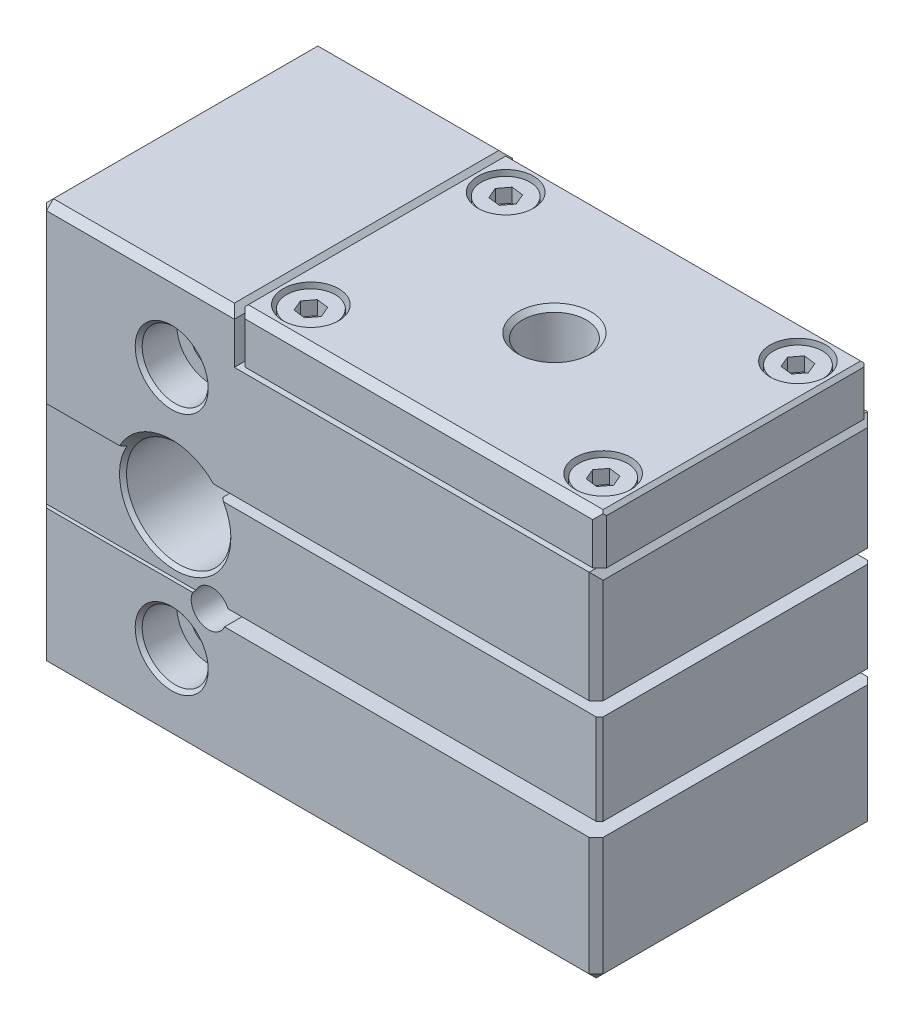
ISO-10303-21;
HEADER;
FILE_DESCRIPTION(('STEP AP214'),'2;1');
FILE_NAME('part.step','',(''),(''),'','','');
FILE_SCHEMA(('AUTOMOTIVE_DESIGN { 1 0 10303 214 1 1 1 1 }'));
ENDSEC;
DATA;
#1=APPLICATION_CONTEXT('core data for automotive mechanical design processes');
#2=APPLICATION_PROTOCOL_DEFINITION('international standard','automotive_design',2000,#1);
#3=PRODUCT_CONTEXT('',#1,'mechanical');
#4=PRODUCT('Part','Part','',(#3));
#5=PRODUCT_RELATED_PRODUCT_CATEGORY('part','',(#4));
#6=PRODUCT_DEFINITION_FORMATION('','',#4);
#7=PRODUCT_DEFINITION_CONTEXT('part definition',#1,'design');
#8=PRODUCT_DEFINITION('design','',#6,#7);
#9=PRODUCT_DEFINITION_SHAPE('','',#8);
#10=(LENGTH_UNIT() NAMED_UNIT(*) SI_UNIT(.MILLI.,.METRE.));
#11=(NAMED_UNIT(*) PLANE_ANGLE_UNIT() SI_UNIT($,.RADIAN.));
#12=(NAMED_UNIT(*) SI_UNIT($,.STERADIAN.) SOLID_ANGLE_UNIT());
#13=UNCERTAINTY_MEASURE_WITH_UNIT(LENGTH_MEASURE(1.E-05),#10,'distance_accuracy_value','');
#14=(GEOMETRIC_REPRESENTATION_CONTEXT(3) GLOBAL_UNCERTAINTY_ASSIGNED_CONTEXT((#13)) GLOBAL_UNIT_ASSIGNED_CONTEXT((#10,
#11,#12)) REPRESENTATION_CONTEXT('',''));
#15=CARTESIAN_POINT('',(0.,0.,0.));
#16=DIRECTION('',(0.,0.,1.));
#17=DIRECTION('',(1.,0.,0.));
#18=AXIS2_PLACEMENT_3D('',#15,#16,#17);
#19=CARTESIAN_POINT('',(35.,21.,20.));
#20=DIRECTION('',(0.,-1.,0.));
#21=DIRECTION('',(-0.717168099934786,0.,-0.696900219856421));
#22=AXIS2_PLACEMENT_3D('',#19,#20,#21);
#23=CYLINDRICAL_SURFACE('',#22,2.5);
#24=CARTESIAN_POINT('',(35.,21.5,20.));
#25=DIRECTION('',(0.,1.,0.));
#26=DIRECTION('',(0.,0.,-1.));
#27=AXIS2_PLACEMENT_3D('',#24,#25,#26);
#28=CIRCLE('',#27,2.5);
#29=CARTESIAN_POINT('',(35.,21.5,17.5));
#30=VERTEX_POINT('',#29);
#31=EDGE_CURVE('E1424',#30,#30,#28,.F.);
#32=ORIENTED_EDGE('',*,*,#31,.F.);
#33=EDGE_LOOP('',(#32));
#34=FACE_BOUND('',#33,.T.);
#35=CARTESIAN_POINT('',(35.,23.5,20.));
#36=DIRECTION('',(0.,1.,0.));
#37=DIRECTION('',(0.,0.,1.));
#38=AXIS2_PLACEMENT_3D('',#35,#36,#37);
#39=CIRCLE('',#38,2.5);
#40=CARTESIAN_POINT('',(35.,23.5,22.5));
#41=VERTEX_POINT('',#40);
#42=EDGE_CURVE('E358',#41,#41,#39,.T.);
#43=ORIENTED_EDGE('',*,*,#42,.F.);
#44=EDGE_LOOP('',(#43));
#45=FACE_BOUND('',#44,.T.);
#46=ADVANCED_FACE('F14',(#34,#45),#23,.T.);
#47=CARTESIAN_POINT('',(35.,-9.,20.));
#48=DIRECTION('',(0.,-1.,0.));
#49=DIRECTION('',(0.,0.,1.));
#50=AXIS2_PLACEMENT_3D('',#47,#48,#49);
#51=CONICAL_SURFACE('',#50,9.25,0.78539816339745);
#52=CARTESIAN_POINT('',(35.,-11.5,20.));
#53=DIRECTION('',(0.,1.,0.));
#54=DIRECTION('',(0.,0.,-1.));
#55=AXIS2_PLACEMENT_3D('',#52,#53,#54);
#56=CIRCLE('',#55,11.75);
#57=CARTESIAN_POINT('',(35.,-11.5,8.25));
#58=VERTEX_POINT('',#57);
#59=EDGE_CURVE('E744',#58,#58,#56,.T.);
#60=ORIENTED_EDGE('',*,*,#59,.F.);
#61=EDGE_LOOP('',(#60));
#62=FACE_BOUND('',#61,.T.);
#63=CARTESIAN_POINT('',(35.,-11.25,20.));
#64=DIRECTION('',(0.,-1.,0.));
#65=DIRECTION('',(0.,0.,1.));
#66=AXIS2_PLACEMENT_3D('',#63,#64,#65);
#67=CIRCLE('',#66,11.5);
#68=CARTESIAN_POINT('',(35.,-11.25,31.5));
#69=VERTEX_POINT('',#68);
#70=EDGE_CURVE('E1427',#69,#69,#67,.F.);
#71=ORIENTED_EDGE('',*,*,#70,.T.);
#72=EDGE_LOOP('',(#71));
#73=FACE_BOUND('',#72,.T.);
#74=ADVANCED_FACE('F976',(#62,#73),#51,.F.);
#75=CARTESIAN_POINT('',(61.,-11.5,40.));
#76=DIRECTION('',(0.,1.,0.));
#77=DIRECTION('',(0.,0.,-1.));
#78=AXIS2_PLACEMENT_3D('',#75,#76,#77);
#79=PLANE('',#78);
#80=ORIENTED_EDGE('',*,*,#59,.T.);
#81=EDGE_LOOP('',(#80));
#82=FACE_BOUND('',#81,.T.);
#83=DIRECTION('',(0.,0.,-1.));
#84=VECTOR('',#83,1.);
#85=CARTESIAN_POINT('',(-18.,-11.5,40.));
#86=LINE('',#85,#84);
#87=CARTESIAN_POINT('',(-18.,-11.5,39.));
#88=VERTEX_POINT('',#87);
#89=CARTESIAN_POINT('',(-18.,-11.5,1.));
#90=VERTEX_POINT('',#89);
#91=EDGE_CURVE('E725',#88,#90,#86,.T.);
#92=ORIENTED_EDGE('',*,*,#91,.T.);
#93=DIRECTION('',(1.,0.,0.));
#94=VECTOR('',#93,1.);
#95=CARTESIAN_POINT('',(61.,-11.5,1.));
#96=LINE('',#95,#94);
#97=CARTESIAN_POINT('',(60.,-11.5,1.));
#98=VERTEX_POINT('',#97);
#99=EDGE_CURVE('E730',#90,#98,#96,.T.);
#100=ORIENTED_EDGE('',*,*,#99,.T.);
#101=DIRECTION('',(0.,0.,1.));
#102=VECTOR('',#101,1.);
#103=CARTESIAN_POINT('',(60.,-11.5,40.));
#104=LINE('',#103,#102);
#105=CARTESIAN_POINT('',(60.,-11.5,39.));
#106=VERTEX_POINT('',#105);
#107=EDGE_CURVE('E715',#98,#106,#104,.T.);
#108=ORIENTED_EDGE('',*,*,#107,.T.);
#109=DIRECTION('',(-1.,0.,0.));
#110=VECTOR('',#109,1.);
#111=CARTESIAN_POINT('',(61.,-11.5,39.));
#112=LINE('',#111,#110);
#113=EDGE_CURVE('E718',#106,#88,#112,.T.);
#114=ORIENTED_EDGE('',*,*,#113,.T.);
#115=EDGE_LOOP('',(#92,#100,#108,#114));
#116=FACE_BOUND('',#115,.T.);
#117=ADVANCED_FACE('F982',(#82,#116),#79,.F.);
#118=CARTESIAN_POINT('',(-18.,-11.5,40.));
#119=DIRECTION('',(0.707106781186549,0.707106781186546,0.));
#120=DIRECTION('',(-0.707106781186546,0.707106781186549,0.));
#121=AXIS2_PLACEMENT_3D('',#118,#119,#120);
#122=PLANE('',#121);
#123=DIRECTION('',(-0.707106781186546,0.707106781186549,0.));
#124=VECTOR('',#123,1.);
#125=CARTESIAN_POINT('',(-18.5,-11.,39.));
#126=LINE('',#125,#124);
#127=CARTESIAN_POINT('',(-19.,-10.5,39.));
#128=VERTEX_POINT('',#127);
#129=EDGE_CURVE('E783',#88,#128,#126,.T.);
#130=ORIENTED_EDGE('',*,*,#129,.T.);
#131=DIRECTION('',(0.,0.,1.));
#132=VECTOR('',#131,1.);
#133=CARTESIAN_POINT('',(-19.,-10.5,40.));
#134=LINE('',#133,#132);
#135=CARTESIAN_POINT('',(-19.,-10.5,1.));
#136=VERTEX_POINT('',#135);
#137=EDGE_CURVE('E732',#136,#128,#134,.T.);
#138=ORIENTED_EDGE('',*,*,#137,.F.);
#139=DIRECTION('',(0.707106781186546,-0.707106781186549,0.));
#140=VECTOR('',#139,1.);
#141=CARTESIAN_POINT('',(-18.5,-11.,1.));
#142=LINE('',#141,#140);
#143=EDGE_CURVE('E774',#90,#136,#142,.F.);
#144=ORIENTED_EDGE('',*,*,#143,.F.);
#145=ORIENTED_EDGE('',*,*,#91,.F.);
#146=EDGE_LOOP('',(#130,#138,#144,#145));
#147=FACE_BOUND('',#146,.T.);
#148=ADVANCED_FACE('F1966',(#147),#122,.F.);
#149=CARTESIAN_POINT('',(61.,-11.5,1.));
#150=DIRECTION('',(0.,-0.707106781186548,-0.707106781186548));
#151=DIRECTION('',(0.,-0.707106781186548,0.707106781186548));
#152=AXIS2_PLACEMENT_3D('',#149,#150,#151);
#153=PLANE('',#152);
#154=DIRECTION('',(0.,-0.707106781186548,0.707106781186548));
#155=VECTOR('',#154,1.);
#156=CARTESIAN_POINT('',(-18.,-10.5,0.));
#157=LINE('',#156,#155);
#158=CARTESIAN_POINT('',(-18.,-10.5,0.));
#159=VERTEX_POINT('',#158);
#160=EDGE_CURVE('E765',#90,#159,#157,.F.);
#161=ORIENTED_EDGE('',*,*,#160,.T.);
#162=DIRECTION('',(-1.,0.,0.));
#163=VECTOR('',#162,1.);
#164=CARTESIAN_POINT('',(-19.,-10.5,0.));
#165=LINE('',#164,#163);
#166=CARTESIAN_POINT('',(60.,-10.5,0.));
#167=VERTEX_POINT('',#166);
#168=EDGE_CURVE('E1619',#167,#159,#165,.T.);
#169=ORIENTED_EDGE('',*,*,#168,.F.);
#170=DIRECTION('',(0.,0.707106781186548,-0.707106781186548));
#171=VECTOR('',#170,1.);
#172=CARTESIAN_POINT('',(60.,-10.5,0.));
#173=LINE('',#172,#171);
#174=EDGE_CURVE('E759',#98,#167,#173,.T.);
#175=ORIENTED_EDGE('',*,*,#174,.F.);
#176=ORIENTED_EDGE('',*,*,#99,.F.);
#177=EDGE_LOOP('',(#161,#169,#175,#176));
#178=FACE_BOUND('',#177,.T.);
#179=ADVANCED_FACE('F1958',(#178),#153,.T.);
#180=CARTESIAN_POINT('',(61.,-10.5,40.));
#181=DIRECTION('',(-0.707106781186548,0.707106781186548,0.));
#182=DIRECTION('',(-0.707106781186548,-0.707106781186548,0.));
#183=AXIS2_PLACEMENT_3D('',#180,#181,#182);
#184=PLANE('',#183);
#185=DIRECTION('',(-0.707106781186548,-0.707106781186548,0.));
#186=VECTOR('',#185,1.);
#187=CARTESIAN_POINT('',(61.,-10.5,39.));
#188=LINE('',#187,#186);
#189=CARTESIAN_POINT('',(61.,-10.5,39.));
#190=VERTEX_POINT('',#189);
#191=EDGE_CURVE('E762',#190,#106,#188,.T.);
#192=ORIENTED_EDGE('',*,*,#191,.T.);
#193=ORIENTED_EDGE('',*,*,#107,.F.);
#194=DIRECTION('',(0.707106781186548,0.707106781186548,0.));
#195=VECTOR('',#194,1.);
#196=CARTESIAN_POINT('',(60.5,-11.,1.));
#197=LINE('',#196,#195);
#198=CARTESIAN_POINT('',(61.,-10.5,1.));
#199=VERTEX_POINT('',#198);
#200=EDGE_CURVE('E755',#199,#98,#197,.F.);
#201=ORIENTED_EDGE('',*,*,#200,.F.);
#202=DIRECTION('',(0.,0.,-1.));
#203=VECTOR('',#202,1.);
#204=CARTESIAN_POINT('',(61.,-10.5,40.));
#205=LINE('',#204,#203);
#206=EDGE_CURVE('E1665',#190,#199,#205,.T.);
#207=ORIENTED_EDGE('',*,*,#206,.F.);
#208=EDGE_LOOP('',(#192,#193,#201,#207));
#209=FACE_BOUND('',#208,.T.);
#210=ADVANCED_FACE('F1960',(#209),#184,.F.);
#211=CARTESIAN_POINT('',(-19.,-10.5,40.));
#212=DIRECTION('',(0.,0.707106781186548,-0.707106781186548));
#213=DIRECTION('',(0.,-0.707106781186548,-0.707106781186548));
#214=AXIS2_PLACEMENT_3D('',#211,#212,#213);
#215=PLANE('',#214);
#216=DIRECTION('',(0.,-0.707106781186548,-0.707106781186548));
#217=VECTOR('',#216,1.);
#218=CARTESIAN_POINT('',(-18.,-10.5,40.));
#219=LINE('',#218,#217);
#220=CARTESIAN_POINT('',(-18.,-10.5,40.));
#221=VERTEX_POINT('',#220);
#222=EDGE_CURVE('E780',#221,#88,#219,.T.);
#223=ORIENTED_EDGE('',*,*,#222,.T.);
#224=ORIENTED_EDGE('',*,*,#113,.F.);
#225=DIRECTION('',(0.,0.707106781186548,0.707106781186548));
#226=VECTOR('',#225,1.);
#227=CARTESIAN_POINT('',(60.,-11.,39.5));
#228=LINE('',#227,#226);
#229=CARTESIAN_POINT('',(60.,-10.5,40.));
#230=VERTEX_POINT('',#229);
#231=EDGE_CURVE('E771',#230,#106,#228,.F.);
#232=ORIENTED_EDGE('',*,*,#231,.F.);
#233=DIRECTION('',(1.,0.,0.));
#234=VECTOR('',#233,1.);
#235=CARTESIAN_POINT('',(-19.,-10.5,40.));
#236=LINE('',#235,#234);
#237=EDGE_CURVE('E1635',#221,#230,#236,.T.);
#238=ORIENTED_EDGE('',*,*,#237,.F.);
#239=EDGE_LOOP('',(#223,#224,#232,#238));
#240=FACE_BOUND('',#239,.T.);
#241=ADVANCED_FACE('F2072',(#240),#215,.F.);
#242=CARTESIAN_POINT('',(-18.,-10.5,40.));
#243=DIRECTION('',(-0.577350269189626,-0.577350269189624,0.577350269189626));
#244=DIRECTION('',(0.707106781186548,0.,0.707106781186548));
#245=AXIS2_PLACEMENT_3D('',#242,#243,#244);
#246=PLANE('',#245);
#247=ORIENTED_EDGE('',*,*,#222,.F.);
#248=DIRECTION('',(0.707106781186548,0.,0.707106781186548));
#249=VECTOR('',#248,1.);
#250=CARTESIAN_POINT('',(-18.,-10.5,40.));
#251=LINE('',#250,#249);
#252=EDGE_CURVE('E789',#221,#128,#251,.F.);
#253=ORIENTED_EDGE('',*,*,#252,.T.);
#254=ORIENTED_EDGE('',*,*,#129,.F.);
#255=EDGE_LOOP('',(#247,#253,#254));
#256=FACE_BOUND('',#255,.T.);
#257=ADVANCED_FACE('F2085',(#256),#246,.T.);
#258=CARTESIAN_POINT('',(-19.,-11.5,40.));
#259=DIRECTION('',(1.,0.,0.));
#260=DIRECTION('',(0.,0.,-1.));
#261=AXIS2_PLACEMENT_3D('',#258,#259,#260);
#262=PLANE('',#261);
#263=DIRECTION('',(0.,0.,-1.));
#264=VECTOR('',#263,1.);
#265=CARTESIAN_POINT('',(-19.,45.5,40.));
#266=LINE('',#265,#264);
#267=CARTESIAN_POINT('',(-19.,45.5,39.));
#268=VERTEX_POINT('',#267);
#269=CARTESIAN_POINT('',(-19.,45.5,1.));
#270=VERTEX_POINT('',#269);
#271=EDGE_CURVE('E738',#268,#270,#266,.T.);
#272=ORIENTED_EDGE('',*,*,#271,.T.);
#273=DIRECTION('',(0.,-1.,0.));
#274=VECTOR('',#273,1.);
#275=CARTESIAN_POINT('',(-19.,-11.5,1.));
#276=LINE('',#275,#274);
#277=EDGE_CURVE('E741',#270,#136,#276,.T.);
#278=ORIENTED_EDGE('',*,*,#277,.T.);
#279=ORIENTED_EDGE('',*,*,#137,.T.);
#280=DIRECTION('',(0.,1.,0.));
#281=VECTOR('',#280,1.);
#282=CARTESIAN_POINT('',(-19.,-11.5,39.));
#283=LINE('',#282,#281);
#284=EDGE_CURVE('E735',#128,#268,#283,.T.);
#285=ORIENTED_EDGE('',*,*,#284,.T.);
#286=EDGE_LOOP('',(#272,#278,#279,#285));
#287=FACE_BOUND('',#286,.T.);
#288=ADVANCED_FACE('F2080',(#287),#262,.F.);
#289=CARTESIAN_POINT('',(-18.,-10.5,0.));
#290=DIRECTION('',(-0.577350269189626,-0.577350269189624,-0.577350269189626));
#291=DIRECTION('',(-0.707106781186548,0.,0.707106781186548));
#292=AXIS2_PLACEMENT_3D('',#289,#290,#291);
#293=PLANE('',#292);
#294=ORIENTED_EDGE('',*,*,#143,.T.);
#295=DIRECTION('',(0.707106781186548,0.,-0.707106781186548));
#296=VECTOR('',#295,1.);
#297=CARTESIAN_POINT('',(-18.,-10.5,0.));
#298=LINE('',#297,#296);
#299=EDGE_CURVE('E777',#136,#159,#298,.T.);
#300=ORIENTED_EDGE('',*,*,#299,.T.);
#301=ORIENTED_EDGE('',*,*,#160,.F.);
#302=EDGE_LOOP('',(#294,#300,#301));
#303=FACE_BOUND('',#302,.T.);
#304=ADVANCED_FACE('F1969',(#303),#293,.T.);
#305=CARTESIAN_POINT('',(8.,46.5,40.));
#306=DIRECTION('',(-0.707106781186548,-0.707106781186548,0.));
#307=DIRECTION('',(0.707106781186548,-0.707106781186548,0.));
#308=AXIS2_PLACEMENT_3D('',#305,#306,#307);
#309=PLANE('',#308);
#310=DIRECTION('',(-0.577350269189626,0.577350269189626,-0.577350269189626));
#311=VECTOR('',#310,1.);
#312=CARTESIAN_POINT('',(-0.333333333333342,54.8333333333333,30.6666666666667));
#313=LINE('',#312,#311);
#314=CARTESIAN_POINT('',(8.,46.5,39.));
#315=VERTEX_POINT('',#314);
#316=CARTESIAN_POINT('',(9.,45.5,40.));
#317=VERTEX_POINT('',#316);
#318=EDGE_CURVE('E705',#315,#317,#313,.F.);
#319=ORIENTED_EDGE('',*,*,#318,.T.);
#320=DIRECTION('',(0.,0.,1.));
#321=VECTOR('',#320,1.);
#322=CARTESIAN_POINT('',(9.,45.5,40.));
#323=LINE('',#322,#321);
#324=CARTESIAN_POINT('',(9.,45.5,38.5));
#325=VERTEX_POINT('',#324);
#326=EDGE_CURVE('E699',#325,#317,#323,.T.);
#327=ORIENTED_EDGE('',*,*,#326,.F.);
#328=CARTESIAN_POINT('',(9.,45.5,1.5));
#329=VERTEX_POINT('',#328);
#330=EDGE_CURVE('E694',#329,#325,#323,.T.);
#331=ORIENTED_EDGE('',*,*,#330,.F.);
#332=CARTESIAN_POINT('',(9.,45.5,0.));
#333=VERTEX_POINT('',#332);
#334=EDGE_CURVE('E710',#333,#329,#323,.T.);
#335=ORIENTED_EDGE('',*,*,#334,.F.);
#336=DIRECTION('',(0.577350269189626,-0.577350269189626,-0.577350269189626));
#337=VECTOR('',#336,1.);
#338=CARTESIAN_POINT('',(-5.,59.5,14.));
#339=LINE('',#338,#337);
#340=CARTESIAN_POINT('',(8.,46.5,1.));
#341=VERTEX_POINT('',#340);
#342=EDGE_CURVE('E804',#341,#333,#339,.T.);
#343=ORIENTED_EDGE('',*,*,#342,.F.);
#344=DIRECTION('',(0.,0.,-1.));
#345=VECTOR('',#344,1.);
#346=CARTESIAN_POINT('',(8.,46.5,40.));
#347=LINE('',#346,#345);
#348=EDGE_CURVE('E712',#315,#341,#347,.T.);
#349=ORIENTED_EDGE('',*,*,#348,.F.);
#350=EDGE_LOOP('',(#319,#327,#331,#335,#343,#349));
#351=FACE_BOUND('',#350,.T.);
#352=ADVANCED_FACE('F700',(#351),#309,.F.);
#353=CARTESIAN_POINT('',(-19.,45.5,40.));
#354=DIRECTION('',(0.,-0.707106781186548,-0.707106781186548));
#355=DIRECTION('',(0.,-0.707106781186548,0.707106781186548));
#356=AXIS2_PLACEMENT_3D('',#353,#354,#355);
#357=PLANE('',#356);
#358=DIRECTION('',(0.,-0.707106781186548,0.707106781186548));
#359=VECTOR('',#358,1.);
#360=CARTESIAN_POINT('',(-18.,45.5,40.));
#361=LINE('',#360,#359);
#362=CARTESIAN_POINT('',(-18.,45.5,40.));
#363=VERTEX_POINT('',#362);
#364=CARTESIAN_POINT('',(-18.,46.5,39.));
#365=VERTEX_POINT('',#364);
#366=EDGE_CURVE('E807',#363,#365,#361,.F.);
#367=ORIENTED_EDGE('',*,*,#366,.F.);
#368=DIRECTION('',(-1.,0.,0.));
#369=VECTOR('',#368,1.);
#370=CARTESIAN_POINT('',(-19.,45.5,40.));
#371=LINE('',#370,#369);
#372=EDGE_CURVE('E1640',#317,#363,#371,.T.);
#373=ORIENTED_EDGE('',*,*,#372,.F.);
#374=ORIENTED_EDGE('',*,*,#318,.F.);
#375=DIRECTION('',(1.,0.,0.));
#376=VECTOR('',#375,1.);
#377=CARTESIAN_POINT('',(9.,46.5,39.));
#378=LINE('',#377,#376);
#379=EDGE_CURVE('E1683',#365,#315,#378,.T.);
#380=ORIENTED_EDGE('',*,*,#379,.F.);
#381=EDGE_LOOP('',(#367,#373,#374,#380));
#382=FACE_BOUND('',#381,.T.);
#383=ADVANCED_FACE('F1718',(#382),#357,.F.);
#384=CARTESIAN_POINT('',(9.,46.5,40.));
#385=DIRECTION('',(-1.,0.,0.));
#386=DIRECTION('',(0.,-1.,0.));
#387=AXIS2_PLACEMENT_3D('',#384,#385,#386);
#388=PLANE('',#387);
#389=DIRECTION('',(0.,0.,-1.));
#390=VECTOR('',#389,1.);
#391=CARTESIAN_POINT('',(9.,39.8,40.));
#392=LINE('',#391,#390);
#393=CARTESIAN_POINT('',(9.,39.8,38.5));
#394=VERTEX_POINT('',#393);
#395=CARTESIAN_POINT('',(9.,39.8,1.5));
#396=VERTEX_POINT('',#395);
#397=EDGE_CURVE('E685',#394,#396,#392,.T.);
#398=ORIENTED_EDGE('',*,*,#397,.F.);
#399=DIRECTION('',(0.,1.,0.));
#400=VECTOR('',#399,1.);
#401=CARTESIAN_POINT('',(9.,46.8,38.5));
#402=LINE('',#401,#400);
#403=EDGE_CURVE('E362',#394,#325,#402,.T.);
#404=ORIENTED_EDGE('',*,*,#403,.T.);
#405=ORIENTED_EDGE('',*,*,#326,.T.);
#406=DIRECTION('',(0.,1.,0.));
#407=VECTOR('',#406,1.);
#408=CARTESIAN_POINT('',(9.,46.5,40.));
#409=LINE('',#408,#407);
#410=CARTESIAN_POINT('',(9.,39.5,40.));
#411=VERTEX_POINT('',#410);
#412=EDGE_CURVE('E1591',#411,#317,#409,.T.);
#413=ORIENTED_EDGE('',*,*,#412,.F.);
#414=DIRECTION('',(0.,0.,-1.));
#415=VECTOR('',#414,1.);
#416=CARTESIAN_POINT('',(9.,39.5,40.));
#417=LINE('',#416,#415);
#418=CARTESIAN_POINT('',(9.,39.5,0.));
#419=VERTEX_POINT('',#418);
#420=EDGE_CURVE('E1594',#411,#419,#417,.T.);
#421=ORIENTED_EDGE('',*,*,#420,.T.);
#422=DIRECTION('',(0.,1.,0.));
#423=VECTOR('',#422,1.);
#424=CARTESIAN_POINT('',(9.,46.5,0.));
#425=LINE('',#424,#423);
#426=EDGE_CURVE('E1592',#419,#333,#425,.T.);
#427=ORIENTED_EDGE('',*,*,#426,.T.);
#428=ORIENTED_EDGE('',*,*,#334,.T.);
#429=DIRECTION('',(0.,-1.,0.));
#430=VECTOR('',#429,1.);
#431=CARTESIAN_POINT('',(9.,46.8,1.5));
#432=LINE('',#431,#430);
#433=EDGE_CURVE('E31',#329,#396,#432,.T.);
#434=ORIENTED_EDGE('',*,*,#433,.T.);
#435=EDGE_LOOP('',(#398,#404,#405,#413,#421,#427,#428,#434));
#436=FACE_BOUND('',#435,.T.);
#437=ADVANCED_FACE('F2049',(#436),#388,.F.);
#438=CARTESIAN_POINT('',(9.,46.5,1.));
#439=DIRECTION('',(0.,0.707106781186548,-0.707106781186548));
#440=DIRECTION('',(0.,-0.707106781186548,-0.707106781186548));
#441=AXIS2_PLACEMENT_3D('',#438,#439,#440);
#442=PLANE('',#441);
#443=ORIENTED_EDGE('',*,*,#342,.T.);
#444=DIRECTION('',(1.,0.,0.));
#445=VECTOR('',#444,1.);
#446=CARTESIAN_POINT('',(9.,45.5,0.));
#447=LINE('',#446,#445);
#448=CARTESIAN_POINT('',(-18.,45.5,0.));
#449=VERTEX_POINT('',#448);
#450=EDGE_CURVE('E1622',#449,#333,#447,.T.);
#451=ORIENTED_EDGE('',*,*,#450,.F.);
#452=DIRECTION('',(0.,-0.707106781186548,-0.707106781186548));
#453=VECTOR('',#452,1.);
#454=CARTESIAN_POINT('',(-18.,46.5,1.));
#455=LINE('',#454,#453);
#456=CARTESIAN_POINT('',(-18.,46.5,1.));
#457=VERTEX_POINT('',#456);
#458=EDGE_CURVE('E795',#457,#449,#455,.T.);
#459=ORIENTED_EDGE('',*,*,#458,.F.);
#460=DIRECTION('',(-1.,0.,0.));
#461=VECTOR('',#460,1.);
#462=CARTESIAN_POINT('',(-19.,46.5,1.));
#463=LINE('',#462,#461);
#464=EDGE_CURVE('E708',#341,#457,#463,.T.);
#465=ORIENTED_EDGE('',*,*,#464,.F.);
#466=EDGE_LOOP('',(#443,#451,#459,#465));
#467=FACE_BOUND('',#466,.T.);
#468=ADVANCED_FACE('F1701',(#467),#442,.T.);
#469=CARTESIAN_POINT('',(9.,46.5,40.));
#470=DIRECTION('',(0.,-1.,0.));
#471=DIRECTION('',(0.,0.,1.));
#472=AXIS2_PLACEMENT_3D('',#469,#470,#471);
#473=PLANE('',#472);
#474=ORIENTED_EDGE('',*,*,#348,.T.);
#475=ORIENTED_EDGE('',*,*,#464,.T.);
#476=DIRECTION('',(0.,0.,1.));
#477=VECTOR('',#476,1.);
#478=CARTESIAN_POINT('',(-18.,46.5,40.));
#479=LINE('',#478,#477);
#480=EDGE_CURVE('E1680',#457,#365,#479,.T.);
#481=ORIENTED_EDGE('',*,*,#480,.T.);
#482=ORIENTED_EDGE('',*,*,#379,.T.);
#483=EDGE_LOOP('',(#474,#475,#481,#482));
#484=FACE_BOUND('',#483,.T.);
#485=ADVANCED_FACE('F1690',(#484),#473,.F.);
#486=CARTESIAN_POINT('',(-19.,-11.5,40.));
#487=DIRECTION('',(0.,0.,-1.));
#488=DIRECTION('',(0.,-1.,0.));
#489=AXIS2_PLACEMENT_3D('',#486,#487,#488);
#490=PLANE('',#489);
#491=CARTESIAN_POINT('',(0.,35.,40.));
#492=DIRECTION('',(0.,0.,-1.));
#493=DIRECTION('',(0.,-1.,0.));
#494=AXIS2_PLACEMENT_3D('',#491,#492,#493);
#495=CIRCLE('',#494,5.25);
#496=CARTESIAN_POINT('',(0.,29.75,40.));
#497=VERTEX_POINT('',#496);
#498=EDGE_CURVE('E1478',#497,#497,#495,.T.);
#499=ORIENTED_EDGE('',*,*,#498,.T.);
#500=EDGE_LOOP('',(#499));
#501=FACE_BOUND('',#500,.T.);
#502=DIRECTION('',(1.,0.,0.));
#503=VECTOR('',#502,1.);
#504=CARTESIAN_POINT('',(-19.,21.5,40.));
#505=LINE('',#504,#503);
#506=CARTESIAN_POINT('',(-18.,21.5,40.));
#507=VERTEX_POINT('',#506);
#508=CARTESIAN_POINT('',(-7.5,21.5,40.));
#509=VERTEX_POINT('',#508);
#510=EDGE_CURVE('E1444',#507,#509,#505,.T.);
#511=ORIENTED_EDGE('',*,*,#510,.T.);
#512=CARTESIAN_POINT('',(0.,17.5,40.));
#513=DIRECTION('',(0.,0.,-1.));
#514=DIRECTION('',(0.,-1.,0.));
#515=AXIS2_PLACEMENT_3D('',#512,#513,#514);
#516=CIRCLE('',#515,8.5);
#517=CARTESIAN_POINT('',(6.02079728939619,23.5,40.));
#518=VERTEX_POINT('',#517);
#519=EDGE_CURVE('E1429',#509,#518,#516,.T.);
#520=ORIENTED_EDGE('',*,*,#519,.T.);
#521=DIRECTION('',(-1.,0.,0.));
#522=VECTOR('',#521,1.);
#523=CARTESIAN_POINT('',(0.,23.5,40.));
#524=LINE('',#523,#522);
#525=CARTESIAN_POINT('',(60.,23.5,40.));
#526=VERTEX_POINT('',#525);
#527=EDGE_CURVE('E1552',#526,#518,#524,.T.);
#528=ORIENTED_EDGE('',*,*,#527,.F.);
#529=DIRECTION('',(0.,1.,0.));
#530=VECTOR('',#529,1.);
#531=CARTESIAN_POINT('',(60.,-11.5,40.));
#532=LINE('',#531,#530);
#533=CARTESIAN_POINT('',(60.,39.5,40.));
#534=VERTEX_POINT('',#533);
#535=EDGE_CURVE('E1645',#526,#534,#532,.T.);
#536=ORIENTED_EDGE('',*,*,#535,.T.);
#537=DIRECTION('',(-1.,0.,0.));
#538=VECTOR('',#537,1.);
#539=CARTESIAN_POINT('',(9.,39.5,40.));
#540=LINE('',#539,#538);
#541=EDGE_CURVE('E1588',#534,#411,#540,.T.);
#542=ORIENTED_EDGE('',*,*,#541,.T.);
#543=ORIENTED_EDGE('',*,*,#412,.T.);
#544=ORIENTED_EDGE('',*,*,#372,.T.);
#545=DIRECTION('',(0.,-1.,0.));
#546=VECTOR('',#545,1.);
#547=CARTESIAN_POINT('',(-18.,-11.5,40.));
#548=LINE('',#547,#546);
#549=EDGE_CURVE('E1454',#363,#507,#548,.T.);
#550=ORIENTED_EDGE('',*,*,#549,.T.);
#551=EDGE_LOOP('',(#511,#520,#528,#536,#542,#543,#544,#550));
#552=FACE_BOUND('',#551,.T.);
#553=ADVANCED_FACE('F1451',(#501,#552),#490,.F.);
#554=CARTESIAN_POINT('',(35.,5.38953359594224,20.));
#555=DIRECTION('',(0.,-1.,0.));
#556=DIRECTION('',(0.,0.,1.));
#557=AXIS2_PLACEMENT_3D('',#554,#555,#556);
#558=CYLINDRICAL_SURFACE('',#557,17.5);
#559=CARTESIAN_POINT('',(35.,39.5,20.));
#560=DIRECTION('',(0.,-1.,0.));
#561=DIRECTION('',(0.,0.,1.));
#562=AXIS2_PLACEMENT_3D('',#559,#560,#561);
#563=CIRCLE('',#562,17.5);
#564=CARTESIAN_POINT('',(35.,39.5,37.5));
#565=VERTEX_POINT('',#564);
#566=EDGE_CURVE('E1584',#565,#565,#563,.T.);
#567=ORIENTED_EDGE('',*,*,#566,.F.);
#568=EDGE_LOOP('',(#567));
#569=FACE_BOUND('',#568,.T.);
#570=CARTESIAN_POINT('',(35.,39.,20.));
#571=DIRECTION('',(0.,-1.,0.));
#572=DIRECTION('',(0.,0.,1.));
#573=AXIS2_PLACEMENT_3D('',#570,#571,#572);
#574=CIRCLE('',#573,17.5);
#575=CARTESIAN_POINT('',(35.,39.,37.5));
#576=VERTEX_POINT('',#575);
#577=EDGE_CURVE('E1421',#576,#576,#574,.T.);
#578=ORIENTED_EDGE('',*,*,#577,.T.);
#579=EDGE_LOOP('',(#578));
#580=FACE_BOUND('',#579,.T.);
#581=ADVANCED_FACE('F2031',(#569,#580),#558,.F.);
#582=CARTESIAN_POINT('',(9.,39.5,40.));
#583=DIRECTION('',(0.,-1.,0.));
#584=DIRECTION('',(0.,0.,1.));
#585=AXIS2_PLACEMENT_3D('',#582,#583,#584);
#586=PLANE('',#585);
#587=ORIENTED_EDGE('',*,*,#541,.F.);
#588=DIRECTION('',(0.,0.,-1.));
#589=VECTOR('',#588,1.);
#590=CARTESIAN_POINT('',(60.,39.5,40.));
#591=LINE('',#590,#589);
#592=CARTESIAN_POINT('',(60.,39.5,0.));
#593=VERTEX_POINT('',#592);
#594=EDGE_CURVE('E1662',#534,#593,#591,.T.);
#595=ORIENTED_EDGE('',*,*,#594,.T.);
#596=DIRECTION('',(-1.,0.,0.));
#597=VECTOR('',#596,1.);
#598=CARTESIAN_POINT('',(9.,39.5,0.));
#599=LINE('',#598,#597);
#600=EDGE_CURVE('E1587',#593,#419,#599,.T.);
#601=ORIENTED_EDGE('',*,*,#600,.T.);
#602=ORIENTED_EDGE('',*,*,#420,.F.);
#603=EDGE_LOOP('',(#587,#595,#601,#602));
#604=FACE_BOUND('',#603,.T.);
#605=ORIENTED_EDGE('',*,*,#566,.T.);
#606=EDGE_LOOP('',(#605));
#607=FACE_BOUND('',#606,.T.);
#608=CARTESIAN_POINT('',(14.,39.5,6.));
#609=DIRECTION('',(0.,1.,0.));
#610=DIRECTION('',(0.,0.,1.));
#611=AXIS2_PLACEMENT_3D('',#608,#609,#610);
#612=CIRCLE('',#611,2.);
#613=CARTESIAN_POINT('',(14.,39.5,8.));
#614=VERTEX_POINT('',#613);
#615=EDGE_CURVE('E361',#614,#614,#612,.F.);
#616=ORIENTED_EDGE('',*,*,#615,.T.);
#617=EDGE_LOOP('',(#616));
#618=FACE_BOUND('',#617,.T.);
#619=CARTESIAN_POINT('',(56.,39.5,6.00000000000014));
#620=DIRECTION('',(0.,1.,0.));
#621=DIRECTION('',(0.,0.,1.));
#622=AXIS2_PLACEMENT_3D('',#619,#620,#621);
#623=CIRCLE('',#622,2.);
#624=CARTESIAN_POINT('',(56.,39.5,8.00000000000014));
#625=VERTEX_POINT('',#624);
#626=EDGE_CURVE('E365',#625,#625,#623,.F.);
#627=ORIENTED_EDGE('',*,*,#626,.T.);
#628=EDGE_LOOP('',(#627));
#629=FACE_BOUND('',#628,.T.);
#630=CARTESIAN_POINT('',(14.,39.5,34.));
#631=DIRECTION('',(0.,1.,0.));
#632=DIRECTION('',(0.,0.,1.));
#633=AXIS2_PLACEMENT_3D('',#630,#631,#632);
#634=CIRCLE('',#633,2.);
#635=CARTESIAN_POINT('',(14.,39.5,36.));
#636=VERTEX_POINT('',#635);
#637=EDGE_CURVE('E23',#636,#636,#634,.F.);
#638=ORIENTED_EDGE('',*,*,#637,.T.);
#639=EDGE_LOOP('',(#638));
#640=FACE_BOUND('',#639,.T.);
#641=CARTESIAN_POINT('',(56.,39.5,34.));
#642=DIRECTION('',(0.,1.,0.));
#643=DIRECTION('',(0.,0.,1.));
#644=AXIS2_PLACEMENT_3D('',#641,#642,#643);
#645=CIRCLE('',#644,2.);
#646=CARTESIAN_POINT('',(56.,39.5,36.));
#647=VERTEX_POINT('',#646);
#648=EDGE_CURVE('E9',#647,#647,#645,.F.);
#649=ORIENTED_EDGE('',*,*,#648,.T.);
#650=EDGE_LOOP('',(#649));
#651=FACE_BOUND('',#650,.T.);
#652=ADVANCED_FACE('F370',(#604,#607,#618,#629,#640,#651),#586,.F.);
#653=CARTESIAN_POINT('',(-19.,-11.5,0.));
#654=DIRECTION('',(0.,0.,-1.));
#655=DIRECTION('',(0.,-1.,0.));
#656=AXIS2_PLACEMENT_3D('',#653,#654,#655);
#657=PLANE('',#656);
#658=CARTESIAN_POINT('',(0.,35.,0.));
#659=DIRECTION('',(0.,0.,-1.));
#660=DIRECTION('',(0.,-1.,0.));
#661=AXIS2_PLACEMENT_3D('',#658,#659,#660);
#662=CIRCLE('',#661,5.25);
#663=CARTESIAN_POINT('',(0.,29.75,0.));
#664=VERTEX_POINT('',#663);
#665=EDGE_CURVE('E1490',#664,#664,#662,.F.);
#666=ORIENTED_EDGE('',*,*,#665,.T.);
#667=EDGE_LOOP('',(#666));
#668=FACE_BOUND('',#667,.T.);
#669=DIRECTION('',(-1.,0.,0.));
#670=VECTOR('',#669,1.);
#671=CARTESIAN_POINT('',(0.,23.5,0.));
#672=LINE('',#671,#670);
#673=CARTESIAN_POINT('',(60.,23.5,0.));
#674=VERTEX_POINT('',#673);
#675=CARTESIAN_POINT('',(6.02079728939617,23.5,0.));
#676=VERTEX_POINT('',#675);
#677=EDGE_CURVE('E1543',#674,#676,#672,.T.);
#678=ORIENTED_EDGE('',*,*,#677,.T.);
#679=CARTESIAN_POINT('',(0.,17.5,0.));
#680=DIRECTION('',(0.,0.,-1.));
#681=DIRECTION('',(0.,-1.,0.));
#682=AXIS2_PLACEMENT_3D('',#679,#680,#681);
#683=CIRCLE('',#682,8.5);
#684=CARTESIAN_POINT('',(-7.5,21.5,0.));
#685=VERTEX_POINT('',#684);
#686=EDGE_CURVE('E1470',#676,#685,#683,.F.);
#687=ORIENTED_EDGE('',*,*,#686,.T.);
#688=DIRECTION('',(1.,0.,0.));
#689=VECTOR('',#688,1.);
#690=CARTESIAN_POINT('',(-19.,21.5,0.));
#691=LINE('',#690,#689);
#692=CARTESIAN_POINT('',(-18.,21.5,0.));
#693=VERTEX_POINT('',#692);
#694=EDGE_CURVE('E1876',#693,#685,#691,.T.);
#695=ORIENTED_EDGE('',*,*,#694,.F.);
#696=DIRECTION('',(0.,1.,0.));
#697=VECTOR('',#696,1.);
#698=CARTESIAN_POINT('',(-18.,46.5,0.));
#699=LINE('',#698,#697);
#700=EDGE_CURVE('E1615',#693,#449,#699,.T.);
#701=ORIENTED_EDGE('',*,*,#700,.T.);
#702=ORIENTED_EDGE('',*,*,#450,.T.);
#703=ORIENTED_EDGE('',*,*,#426,.F.);
#704=ORIENTED_EDGE('',*,*,#600,.F.);
#705=DIRECTION('',(0.,-1.,0.));
#706=VECTOR('',#705,1.);
#707=CARTESIAN_POINT('',(60.,23.5,0.));
#708=LINE('',#707,#706);
#709=EDGE_CURVE('E1550',#593,#674,#708,.T.);
#710=ORIENTED_EDGE('',*,*,#709,.T.);
#711=EDGE_LOOP('',(#678,#687,#695,#701,#702,#703,#704,#710));
#712=FACE_BOUND('',#711,.T.);
#713=ADVANCED_FACE('F1547',(#668,#712),#657,.T.);
#714=CARTESIAN_POINT('',(-18.,45.5,40.));
#715=DIRECTION('',(-0.577350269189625,0.577350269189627,0.577350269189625));
#716=DIRECTION('',(0.,0.707106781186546,-0.707106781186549));
#717=AXIS2_PLACEMENT_3D('',#714,#715,#716);
#718=PLANE('',#717);
#719=DIRECTION('',(-0.707106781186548,0.,-0.707106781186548));
#720=VECTOR('',#719,1.);
#721=CARTESIAN_POINT('',(-18.,45.5,40.));
#722=LINE('',#721,#720);
#723=EDGE_CURVE('E798',#363,#268,#722,.T.);
#724=ORIENTED_EDGE('',*,*,#723,.F.);
#725=ORIENTED_EDGE('',*,*,#366,.T.);
#726=DIRECTION('',(0.707106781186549,0.707106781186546,0.));
#727=VECTOR('',#726,1.);
#728=CARTESIAN_POINT('',(-18.5,46.,39.));
#729=LINE('',#728,#727);
#730=EDGE_CURVE('E801',#268,#365,#729,.T.);
#731=ORIENTED_EDGE('',*,*,#730,.F.);
#732=EDGE_LOOP('',(#724,#725,#731));
#733=FACE_BOUND('',#732,.T.);
#734=ADVANCED_FACE('F1723',(#733),#718,.T.);
#735=CARTESIAN_POINT('',(-18.,46.5,1.));
#736=DIRECTION('',(-0.577350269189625,0.577350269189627,-0.577350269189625));
#737=DIRECTION('',(0.,-0.707106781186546,-0.707106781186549));
#738=AXIS2_PLACEMENT_3D('',#735,#736,#737);
#739=PLANE('',#738);
#740=DIRECTION('',(-0.707106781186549,-0.707106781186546,0.));
#741=VECTOR('',#740,1.);
#742=CARTESIAN_POINT('',(-18.,46.5,1.));
#743=LINE('',#742,#741);
#744=EDGE_CURVE('E792',#270,#457,#743,.F.);
#745=ORIENTED_EDGE('',*,*,#744,.T.);
#746=ORIENTED_EDGE('',*,*,#458,.T.);
#747=DIRECTION('',(-0.707106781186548,0.,0.707106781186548));
#748=VECTOR('',#747,1.);
#749=CARTESIAN_POINT('',(-18.5,45.5,0.5));
#750=LINE('',#749,#748);
#751=EDGE_CURVE('E786',#270,#449,#750,.F.);
#752=ORIENTED_EDGE('',*,*,#751,.F.);
#753=EDGE_LOOP('',(#745,#746,#752));
#754=FACE_BOUND('',#753,.T.);
#755=ADVANCED_FACE('F2029',(#754),#739,.T.);
#756=CARTESIAN_POINT('',(-19.,45.5,40.));
#757=DIRECTION('',(0.707106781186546,-0.707106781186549,0.));
#758=DIRECTION('',(0.707106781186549,0.707106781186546,0.));
#759=AXIS2_PLACEMENT_3D('',#756,#757,#758);
#760=PLANE('',#759);
#761=ORIENTED_EDGE('',*,*,#730,.T.);
#762=ORIENTED_EDGE('',*,*,#480,.F.);
#763=ORIENTED_EDGE('',*,*,#744,.F.);
#764=ORIENTED_EDGE('',*,*,#271,.F.);
#765=EDGE_LOOP('',(#761,#762,#763,#764));
#766=FACE_BOUND('',#765,.T.);
#767=ADVANCED_FACE('F1711',(#766),#760,.F.);
#768=CARTESIAN_POINT('',(60.,39.5,40.));
#769=DIRECTION('',(-0.707106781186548,-0.707106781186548,0.));
#770=DIRECTION('',(0.707106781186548,-0.707106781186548,0.));
#771=AXIS2_PLACEMENT_3D('',#768,#769,#770);
#772=PLANE('',#771);
#773=DIRECTION('',(0.577350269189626,-0.577350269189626,-0.577350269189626));
#774=VECTOR('',#773,1.);
#775=CARTESIAN_POINT('',(60.,39.5,40.));
#776=LINE('',#775,#774);
#777=CARTESIAN_POINT('',(61.,38.5,39.));
#778=VERTEX_POINT('',#777);
#779=EDGE_CURVE('E748',#534,#778,#776,.T.);
#780=ORIENTED_EDGE('',*,*,#779,.T.);
#781=DIRECTION('',(0.,0.,1.));
#782=VECTOR('',#781,1.);
#783=CARTESIAN_POINT('',(61.,38.5,40.));
#784=LINE('',#783,#782);
#785=CARTESIAN_POINT('',(61.,38.5,1.));
#786=VERTEX_POINT('',#785);
#787=EDGE_CURVE('E1648',#786,#778,#784,.T.);
#788=ORIENTED_EDGE('',*,*,#787,.F.);
#789=DIRECTION('',(0.577350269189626,-0.577350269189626,0.577350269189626));
#790=VECTOR('',#789,1.);
#791=CARTESIAN_POINT('',(73.3333333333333,26.1666666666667,13.3333333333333));
#792=LINE('',#791,#790);
#793=EDGE_CURVE('E745',#593,#786,#792,.T.);
#794=ORIENTED_EDGE('',*,*,#793,.F.);
#795=ORIENTED_EDGE('',*,*,#594,.F.);
#796=EDGE_LOOP('',(#780,#788,#794,#795));
#797=FACE_BOUND('',#796,.T.);
#798=ADVANCED_FACE('F883',(#797),#772,.F.);
#799=CARTESIAN_POINT('',(0.,35.,39.5));
#800=DIRECTION('',(0.,0.,1.));
#801=DIRECTION('',(0.,1.,0.));
#802=AXIS2_PLACEMENT_3D('',#799,#800,#801);
#803=CONICAL_SURFACE('',#802,4.75,0.78539816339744);
#804=ORIENTED_EDGE('',*,*,#498,.F.);
#805=EDGE_LOOP('',(#804));
#806=FACE_BOUND('',#805,.T.);
#807=CARTESIAN_POINT('',(0.,35.,39.5));
#808=DIRECTION('',(0.,0.,-1.));
#809=DIRECTION('',(0.,-1.,0.));
#810=AXIS2_PLACEMENT_3D('',#807,#808,#809);
#811=CIRCLE('',#810,4.75);
#812=CARTESIAN_POINT('',(0.,30.25,39.5));
#813=VERTEX_POINT('',#812);
#814=EDGE_CURVE('E1485',#813,#813,#811,.F.);
#815=ORIENTED_EDGE('',*,*,#814,.F.);
#816=EDGE_LOOP('',(#815));
#817=FACE_BOUND('',#816,.T.);
#818=ADVANCED_FACE('F880',(#806,#817),#803,.F.);
#819=CARTESIAN_POINT('',(32.4,21.5,20.));
#820=DIRECTION('',(0.,1.,0.));
#821=DIRECTION('',(0.,0.,-1.));
#822=AXIS2_PLACEMENT_3D('',#819,#820,#821);
#823=PLANE('',#822);
#824=DIRECTION('',(-1.,0.,0.));
#825=VECTOR('',#824,1.);
#826=CARTESIAN_POINT('',(61.,21.5,0.5));
#827=LINE('',#826,#825);
#828=CARTESIAN_POINT('',(60.5,21.5,0.5));
#829=VERTEX_POINT('',#828);
#830=CARTESIAN_POINT('',(6.92820323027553,21.5,0.5));
#831=VERTEX_POINT('',#830);
#832=EDGE_CURVE('E1527',#829,#831,#827,.T.);
#833=ORIENTED_EDGE('',*,*,#832,.T.);
#834=CARTESIAN_POINT('',(6.92820323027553,21.5,0.5));
#835=CARTESIAN_POINT('',(6.8313673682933,21.5,0.583897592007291));
#836=CARTESIAN_POINT('',(6.73428991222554,21.5,0.667513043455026));
#837=CARTESIAN_POINT('',(6.53965175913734,21.5,0.834179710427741));
#838=CARTESIAN_POINT('',(6.44209106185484,21.5,0.91723092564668));
#839=CARTESIAN_POINT('',(6.34428877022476,21.5,1.00000000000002));
#840=B_SPLINE_CURVE_WITH_KNOTS('',3,(#834,#835,#836,#837,#838,#839),.UNSPECIFIED.,.F.,.F.,(4,2,
4),(0.,0.384369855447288,0.768739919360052),.UNSPECIFIED.);
#841=CARTESIAN_POINT('',(6.34428877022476,21.5,1.00000000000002));
#842=VERTEX_POINT('',#841);
#843=EDGE_CURVE('E843',#831,#842,#840,.T.);
#844=ORIENTED_EDGE('',*,*,#843,.T.);
#845=DIRECTION('',(0.,0.,-1.));
#846=VECTOR('',#845,1.);
#847=CARTESIAN_POINT('',(6.34428877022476,21.5,40.));
#848=LINE('',#847,#846);
#849=CARTESIAN_POINT('',(6.34428877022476,21.5,39.));
#850=VERTEX_POINT('',#849);
#851=EDGE_CURVE('E1523',#842,#850,#848,.F.);
#852=ORIENTED_EDGE('',*,*,#851,.T.);
#853=CARTESIAN_POINT('',(6.34428877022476,21.5,39.));
#854=CARTESIAN_POINT('',(6.44209106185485,21.5,39.0827690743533));
#855=CARTESIAN_POINT('',(6.53965175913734,21.5,39.1658202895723));
#856=CARTESIAN_POINT('',(6.73428991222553,21.5,39.332486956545));
#857=CARTESIAN_POINT('',(6.83136736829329,21.5,39.4161024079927));
#858=CARTESIAN_POINT('',(6.92820323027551,21.5,39.5));
#859=B_SPLINE_CURVE_WITH_KNOTS('',3,(#853,#854,#855,#856,#857,#858),.UNSPECIFIED.,.F.,.F.,(4,2,
4),(0.,0.384370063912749,0.768739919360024),.UNSPECIFIED.);
#860=CARTESIAN_POINT('',(6.92820323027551,21.5,39.5));
#861=VERTEX_POINT('',#860);
#862=EDGE_CURVE('E834',#850,#861,#859,.T.);
#863=ORIENTED_EDGE('',*,*,#862,.T.);
#864=DIRECTION('',(-1.,0.,0.));
#865=VECTOR('',#864,1.);
#866=CARTESIAN_POINT('',(61.,21.5,39.5));
#867=LINE('',#866,#865);
#868=CARTESIAN_POINT('',(60.5,21.5,39.5));
#869=VERTEX_POINT('',#868);
#870=EDGE_CURVE('E1917',#869,#861,#867,.T.);
#871=ORIENTED_EDGE('',*,*,#870,.F.);
#872=DIRECTION('',(-0.707106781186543,0.,0.707106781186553));
#873=VECTOR('',#872,1.);
#874=CARTESIAN_POINT('',(56.2,21.5,43.8));
#875=LINE('',#874,#873);
#876=CARTESIAN_POINT('',(61.,21.5,39.));
#877=VERTEX_POINT('',#876);
#878=EDGE_CURVE('E1610',#869,#877,#875,.F.);
#879=ORIENTED_EDGE('',*,*,#878,.T.);
#880=DIRECTION('',(0.,0.,1.));
#881=VECTOR('',#880,1.);
#882=CARTESIAN_POINT('',(61.,21.5,0.));
#883=LINE('',#882,#881);
#884=CARTESIAN_POINT('',(61.,21.5,1.));
#885=VERTEX_POINT('',#884);
#886=EDGE_CURVE('E1551',#885,#877,#883,.T.);
#887=ORIENTED_EDGE('',*,*,#886,.F.);
#888=DIRECTION('',(-0.707106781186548,0.,-0.707106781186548));
#889=VECTOR('',#888,1.);
#890=CARTESIAN_POINT('',(56.2,21.5,-3.8));
#891=LINE('',#890,#889);
#892=EDGE_CURVE('E1613',#885,#829,#891,.T.);
#893=ORIENTED_EDGE('',*,*,#892,.T.);
#894=EDGE_LOOP('',(#833,#844,#852,#863,#871,#879,#887,#893));
#895=FACE_BOUND('',#894,.T.);
#896=ORIENTED_EDGE('',*,*,#31,.T.);
#897=EDGE_LOOP('',(#896));
#898=FACE_BOUND('',#897,.T.);
#899=ADVANCED_FACE('F850',(#895,#898),#823,.T.);
#900=CARTESIAN_POINT('',(61.,8.5,0.5));
#901=DIRECTION('',(0.,0.,1.));
#902=DIRECTION('',(0.,1.,0.));
#903=AXIS2_PLACEMENT_3D('',#900,#901,#902);
#904=PLANE('',#903);
#905=CARTESIAN_POINT('',(-6.92820323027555,21.5,0.5));
#906=VERTEX_POINT('',#905);
#907=CARTESIAN_POINT('',(-18.5,21.5,0.5));
#908=VERTEX_POINT('',#907);
#909=EDGE_CURVE('E1860',#906,#908,#827,.T.);
#910=ORIENTED_EDGE('',*,*,#909,.F.);
#911=CARTESIAN_POINT('',(0.,17.5,0.5));
#912=DIRECTION('',(0.,0.,1.));
#913=DIRECTION('',(0.,1.,0.));
#914=AXIS2_PLACEMENT_3D('',#911,#912,#913);
#915=CIRCLE('',#914,8.);
#916=EDGE_CURVE('E831',#906,#831,#915,.T.);
#917=ORIENTED_EDGE('',*,*,#916,.T.);
#918=ORIENTED_EDGE('',*,*,#832,.F.);
#919=DIRECTION('',(0.,-1.,0.));
#920=VECTOR('',#919,1.);
#921=CARTESIAN_POINT('',(60.5,-11.5,0.5));
#922=LINE('',#921,#920);
#923=CARTESIAN_POINT('',(60.5,8.5,0.5));
#924=VERTEX_POINT('',#923);
#925=EDGE_CURVE('E1865',#829,#924,#922,.T.);
#926=ORIENTED_EDGE('',*,*,#925,.T.);
#927=DIRECTION('',(-1.,0.,0.));
#928=VECTOR('',#927,1.);
#929=CARTESIAN_POINT('',(61.,8.5,0.5));
#930=LINE('',#929,#928);
#931=CARTESIAN_POINT('',(7.59128784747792,8.5,0.5));
#932=VERTEX_POINT('',#931);
#933=EDGE_CURVE('E1863',#924,#932,#930,.T.);
#934=ORIENTED_EDGE('',*,*,#933,.T.);
#935=CARTESIAN_POINT('',(5.3,7.5,0.5));
#936=DIRECTION('',(0.,0.,1.));
#937=DIRECTION('',(0.,1.,0.));
#938=AXIS2_PLACEMENT_3D('',#935,#936,#937);
#939=CIRCLE('',#938,2.5);
#940=CARTESIAN_POINT('',(3.00871215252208,8.5,0.5));
#941=VERTEX_POINT('',#940);
#942=EDGE_CURVE('E1873',#941,#932,#939,.F.);
#943=ORIENTED_EDGE('',*,*,#942,.F.);
#944=CARTESIAN_POINT('',(-18.5,8.5,0.5));
#945=VERTEX_POINT('',#944);
#946=EDGE_CURVE('E1866',#941,#945,#930,.T.);
#947=ORIENTED_EDGE('',*,*,#946,.T.);
#948=DIRECTION('',(0.,1.,0.));
#949=VECTOR('',#948,1.);
#950=CARTESIAN_POINT('',(-18.5,-11.5,0.5));
#951=LINE('',#950,#949);
#952=EDGE_CURVE('E813',#945,#908,#951,.T.);
#953=ORIENTED_EDGE('',*,*,#952,.T.);
#954=EDGE_LOOP('',(#910,#917,#918,#926,#934,#943,#947,#953));
#955=FACE_BOUND('',#954,.T.);
#956=ADVANCED_FACE('F1858',(#955),#904,.F.);
#957=CARTESIAN_POINT('',(0.,17.5,0.5));
#958=DIRECTION('',(0.,0.,-1.));
#959=DIRECTION('',(0.,-1.,0.));
#960=AXIS2_PLACEMENT_3D('',#957,#958,#959);
#961=CONICAL_SURFACE('',#960,8.,0.785398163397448);
#962=ORIENTED_EDGE('',*,*,#916,.F.);
#963=CARTESIAN_POINT('',(-7.5,21.5,0.));
#964=CARTESIAN_POINT('',(-7.40449903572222,21.5,0.0842637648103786));
#965=CARTESIAN_POINT('',(-7.30882280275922,21.5,0.16832931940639));
#966=CARTESIAN_POINT('',(-7.11708284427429,21.5,0.336012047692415));
#967=CARTESIAN_POINT('',(-7.02101912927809,21.5,0.41962923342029));
#968=CARTESIAN_POINT('',(-6.82846163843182,21.5,0.586368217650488));
#969=CARTESIAN_POINT('',(-6.73196786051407,21.5,0.669490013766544));
#970=CARTESIAN_POINT('',(-6.53849996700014,21.5,0.835177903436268));
#971=CARTESIAN_POINT('',(-6.44152583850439,21.5,0.917743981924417));
#972=CARTESIAN_POINT('',(-6.34428877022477,21.5,1.00000000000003));
#973=B_SPLINE_CURVE_WITH_KNOTS('',3,(#963,#964,#965,#966,#967,#968,#969,#970,#971,#972),
.UNSPECIFIED.,.F.,.F.,(4,2,2,2,4),(0.,0.382083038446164,0.764155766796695,1.14623033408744,
1.52831521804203),.UNSPECIFIED.);
#974=EDGE_CURVE('E891',#685,#906,#973,.T.);
#975=ORIENTED_EDGE('',*,*,#974,.F.);
#976=ORIENTED_EDGE('',*,*,#686,.F.);
#977=CARTESIAN_POINT('',(4.5,23.5,1.00000000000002));
#978=CARTESIAN_POINT('',(4.63011919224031,23.5,0.921914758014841));
#979=CARTESIAN_POINT('',(4.75928582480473,23.5,0.842261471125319));
#980=CARTESIAN_POINT('',(5.01583990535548,23.5,0.68023604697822));
#981=CARTESIAN_POINT('',(5.14322797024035,23.5,0.597864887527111));
#982=CARTESIAN_POINT('',(5.39643466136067,23.5,0.430770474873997));
#983=CARTESIAN_POINT('',(5.52225339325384,23.5,0.346047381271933));
#984=CARTESIAN_POINT('',(5.77252449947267,23.5,0.174510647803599));
#985=CARTESIAN_POINT('',(5.89697637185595,23.5,0.0876962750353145));
#986=CARTESIAN_POINT('',(6.02079728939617,23.5,0.));
#987=B_SPLINE_CURVE_WITH_KNOTS('',3,(#977,#978,#979,#980,#981,#982,#983,#984,#985,#986),
.UNSPECIFIED.,.F.,.F.,(4,2,2,2,4),(0.,0.455227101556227,0.91029217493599,1.36532644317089,
1.8205225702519),.UNSPECIFIED.);
#988=CARTESIAN_POINT('',(4.5,23.5,1.00000000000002));
#989=VERTEX_POINT('',#988);
#990=EDGE_CURVE('E900',#989,#676,#987,.T.);
#991=ORIENTED_EDGE('',*,*,#990,.F.);
#992=CARTESIAN_POINT('',(0.,17.5,1.00000000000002));
#993=DIRECTION('',(0.,0.,1.));
#994=DIRECTION('',(0.,1.,0.));
#995=AXIS2_PLACEMENT_3D('',#992,#993,#994);
#996=CIRCLE('',#995,7.5);
#997=EDGE_CURVE('E1511',#842,#989,#996,.F.);
#998=ORIENTED_EDGE('',*,*,#997,.F.);
#999=ORIENTED_EDGE('',*,*,#843,.F.);
#1000=EDGE_LOOP('',(#962,#975,#976,#991,#998,#999));
#1001=FACE_BOUND('',#1000,.T.);
#1002=ADVANCED_FACE('F861',(#1001),#961,.F.);
#1003=CARTESIAN_POINT('',(0.,17.5,40.));
#1004=DIRECTION('',(0.,0.,-1.));
#1005=DIRECTION('',(0.,-1.,0.));
#1006=AXIS2_PLACEMENT_3D('',#1003,#1004,#1005);
#1007=CYLINDRICAL_SURFACE('',#1006,7.5);
#1008=ORIENTED_EDGE('',*,*,#997,.T.);
#1009=DIRECTION('',(0.,0.,-1.));
#1010=VECTOR('',#1009,1.);
#1011=CARTESIAN_POINT('',(4.5,23.5,40.));
#1012=LINE('',#1011,#1010);
#1013=CARTESIAN_POINT('',(4.5,23.5,39.));
#1014=VERTEX_POINT('',#1013);
#1015=EDGE_CURVE('E1534',#1014,#989,#1012,.T.);
#1016=ORIENTED_EDGE('',*,*,#1015,.F.);
#1017=CARTESIAN_POINT('',(0.,17.5,39.));
#1018=DIRECTION('',(0.,0.,-1.));
#1019=DIRECTION('',(0.,-1.,0.));
#1020=AXIS2_PLACEMENT_3D('',#1017,#1018,#1019);
#1021=CIRCLE('',#1020,7.5);
#1022=EDGE_CURVE('E1464',#1014,#850,#1021,.F.);
#1023=ORIENTED_EDGE('',*,*,#1022,.T.);
#1024=ORIENTED_EDGE('',*,*,#851,.F.);
#1025=EDGE_LOOP('',(#1008,#1016,#1023,#1024));
#1026=FACE_BOUND('',#1025,.T.);
#1027=ADVANCED_FACE('F859',(#1026),#1007,.F.);
#1028=CARTESIAN_POINT('',(0.,17.5,39.5));
#1029=DIRECTION('',(0.,0.,1.));
#1030=DIRECTION('',(0.,1.,0.));
#1031=AXIS2_PLACEMENT_3D('',#1028,#1029,#1030);
#1032=CONICAL_SURFACE('',#1031,8.,0.785398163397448);
#1033=ORIENTED_EDGE('',*,*,#862,.F.);
#1034=ORIENTED_EDGE('',*,*,#1022,.F.);
#1035=CARTESIAN_POINT('',(6.02079728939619,23.5,40.));
#1036=CARTESIAN_POINT('',(5.89697637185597,23.5,39.9123037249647));
#1037=CARTESIAN_POINT('',(5.77252449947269,23.5,39.8254893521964));
#1038=CARTESIAN_POINT('',(5.52225339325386,23.5,39.6539526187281));
#1039=CARTESIAN_POINT('',(5.39643466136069,23.5,39.569229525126));
#1040=CARTESIAN_POINT('',(5.14322797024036,23.5,39.4021351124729));
#1041=CARTESIAN_POINT('',(5.01583990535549,23.5,39.3197639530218));
#1042=CARTESIAN_POINT('',(4.75928582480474,23.5,39.1577385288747));
#1043=CARTESIAN_POINT('',(4.63011919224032,23.5,39.0780852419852));
#1044=CARTESIAN_POINT('',(4.5,23.5,39.));
#1045=B_SPLINE_CURVE_WITH_KNOTS('',3,(#1035,#1036,#1037,#1038,#1039,#1040,#1041,#1042,#1043,
#1044),.UNSPECIFIED.,.F.,.F.,(4,2,2,2,4),(0.,0.455196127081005,0.910230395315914,
1.36529546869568,1.82052257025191),.UNSPECIFIED.);
#1046=EDGE_CURVE('E909',#518,#1014,#1045,.T.);
#1047=ORIENTED_EDGE('',*,*,#1046,.F.);
#1048=ORIENTED_EDGE('',*,*,#519,.F.);
#1049=CARTESIAN_POINT('',(-6.34428877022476,21.5,39.));
#1050=CARTESIAN_POINT('',(-6.44152583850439,21.5,39.0822560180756));
#1051=CARTESIAN_POINT('',(-6.53849996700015,21.5,39.1648220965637));
#1052=CARTESIAN_POINT('',(-6.73196786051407,21.5,39.3305099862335));
#1053=CARTESIAN_POINT('',(-6.82846163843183,21.5,39.4136317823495));
#1054=CARTESIAN_POINT('',(-7.0210191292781,21.5,39.5803707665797));
#1055=CARTESIAN_POINT('',(-7.1170828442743,21.5,39.6639879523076));
#1056=CARTESIAN_POINT('',(-7.30882280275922,21.5,39.8316706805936));
#1057=CARTESIAN_POINT('',(-7.40449903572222,21.5,39.9157362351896));
#1058=CARTESIAN_POINT('',(-7.5,21.5,40.));
#1059=B_SPLINE_CURVE_WITH_KNOTS('',3,(#1049,#1050,#1051,#1052,#1053,#1054,#1055,#1056,#1057,
#1058),.UNSPECIFIED.,.F.,.F.,(4,2,2,2,4),(0.,0.382084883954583,0.764159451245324,
1.14623217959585,1.52831521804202),.UNSPECIFIED.);
#1060=CARTESIAN_POINT('',(-6.92820323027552,21.5,39.5));
#1061=VERTEX_POINT('',#1060);
#1062=EDGE_CURVE('E908',#1061,#509,#1059,.T.);
#1063=ORIENTED_EDGE('',*,*,#1062,.F.);
#1064=CARTESIAN_POINT('',(0.,17.5,39.5));
#1065=DIRECTION('',(0.,0.,-1.));
#1066=DIRECTION('',(0.,-1.,0.));
#1067=AXIS2_PLACEMENT_3D('',#1064,#1065,#1066);
#1068=CIRCLE('',#1067,8.);
#1069=EDGE_CURVE('E1508',#861,#1061,#1068,.T.);
#1070=ORIENTED_EDGE('',*,*,#1069,.F.);
#1071=EDGE_LOOP('',(#1033,#1034,#1047,#1048,#1063,#1070));
#1072=FACE_BOUND('',#1071,.T.);
#1073=ADVANCED_FACE('F854',(#1072),#1032,.F.);
#1074=CARTESIAN_POINT('',(61.,8.5,39.5));
#1075=DIRECTION('',(0.,0.,-1.));
#1076=DIRECTION('',(0.,-1.,0.));
#1077=AXIS2_PLACEMENT_3D('',#1074,#1075,#1076);
#1078=PLANE('',#1077);
#1079=ORIENTED_EDGE('',*,*,#870,.T.);
#1080=ORIENTED_EDGE('',*,*,#1069,.T.);
#1081=CARTESIAN_POINT('',(-18.5,21.5,39.5));
#1082=VERTEX_POINT('',#1081);
#1083=EDGE_CURVE('E1363',#1061,#1082,#867,.T.);
#1084=ORIENTED_EDGE('',*,*,#1083,.T.);
#1085=DIRECTION('',(0.,1.,0.));
#1086=VECTOR('',#1085,1.);
#1087=CARTESIAN_POINT('',(-18.5,-11.5,39.5));
#1088=LINE('',#1087,#1086);
#1089=CARTESIAN_POINT('',(-18.5,8.5,39.5));
#1090=VERTEX_POINT('',#1089);
#1091=EDGE_CURVE('E825',#1082,#1090,#1088,.F.);
#1092=ORIENTED_EDGE('',*,*,#1091,.T.);
#1093=DIRECTION('',(-1.,0.,0.));
#1094=VECTOR('',#1093,1.);
#1095=CARTESIAN_POINT('',(61.,8.5,39.5));
#1096=LINE('',#1095,#1094);
#1097=CARTESIAN_POINT('',(3.00871215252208,8.5,39.5));
#1098=VERTEX_POINT('',#1097);
#1099=EDGE_CURVE('E1914',#1098,#1090,#1096,.T.);
#1100=ORIENTED_EDGE('',*,*,#1099,.F.);
#1101=CARTESIAN_POINT('',(5.3,7.5,39.5));
#1102=DIRECTION('',(0.,0.,-1.));
#1103=DIRECTION('',(0.,-1.,0.));
#1104=AXIS2_PLACEMENT_3D('',#1101,#1102,#1103);
#1105=CIRCLE('',#1104,2.5);
#1106=CARTESIAN_POINT('',(7.59128784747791,8.5,39.5));
#1107=VERTEX_POINT('',#1106);
#1108=EDGE_CURVE('E1907',#1107,#1098,#1105,.F.);
#1109=ORIENTED_EDGE('',*,*,#1108,.F.);
#1110=CARTESIAN_POINT('',(60.5,8.5,39.5));
#1111=VERTEX_POINT('',#1110);
#1112=EDGE_CURVE('E1456',#1111,#1107,#1096,.T.);
#1113=ORIENTED_EDGE('',*,*,#1112,.F.);
#1114=DIRECTION('',(0.,-1.,0.));
#1115=VECTOR('',#1114,1.);
#1116=CARTESIAN_POINT('',(60.5,-11.5,39.5));
#1117=LINE('',#1116,#1115);
#1118=EDGE_CURVE('E1455',#1111,#869,#1117,.F.);
#1119=ORIENTED_EDGE('',*,*,#1118,.T.);
#1120=EDGE_LOOP('',(#1079,#1080,#1084,#1092,#1100,#1109,#1113,#1119));
#1121=FACE_BOUND('',#1120,.T.);
#1122=ADVANCED_FACE('F858',(#1121),#1078,.F.);
#1123=CARTESIAN_POINT('',(60.,-11.5,40.));
#1124=DIRECTION('',(-0.707106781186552,0.,-0.707106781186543));
#1125=DIRECTION('',(-0.707106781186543,0.,0.707106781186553));
#1126=AXIS2_PLACEMENT_3D('',#1123,#1124,#1125);
#1127=PLANE('',#1126);
#1128=ORIENTED_EDGE('',*,*,#1118,.F.);
#1129=DIRECTION('',(0.707106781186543,0.,-0.707106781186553));
#1130=VECTOR('',#1129,1.);
#1131=CARTESIAN_POINT('',(60.,8.5,40.));
#1132=LINE('',#1131,#1130);
#1133=CARTESIAN_POINT('',(61.,8.5,39.));
#1134=VERTEX_POINT('',#1133);
#1135=EDGE_CURVE('E1629',#1134,#1111,#1132,.F.);
#1136=ORIENTED_EDGE('',*,*,#1135,.F.);
#1137=DIRECTION('',(0.,-1.,0.));
#1138=VECTOR('',#1137,1.);
#1139=CARTESIAN_POINT('',(61.,-11.5,39.));
#1140=LINE('',#1139,#1138);
#1141=EDGE_CURVE('E1600',#877,#1134,#1140,.T.);
#1142=ORIENTED_EDGE('',*,*,#1141,.F.);
#1143=ORIENTED_EDGE('',*,*,#878,.F.);
#1144=EDGE_LOOP('',(#1128,#1136,#1142,#1143));
#1145=FACE_BOUND('',#1144,.T.);
#1146=ADVANCED_FACE('F1988',(#1145),#1127,.F.);
#1147=CARTESIAN_POINT('',(61.,-11.5,40.));
#1148=DIRECTION('',(-1.,0.,0.));
#1149=DIRECTION('',(0.,-1.,0.));
#1150=AXIS2_PLACEMENT_3D('',#1147,#1148,#1149);
#1151=PLANE('',#1150);
#1152=DIRECTION('',(0.,0.,1.));
#1153=VECTOR('',#1152,1.);
#1154=CARTESIAN_POINT('',(61.,8.5,0.));
#1155=LINE('',#1154,#1153);
#1156=CARTESIAN_POINT('',(61.,8.5,1.));
#1157=VERTEX_POINT('',#1156);
#1158=EDGE_CURVE('E1557',#1157,#1134,#1155,.T.);
#1159=ORIENTED_EDGE('',*,*,#1158,.F.);
#1160=DIRECTION('',(0.,1.,0.));
#1161=VECTOR('',#1160,1.);
#1162=CARTESIAN_POINT('',(61.,21.5,1.));
#1163=LINE('',#1162,#1161);
#1164=EDGE_CURVE('E1607',#1157,#885,#1163,.T.);
#1165=ORIENTED_EDGE('',*,*,#1164,.T.);
#1166=ORIENTED_EDGE('',*,*,#886,.T.);
#1167=ORIENTED_EDGE('',*,*,#1141,.T.);
#1168=EDGE_LOOP('',(#1159,#1165,#1166,#1167));
#1169=FACE_BOUND('',#1168,.T.);
#1170=ADVANCED_FACE('F1986',(#1169),#1151,.F.);
#1171=CARTESIAN_POINT('',(61.,-11.5,1.));
#1172=DIRECTION('',(0.707106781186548,0.,-0.707106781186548));
#1173=DIRECTION('',(-0.707106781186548,0.,-0.707106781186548));
#1174=AXIS2_PLACEMENT_3D('',#1171,#1172,#1173);
#1175=PLANE('',#1174);
#1176=ORIENTED_EDGE('',*,*,#925,.F.);
#1177=ORIENTED_EDGE('',*,*,#892,.F.);
#1178=ORIENTED_EDGE('',*,*,#1164,.F.);
#1179=DIRECTION('',(0.707106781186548,0.,0.707106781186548));
#1180=VECTOR('',#1179,1.);
#1181=CARTESIAN_POINT('',(61.,8.5,1.));
#1182=LINE('',#1181,#1180);
#1183=EDGE_CURVE('E1632',#924,#1157,#1182,.T.);
#1184=ORIENTED_EDGE('',*,*,#1183,.F.);
#1185=EDGE_LOOP('',(#1176,#1177,#1178,#1184));
#1186=FACE_BOUND('',#1185,.T.);
#1187=ADVANCED_FACE('F1978',(#1186),#1175,.T.);
#1188=CARTESIAN_POINT('',(61.,21.5,-9.59865627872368));
#1189=DIRECTION('',(0.,1.,0.));
#1190=DIRECTION('',(0.,0.,-1.));
#1191=AXIS2_PLACEMENT_3D('',#1188,#1189,#1190);
#1192=PLANE('',#1191);
#1193=ORIENTED_EDGE('',*,*,#694,.T.);
#1194=ORIENTED_EDGE('',*,*,#974,.T.);
#1195=ORIENTED_EDGE('',*,*,#909,.T.);
#1196=DIRECTION('',(0.707106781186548,0.,-0.707106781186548));
#1197=VECTOR('',#1196,1.);
#1198=CARTESIAN_POINT('',(-19.,21.5,1.));
#1199=LINE('',#1198,#1197);
#1200=EDGE_CURVE('E816',#908,#693,#1199,.T.);
#1201=ORIENTED_EDGE('',*,*,#1200,.T.);
#1202=EDGE_LOOP('',(#1193,#1194,#1195,#1201));
#1203=FACE_BOUND('',#1202,.T.);
#1204=ADVANCED_FACE('F2000',(#1203),#1192,.F.);
#1205=CARTESIAN_POINT('',(7.59128784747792,8.5,0.));
#1206=DIRECTION('',(0.,1.,0.));
#1207=DIRECTION('',(-1.,0.,0.));
#1208=AXIS2_PLACEMENT_3D('',#1205,#1206,#1207);
#1209=PLANE('',#1208);
#1210=ORIENTED_EDGE('',*,*,#1135,.T.);
#1211=ORIENTED_EDGE('',*,*,#1112,.T.);
#1212=DIRECTION('',(0.,0.,1.));
#1213=VECTOR('',#1212,1.);
#1214=CARTESIAN_POINT('',(7.59128784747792,8.5,0.));
#1215=LINE('',#1214,#1213);
#1216=EDGE_CURVE('E1560',#932,#1107,#1215,.T.);
#1217=ORIENTED_EDGE('',*,*,#1216,.F.);
#1218=ORIENTED_EDGE('',*,*,#933,.F.);
#1219=ORIENTED_EDGE('',*,*,#1183,.T.);
#1220=ORIENTED_EDGE('',*,*,#1158,.T.);
#1221=EDGE_LOOP('',(#1210,#1211,#1217,#1218,#1219,#1220));
#1222=FACE_BOUND('',#1221,.T.);
#1223=ADVANCED_FACE('F928',(#1222),#1209,.F.);
#1224=CARTESIAN_POINT('',(7.59128784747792,6.5,0.));
#1225=DIRECTION('',(0.,-1.,0.));
#1226=DIRECTION('',(1.,0.,0.));
#1227=AXIS2_PLACEMENT_3D('',#1224,#1225,#1226);
#1228=PLANE('',#1227);
#1229=DIRECTION('',(0.,0.,1.));
#1230=VECTOR('',#1229,1.);
#1231=CARTESIAN_POINT('',(61.,6.5,0.));
#1232=LINE('',#1231,#1230);
#1233=CARTESIAN_POINT('',(61.,6.5,1.));
#1234=VERTEX_POINT('',#1233);
#1235=CARTESIAN_POINT('',(61.,6.5,39.));
#1236=VERTEX_POINT('',#1235);
#1237=EDGE_CURVE('E1893',#1234,#1236,#1232,.T.);
#1238=ORIENTED_EDGE('',*,*,#1237,.F.);
#1239=DIRECTION('',(-0.707106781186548,0.,-0.707106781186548));
#1240=VECTOR('',#1239,1.);
#1241=CARTESIAN_POINT('',(61.,6.5,1.));
#1242=LINE('',#1241,#1240);
#1243=CARTESIAN_POINT('',(60.,6.5,0.));
#1244=VERTEX_POINT('',#1243);
#1245=EDGE_CURVE('E1677',#1234,#1244,#1242,.T.);
#1246=ORIENTED_EDGE('',*,*,#1245,.T.);
#1247=DIRECTION('',(1.,0.,0.));
#1248=VECTOR('',#1247,1.);
#1249=CARTESIAN_POINT('',(7.59128784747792,6.5,0.));
#1250=LINE('',#1249,#1248);
#1251=CARTESIAN_POINT('',(7.59128784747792,6.5,0.));
#1252=VERTEX_POINT('',#1251);
#1253=EDGE_CURVE('E1884',#1252,#1244,#1250,.T.);
#1254=ORIENTED_EDGE('',*,*,#1253,.F.);
#1255=DIRECTION('',(0.,0.,1.));
#1256=VECTOR('',#1255,1.);
#1257=CARTESIAN_POINT('',(7.59128784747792,6.5,0.));
#1258=LINE('',#1257,#1256);
#1259=CARTESIAN_POINT('',(7.59128784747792,6.5,40.));
#1260=VERTEX_POINT('',#1259);
#1261=EDGE_CURVE('E1895',#1252,#1260,#1258,.T.);
#1262=ORIENTED_EDGE('',*,*,#1261,.T.);
#1263=DIRECTION('',(1.,0.,0.));
#1264=VECTOR('',#1263,1.);
#1265=CARTESIAN_POINT('',(7.59128784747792,6.5,40.));
#1266=LINE('',#1265,#1264);
#1267=CARTESIAN_POINT('',(60.,6.5,40.));
#1268=VERTEX_POINT('',#1267);
#1269=EDGE_CURVE('E1885',#1260,#1268,#1266,.T.);
#1270=ORIENTED_EDGE('',*,*,#1269,.T.);
#1271=DIRECTION('',(-0.707106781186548,0.,0.707106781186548));
#1272=VECTOR('',#1271,1.);
#1273=CARTESIAN_POINT('',(60.,6.5,40.));
#1274=LINE('',#1273,#1272);
#1275=EDGE_CURVE('E1674',#1268,#1236,#1274,.F.);
#1276=ORIENTED_EDGE('',*,*,#1275,.T.);
#1277=EDGE_LOOP('',(#1238,#1246,#1254,#1262,#1270,#1276));
#1278=FACE_BOUND('',#1277,.T.);
#1279=ADVANCED_FACE('F1932',(#1278),#1228,.F.);
#1280=ORIENTED_EDGE('',*,*,#206,.T.);
#1281=DIRECTION('',(0.,1.,0.));
#1282=VECTOR('',#1281,1.);
#1283=CARTESIAN_POINT('',(61.,6.5,1.));
#1284=LINE('',#1283,#1282);
#1285=EDGE_CURVE('E1671',#199,#1234,#1284,.T.);
#1286=ORIENTED_EDGE('',*,*,#1285,.T.);
#1287=ORIENTED_EDGE('',*,*,#1237,.T.);
#1288=DIRECTION('',(0.,-1.,0.));
#1289=VECTOR('',#1288,1.);
#1290=CARTESIAN_POINT('',(61.,-11.5,39.));
#1291=LINE('',#1290,#1289);
#1292=EDGE_CURVE('E1668',#1236,#190,#1291,.T.);
#1293=ORIENTED_EDGE('',*,*,#1292,.T.);
#1294=EDGE_LOOP('',(#1280,#1286,#1287,#1293));
#1295=FACE_BOUND('',#1294,.T.);
#1296=ADVANCED_FACE('F1940',(#1295),#1151,.F.);
#1297=CARTESIAN_POINT('',(61.,-11.5,1.));
#1298=DIRECTION('',(0.707106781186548,0.,-0.707106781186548));
#1299=DIRECTION('',(-0.707106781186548,0.,-0.707106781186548));
#1300=AXIS2_PLACEMENT_3D('',#1297,#1298,#1299);
#1301=PLANE('',#1300);
#1302=DIRECTION('',(0.707106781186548,0.,0.707106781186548));
#1303=VECTOR('',#1302,1.);
#1304=CARTESIAN_POINT('',(60.,-10.5,0.));
#1305=LINE('',#1304,#1303);
#1306=EDGE_CURVE('E752',#199,#167,#1305,.F.);
#1307=ORIENTED_EDGE('',*,*,#1306,.T.);
#1308=DIRECTION('',(0.,-1.,0.));
#1309=VECTOR('',#1308,1.);
#1310=CARTESIAN_POINT('',(60.,-11.5,0.));
#1311=LINE('',#1310,#1309);
#1312=EDGE_CURVE('E1625',#1244,#167,#1311,.T.);
#1313=ORIENTED_EDGE('',*,*,#1312,.F.);
#1314=ORIENTED_EDGE('',*,*,#1245,.F.);
#1315=ORIENTED_EDGE('',*,*,#1285,.F.);
#1316=EDGE_LOOP('',(#1307,#1313,#1314,#1315));
#1317=FACE_BOUND('',#1316,.T.);
#1318=ADVANCED_FACE('F1951',(#1317),#1301,.T.);
#1319=CARTESIAN_POINT('',(0.,0.,0.));
#1320=DIRECTION('',(0.,0.,-1.));
#1321=DIRECTION('',(0.,-1.,0.));
#1322=AXIS2_PLACEMENT_3D('',#1319,#1320,#1321);
#1323=CIRCLE('',#1322,5.25);
#1324=CARTESIAN_POINT('',(0.,-5.25,0.));
#1325=VERTEX_POINT('',#1324);
#1326=EDGE_CURVE('E1502',#1325,#1325,#1323,.F.);
#1327=ORIENTED_EDGE('',*,*,#1326,.T.);
#1328=EDGE_LOOP('',(#1327));
#1329=FACE_BOUND('',#1328,.T.);
#1330=DIRECTION('',(-1.,0.,0.));
#1331=VECTOR('',#1330,1.);
#1332=CARTESIAN_POINT('',(-19.,8.5,0.));
#1333=LINE('',#1332,#1331);
#1334=CARTESIAN_POINT('',(3.00871215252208,8.5,0.));
#1335=VERTEX_POINT('',#1334);
#1336=CARTESIAN_POINT('',(-18.,8.5,0.));
#1337=VERTEX_POINT('',#1336);
#1338=EDGE_CURVE('E1878',#1335,#1337,#1333,.T.);
#1339=ORIENTED_EDGE('',*,*,#1338,.F.);
#1340=CARTESIAN_POINT('',(5.3,7.5,0.));
#1341=DIRECTION('',(0.,0.,1.));
#1342=DIRECTION('',(0.,1.,0.));
#1343=AXIS2_PLACEMENT_3D('',#1340,#1341,#1342);
#1344=CIRCLE('',#1343,2.5);
#1345=EDGE_CURVE('E1882',#1335,#1252,#1344,.T.);
#1346=ORIENTED_EDGE('',*,*,#1345,.T.);
#1347=ORIENTED_EDGE('',*,*,#1253,.T.);
#1348=ORIENTED_EDGE('',*,*,#1312,.T.);
#1349=ORIENTED_EDGE('',*,*,#168,.T.);
#1350=EDGE_CURVE('E1616',#159,#1337,#699,.T.);
#1351=ORIENTED_EDGE('',*,*,#1350,.T.);
#1352=EDGE_LOOP('',(#1339,#1346,#1347,#1348,#1349,#1351));
#1353=FACE_BOUND('',#1352,.T.);
#1354=ADVANCED_FACE('F1948',(#1329,#1353),#657,.T.);
#1355=CARTESIAN_POINT('',(5.3,7.5,0.));
#1356=DIRECTION('',(0.,0.,1.));
#1357=DIRECTION('',(0.,1.,0.));
#1358=AXIS2_PLACEMENT_3D('',#1355,#1356,#1357);
#1359=CYLINDRICAL_SURFACE('',#1358,2.5);
#1360=ORIENTED_EDGE('',*,*,#1108,.T.);
#1361=DIRECTION('',(0.,0.,1.));
#1362=VECTOR('',#1361,1.);
#1363=CARTESIAN_POINT('',(3.00871215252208,8.5,0.));
#1364=LINE('',#1363,#1362);
#1365=CARTESIAN_POINT('',(3.00871215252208,8.5,40.));
#1366=VERTEX_POINT('',#1365);
#1367=EDGE_CURVE('E1869',#1098,#1366,#1364,.T.);
#1368=ORIENTED_EDGE('',*,*,#1367,.T.);
#1369=CARTESIAN_POINT('',(5.3,7.5,40.));
#1370=DIRECTION('',(0.,0.,1.));
#1371=DIRECTION('',(0.,1.,0.));
#1372=AXIS2_PLACEMENT_3D('',#1369,#1370,#1371);
#1373=CIRCLE('',#1372,2.5);
#1374=EDGE_CURVE('E751',#1366,#1260,#1373,.T.);
#1375=ORIENTED_EDGE('',*,*,#1374,.T.);
#1376=ORIENTED_EDGE('',*,*,#1261,.F.);
#1377=ORIENTED_EDGE('',*,*,#1345,.F.);
#1378=DIRECTION('',(0.,0.,1.));
#1379=VECTOR('',#1378,1.);
#1380=CARTESIAN_POINT('',(3.00871215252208,8.5,0.));
#1381=LINE('',#1380,#1379);
#1382=EDGE_CURVE('E756',#1335,#941,#1381,.T.);
#1383=ORIENTED_EDGE('',*,*,#1382,.T.);
#1384=ORIENTED_EDGE('',*,*,#942,.T.);
#1385=ORIENTED_EDGE('',*,*,#1216,.T.);
#1386=EDGE_LOOP('',(#1360,#1368,#1375,#1376,#1377,#1383,#1384,#1385));
#1387=FACE_BOUND('',#1386,.T.);
#1388=ADVANCED_FACE('F1905',(#1387),#1359,.F.);
#1389=CARTESIAN_POINT('',(0.,0.,40.));
#1390=DIRECTION('',(0.,0.,-1.));
#1391=DIRECTION('',(0.,-1.,0.));
#1392=AXIS2_PLACEMENT_3D('',#1389,#1390,#1391);
#1393=CIRCLE('',#1392,5.25);
#1394=CARTESIAN_POINT('',(0.,-5.25,40.));
#1395=VERTEX_POINT('',#1394);
#1396=EDGE_CURVE('E1496',#1395,#1395,#1393,.T.);
#1397=ORIENTED_EDGE('',*,*,#1396,.T.);
#1398=EDGE_LOOP('',(#1397));
#1399=FACE_BOUND('',#1398,.T.);
#1400=ORIENTED_EDGE('',*,*,#1374,.F.);
#1401=DIRECTION('',(-1.,0.,0.));
#1402=VECTOR('',#1401,1.);
#1403=CARTESIAN_POINT('',(-19.,8.5,40.));
#1404=LINE('',#1403,#1402);
#1405=CARTESIAN_POINT('',(-18.,8.5,40.));
#1406=VERTEX_POINT('',#1405);
#1407=EDGE_CURVE('E1921',#1366,#1406,#1404,.T.);
#1408=ORIENTED_EDGE('',*,*,#1407,.T.);
#1409=EDGE_CURVE('E1638',#1406,#221,#548,.T.);
#1410=ORIENTED_EDGE('',*,*,#1409,.T.);
#1411=ORIENTED_EDGE('',*,*,#237,.T.);
#1412=DIRECTION('',(0.,1.,0.));
#1413=VECTOR('',#1412,1.);
#1414=CARTESIAN_POINT('',(60.,-11.5,40.));
#1415=LINE('',#1414,#1413);
#1416=EDGE_CURVE('E1642',#230,#1268,#1415,.T.);
#1417=ORIENTED_EDGE('',*,*,#1416,.T.);
#1418=ORIENTED_EDGE('',*,*,#1269,.F.);
#1419=EDGE_LOOP('',(#1400,#1408,#1410,#1411,#1417,#1418));
#1420=FACE_BOUND('',#1419,.T.);
#1421=ADVANCED_FACE('F1928',(#1399,#1420),#490,.F.);
#1422=CARTESIAN_POINT('',(60.,-11.5,40.));
#1423=DIRECTION('',(-0.707106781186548,0.,-0.707106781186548));
#1424=DIRECTION('',(-0.707106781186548,0.,0.707106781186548));
#1425=AXIS2_PLACEMENT_3D('',#1422,#1423,#1424);
#1426=PLANE('',#1425);
#1427=ORIENTED_EDGE('',*,*,#1275,.F.);
#1428=ORIENTED_EDGE('',*,*,#1416,.F.);
#1429=DIRECTION('',(0.707106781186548,0.,-0.707106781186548));
#1430=VECTOR('',#1429,1.);
#1431=CARTESIAN_POINT('',(61.,-10.5,39.));
#1432=LINE('',#1431,#1430);
#1433=EDGE_CURVE('E768',#190,#230,#1432,.F.);
#1434=ORIENTED_EDGE('',*,*,#1433,.F.);
#1435=ORIENTED_EDGE('',*,*,#1292,.F.);
#1436=EDGE_LOOP('',(#1427,#1428,#1434,#1435));
#1437=FACE_BOUND('',#1436,.T.);
#1438=ADVANCED_FACE('F1935',(#1437),#1426,.F.);
#1439=CARTESIAN_POINT('',(61.,8.5,-9.59865627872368));
#1440=DIRECTION('',(0.,-1.,0.));
#1441=DIRECTION('',(0.,0.,1.));
#1442=AXIS2_PLACEMENT_3D('',#1439,#1440,#1441);
#1443=PLANE('',#1442);
#1444=ORIENTED_EDGE('',*,*,#1338,.T.);
#1445=DIRECTION('',(-0.707106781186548,0.,0.707106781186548));
#1446=VECTOR('',#1445,1.);
#1447=CARTESIAN_POINT('',(-19.,8.5,1.));
#1448=LINE('',#1447,#1446);
#1449=EDGE_CURVE('E819',#1337,#945,#1448,.T.);
#1450=ORIENTED_EDGE('',*,*,#1449,.T.);
#1451=ORIENTED_EDGE('',*,*,#946,.F.);
#1452=ORIENTED_EDGE('',*,*,#1382,.F.);
#1453=EDGE_LOOP('',(#1444,#1450,#1451,#1452));
#1454=FACE_BOUND('',#1453,.T.);
#1455=ADVANCED_FACE('F1976',(#1454),#1443,.F.);
#1456=CARTESIAN_POINT('',(-19.,-11.5,1.));
#1457=DIRECTION('',(-0.707106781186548,0.,-0.707106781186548));
#1458=DIRECTION('',(-0.707106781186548,0.,0.707106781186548));
#1459=AXIS2_PLACEMENT_3D('',#1456,#1457,#1458);
#1460=PLANE('',#1459);
#1461=ORIENTED_EDGE('',*,*,#1449,.F.);
#1462=ORIENTED_EDGE('',*,*,#1350,.F.);
#1463=ORIENTED_EDGE('',*,*,#299,.F.);
#1464=ORIENTED_EDGE('',*,*,#277,.F.);
#1465=ORIENTED_EDGE('',*,*,#751,.T.);
#1466=ORIENTED_EDGE('',*,*,#700,.F.);
#1467=ORIENTED_EDGE('',*,*,#1200,.F.);
#1468=ORIENTED_EDGE('',*,*,#952,.F.);
#1469=EDGE_LOOP('',(#1461,#1462,#1463,#1464,#1465,#1466,#1467,#1468));
#1470=FACE_BOUND('',#1469,.T.);
#1471=ADVANCED_FACE('F926',(#1470),#1460,.T.);
#1472=CARTESIAN_POINT('',(0.,23.5,0.));
#1473=DIRECTION('',(0.,1.,0.));
#1474=DIRECTION('',(-1.,0.,0.));
#1475=AXIS2_PLACEMENT_3D('',#1472,#1473,#1474);
#1476=PLANE('',#1475);
#1477=ORIENTED_EDGE('',*,*,#1015,.T.);
#1478=ORIENTED_EDGE('',*,*,#990,.T.);
#1479=ORIENTED_EDGE('',*,*,#677,.F.);
#1480=DIRECTION('',(0.707106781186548,0.,0.707106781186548));
#1481=VECTOR('',#1480,1.);
#1482=CARTESIAN_POINT('',(61.,23.5,1.));
#1483=LINE('',#1482,#1481);
#1484=CARTESIAN_POINT('',(61.,23.5,1.));
#1485=VERTEX_POINT('',#1484);
#1486=EDGE_CURVE('E1660',#674,#1485,#1483,.T.);
#1487=ORIENTED_EDGE('',*,*,#1486,.T.);
#1488=DIRECTION('',(0.,0.,1.));
#1489=VECTOR('',#1488,1.);
#1490=CARTESIAN_POINT('',(61.,23.5,0.));
#1491=LINE('',#1490,#1489);
#1492=CARTESIAN_POINT('',(61.,23.5,39.));
#1493=VERTEX_POINT('',#1492);
#1494=EDGE_CURVE('E1555',#1485,#1493,#1491,.T.);
#1495=ORIENTED_EDGE('',*,*,#1494,.T.);
#1496=DIRECTION('',(0.707106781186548,0.,-0.707106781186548));
#1497=VECTOR('',#1496,1.);
#1498=CARTESIAN_POINT('',(60.,23.5,40.));
#1499=LINE('',#1498,#1497);
#1500=EDGE_CURVE('E1657',#1493,#526,#1499,.F.);
#1501=ORIENTED_EDGE('',*,*,#1500,.T.);
#1502=ORIENTED_EDGE('',*,*,#527,.T.);
#1503=ORIENTED_EDGE('',*,*,#1046,.T.);
#1504=EDGE_LOOP('',(#1477,#1478,#1479,#1487,#1495,#1501,#1502,#1503));
#1505=FACE_BOUND('',#1504,.T.);
#1506=ORIENTED_EDGE('',*,*,#42,.T.);
#1507=EDGE_LOOP('',(#1506));
#1508=FACE_BOUND('',#1507,.T.);
#1509=ADVANCED_FACE('F920',(#1505,#1508),#1476,.F.);
#1510=CARTESIAN_POINT('',(61.,21.5,49.5986562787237));
#1511=DIRECTION('',(0.,1.,0.));
#1512=DIRECTION('',(0.,0.,-1.));
#1513=AXIS2_PLACEMENT_3D('',#1510,#1511,#1512);
#1514=PLANE('',#1513);
#1515=ORIENTED_EDGE('',*,*,#1083,.F.);
#1516=ORIENTED_EDGE('',*,*,#1062,.T.);
#1517=ORIENTED_EDGE('',*,*,#510,.F.);
#1518=DIRECTION('',(0.707106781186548,0.,0.707106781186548));
#1519=VECTOR('',#1518,1.);
#1520=CARTESIAN_POINT('',(-18.,21.5,40.));
#1521=LINE('',#1520,#1519);
#1522=EDGE_CURVE('E822',#507,#1082,#1521,.F.);
#1523=ORIENTED_EDGE('',*,*,#1522,.T.);
#1524=EDGE_LOOP('',(#1515,#1516,#1517,#1523));
#1525=FACE_BOUND('',#1524,.T.);
#1526=ADVANCED_FACE('F925',(#1525),#1514,.F.);
#1527=CARTESIAN_POINT('',(-18.,-11.5,40.));
#1528=DIRECTION('',(0.707106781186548,0.,-0.707106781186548));
#1529=DIRECTION('',(-0.707106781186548,0.,-0.707106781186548));
#1530=AXIS2_PLACEMENT_3D('',#1527,#1528,#1529);
#1531=PLANE('',#1530);
#1532=DIRECTION('',(-0.707106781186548,0.,-0.707106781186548));
#1533=VECTOR('',#1532,1.);
#1534=CARTESIAN_POINT('',(-18.,8.5,40.));
#1535=LINE('',#1534,#1533);
#1536=EDGE_CURVE('E828',#1090,#1406,#1535,.F.);
#1537=ORIENTED_EDGE('',*,*,#1536,.F.);
#1538=ORIENTED_EDGE('',*,*,#1091,.F.);
#1539=ORIENTED_EDGE('',*,*,#1522,.F.);
#1540=ORIENTED_EDGE('',*,*,#549,.F.);
#1541=ORIENTED_EDGE('',*,*,#723,.T.);
#1542=ORIENTED_EDGE('',*,*,#284,.F.);
#1543=ORIENTED_EDGE('',*,*,#252,.F.);
#1544=ORIENTED_EDGE('',*,*,#1409,.F.);
#1545=EDGE_LOOP('',(#1537,#1538,#1539,#1540,#1541,#1542,#1543,#1544));
#1546=FACE_BOUND('',#1545,.T.);
#1547=ADVANCED_FACE('F1731',(#1546),#1531,.F.);
#1548=CARTESIAN_POINT('',(61.,8.5,49.5986562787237));
#1549=DIRECTION('',(0.,-1.,0.));
#1550=DIRECTION('',(0.,0.,1.));
#1551=AXIS2_PLACEMENT_3D('',#1548,#1549,#1550);
#1552=PLANE('',#1551);
#1553=ORIENTED_EDGE('',*,*,#1099,.T.);
#1554=ORIENTED_EDGE('',*,*,#1536,.T.);
#1555=ORIENTED_EDGE('',*,*,#1407,.F.);
#1556=ORIENTED_EDGE('',*,*,#1367,.F.);
#1557=EDGE_LOOP('',(#1553,#1554,#1555,#1556));
#1558=FACE_BOUND('',#1557,.T.);
#1559=ADVANCED_FACE('F1997',(#1558),#1552,.F.);
#1560=CARTESIAN_POINT('',(60.,-11.5,40.));
#1561=DIRECTION('',(-0.707106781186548,0.,-0.707106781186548));
#1562=DIRECTION('',(-0.707106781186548,0.,0.707106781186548));
#1563=AXIS2_PLACEMENT_3D('',#1560,#1561,#1562);
#1564=PLANE('',#1563);
#1565=ORIENTED_EDGE('',*,*,#1500,.F.);
#1566=DIRECTION('',(0.,-1.,0.));
#1567=VECTOR('',#1566,1.);
#1568=CARTESIAN_POINT('',(61.,-11.5,39.));
#1569=LINE('',#1568,#1567);
#1570=EDGE_CURVE('E1651',#778,#1493,#1569,.T.);
#1571=ORIENTED_EDGE('',*,*,#1570,.F.);
#1572=ORIENTED_EDGE('',*,*,#779,.F.);
#1573=ORIENTED_EDGE('',*,*,#535,.F.);
#1574=EDGE_LOOP('',(#1565,#1571,#1572,#1573));
#1575=FACE_BOUND('',#1574,.T.);
#1576=ADVANCED_FACE('F878',(#1575),#1564,.F.);
#1577=CARTESIAN_POINT('',(0.,35.,0.5));
#1578=DIRECTION('',(0.,0.,-1.));
#1579=DIRECTION('',(0.,-1.,0.));
#1580=AXIS2_PLACEMENT_3D('',#1577,#1578,#1579);
#1581=CONICAL_SURFACE('',#1580,4.75,0.785398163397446);
#1582=ORIENTED_EDGE('',*,*,#665,.F.);
#1583=EDGE_LOOP('',(#1582));
#1584=FACE_BOUND('',#1583,.T.);
#1585=CARTESIAN_POINT('',(0.,35.,0.5));
#1586=DIRECTION('',(0.,0.,-1.));
#1587=DIRECTION('',(0.,-1.,0.));
#1588=AXIS2_PLACEMENT_3D('',#1585,#1586,#1587);
#1589=CIRCLE('',#1588,4.75);
#1590=CARTESIAN_POINT('',(0.,30.25,0.5));
#1591=VERTEX_POINT('',#1590);
#1592=EDGE_CURVE('E1493',#1591,#1591,#1589,.T.);
#1593=ORIENTED_EDGE('',*,*,#1592,.F.);
#1594=EDGE_LOOP('',(#1593));
#1595=FACE_BOUND('',#1594,.T.);
#1596=ADVANCED_FACE('F874',(#1584,#1595),#1581,.F.);
#1597=CARTESIAN_POINT('',(61.,-11.5,1.));
#1598=DIRECTION('',(0.707106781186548,0.,-0.707106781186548));
#1599=DIRECTION('',(-0.707106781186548,0.,-0.707106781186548));
#1600=AXIS2_PLACEMENT_3D('',#1597,#1598,#1599);
#1601=PLANE('',#1600);
#1602=ORIENTED_EDGE('',*,*,#1486,.F.);
#1603=ORIENTED_EDGE('',*,*,#709,.F.);
#1604=ORIENTED_EDGE('',*,*,#793,.T.);
#1605=DIRECTION('',(0.,1.,0.));
#1606=VECTOR('',#1605,1.);
#1607=CARTESIAN_POINT('',(61.,39.5,1.));
#1608=LINE('',#1607,#1606);
#1609=EDGE_CURVE('E1654',#1485,#786,#1608,.T.);
#1610=ORIENTED_EDGE('',*,*,#1609,.F.);
#1611=EDGE_LOOP('',(#1602,#1603,#1604,#1610));
#1612=FACE_BOUND('',#1611,.T.);
#1613=ADVANCED_FACE('F877',(#1612),#1601,.T.);
#1614=CARTESIAN_POINT('',(60.,-10.5,0.));
#1615=DIRECTION('',(0.577350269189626,-0.577350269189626,-0.577350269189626));
#1616=DIRECTION('',(0.,-0.707106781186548,0.707106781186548));
#1617=AXIS2_PLACEMENT_3D('',#1614,#1615,#1616);
#1618=PLANE('',#1617);
#1619=ORIENTED_EDGE('',*,*,#200,.T.);
#1620=ORIENTED_EDGE('',*,*,#174,.T.);
#1621=ORIENTED_EDGE('',*,*,#1306,.F.);
#1622=EDGE_LOOP('',(#1619,#1620,#1621));
#1623=FACE_BOUND('',#1622,.T.);
#1624=ADVANCED_FACE('F1954',(#1623),#1618,.T.);
#1625=CARTESIAN_POINT('',(61.,-10.5,39.));
#1626=DIRECTION('',(0.577350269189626,-0.577350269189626,0.577350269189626));
#1627=DIRECTION('',(0.,0.707106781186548,0.707106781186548));
#1628=AXIS2_PLACEMENT_3D('',#1625,#1626,#1627);
#1629=PLANE('',#1628);
#1630=ORIENTED_EDGE('',*,*,#1433,.T.);
#1631=ORIENTED_EDGE('',*,*,#231,.T.);
#1632=ORIENTED_EDGE('',*,*,#191,.F.);
#1633=EDGE_LOOP('',(#1630,#1631,#1632));
#1634=FACE_BOUND('',#1633,.T.);
#1635=ADVANCED_FACE('F868',(#1634),#1629,.T.);
#1636=CARTESIAN_POINT('',(0.,0.,0.5));
#1637=DIRECTION('',(0.,0.,-1.));
#1638=DIRECTION('',(0.,-1.,0.));
#1639=AXIS2_PLACEMENT_3D('',#1636,#1637,#1638);
#1640=CONICAL_SURFACE('',#1639,4.75,0.785398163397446);
#1641=ORIENTED_EDGE('',*,*,#1326,.F.);
#1642=EDGE_LOOP('',(#1641));
#1643=FACE_BOUND('',#1642,.T.);
#1644=CARTESIAN_POINT('',(0.,0.,0.5));
#1645=DIRECTION('',(0.,0.,-1.));
#1646=DIRECTION('',(0.,-1.,0.));
#1647=AXIS2_PLACEMENT_3D('',#1644,#1645,#1646);
#1648=CIRCLE('',#1647,4.75);
#1649=CARTESIAN_POINT('',(0.,-4.75,0.5));
#1650=VERTEX_POINT('',#1649);
#1651=EDGE_CURVE('E1505',#1650,#1650,#1648,.T.);
#1652=ORIENTED_EDGE('',*,*,#1651,.F.);
#1653=EDGE_LOOP('',(#1652));
#1654=FACE_BOUND('',#1653,.T.);
#1655=ADVANCED_FACE('F864',(#1643,#1654),#1640,.F.);
#1656=CARTESIAN_POINT('',(0.,0.,39.5));
#1657=DIRECTION('',(0.,0.,1.));
#1658=DIRECTION('',(0.,1.,0.));
#1659=AXIS2_PLACEMENT_3D('',#1656,#1657,#1658);
#1660=CONICAL_SURFACE('',#1659,4.75,0.785398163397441);
#1661=ORIENTED_EDGE('',*,*,#1396,.F.);
#1662=EDGE_LOOP('',(#1661));
#1663=FACE_BOUND('',#1662,.T.);
#1664=CARTESIAN_POINT('',(0.,0.,39.5));
#1665=DIRECTION('',(0.,0.,-1.));
#1666=DIRECTION('',(0.,-1.,0.));
#1667=AXIS2_PLACEMENT_3D('',#1664,#1665,#1666);
#1668=CIRCLE('',#1667,4.75);
#1669=CARTESIAN_POINT('',(0.,-4.75,39.5));
#1670=VERTEX_POINT('',#1669);
#1671=EDGE_CURVE('E1499',#1670,#1670,#1668,.F.);
#1672=ORIENTED_EDGE('',*,*,#1671,.F.);
#1673=EDGE_LOOP('',(#1672));
#1674=FACE_BOUND('',#1673,.T.);
#1675=ADVANCED_FACE('F867',(#1663,#1674),#1660,.F.);
#1676=ORIENTED_EDGE('',*,*,#1494,.F.);
#1677=ORIENTED_EDGE('',*,*,#1609,.T.);
#1678=ORIENTED_EDGE('',*,*,#787,.T.);
#1679=ORIENTED_EDGE('',*,*,#1570,.T.);
#1680=EDGE_LOOP('',(#1676,#1677,#1678,#1679));
#1681=FACE_BOUND('',#1680,.T.);
#1682=ADVANCED_FACE('F872',(#1681),#1151,.F.);
#1683=CARTESIAN_POINT('',(0.,35.,40.));
#1684=DIRECTION('',(0.,0.,1.));
#1685=DIRECTION('',(0.,1.,0.));
#1686=AXIS2_PLACEMENT_3D('',#1683,#1684,#1685);
#1687=CYLINDRICAL_SURFACE('',#1686,4.75);
#1688=ORIENTED_EDGE('',*,*,#814,.T.);
#1689=EDGE_LOOP('',(#1688));
#1690=FACE_BOUND('',#1689,.T.);
#1691=CARTESIAN_POINT('',(0.,35.,34.5));
#1692=DIRECTION('',(0.,0.,1.));
#1693=DIRECTION('',(0.,1.,0.));
#1694=AXIS2_PLACEMENT_3D('',#1691,#1692,#1693);
#1695=CIRCLE('',#1694,4.75);
#1696=CARTESIAN_POINT('',(0.,39.75,34.5));
#1697=VERTEX_POINT('',#1696);
#1698=EDGE_CURVE('E1579',#1697,#1697,#1695,.T.);
#1699=ORIENTED_EDGE('',*,*,#1698,.F.);
#1700=EDGE_LOOP('',(#1699));
#1701=FACE_BOUND('',#1700,.T.);
#1702=ADVANCED_FACE('F949',(#1690,#1701),#1687,.F.);
#1703=CARTESIAN_POINT('',(0.,35.,5.5));
#1704=DIRECTION('',(0.,0.,-1.));
#1705=DIRECTION('',(0.,-1.,0.));
#1706=AXIS2_PLACEMENT_3D('',#1703,#1704,#1705);
#1707=CYLINDRICAL_SURFACE('',#1706,4.75);
#1708=ORIENTED_EDGE('',*,*,#1592,.T.);
#1709=EDGE_LOOP('',(#1708));
#1710=FACE_BOUND('',#1709,.T.);
#1711=CARTESIAN_POINT('',(0.,35.,5.5));
#1712=DIRECTION('',(0.,0.,-1.));
#1713=DIRECTION('',(0.,-1.,0.));
#1714=AXIS2_PLACEMENT_3D('',#1711,#1712,#1713);
#1715=CIRCLE('',#1714,4.75);
#1716=CARTESIAN_POINT('',(0.,30.25,5.5));
#1717=VERTEX_POINT('',#1716);
#1718=EDGE_CURVE('E1569',#1717,#1717,#1715,.T.);
#1719=ORIENTED_EDGE('',*,*,#1718,.F.);
#1720=EDGE_LOOP('',(#1719));
#1721=FACE_BOUND('',#1720,.T.);
#1722=ADVANCED_FACE('F941',(#1710,#1721),#1707,.F.);
#1723=CARTESIAN_POINT('',(0.,0.,5.5));
#1724=DIRECTION('',(0.,0.,-1.));
#1725=DIRECTION('',(0.,-1.,0.));
#1726=AXIS2_PLACEMENT_3D('',#1723,#1724,#1725);
#1727=CYLINDRICAL_SURFACE('',#1726,4.75);
#1728=ORIENTED_EDGE('',*,*,#1651,.T.);
#1729=EDGE_LOOP('',(#1728));
#1730=FACE_BOUND('',#1729,.T.);
#1731=CARTESIAN_POINT('',(0.,0.,5.5));
#1732=DIRECTION('',(0.,0.,-1.));
#1733=DIRECTION('',(0.,-1.,0.));
#1734=AXIS2_PLACEMENT_3D('',#1731,#1732,#1733);
#1735=CIRCLE('',#1734,4.75);
#1736=CARTESIAN_POINT('',(0.,-4.75,5.5));
#1737=VERTEX_POINT('',#1736);
#1738=EDGE_CURVE('E1533',#1737,#1737,#1735,.T.);
#1739=ORIENTED_EDGE('',*,*,#1738,.F.);
#1740=EDGE_LOOP('',(#1739));
#1741=FACE_BOUND('',#1740,.T.);
#1742=ADVANCED_FACE('F937',(#1730,#1741),#1727,.F.);
#1743=CARTESIAN_POINT('',(0.,0.,40.));
#1744=DIRECTION('',(0.,0.,1.));
#1745=DIRECTION('',(0.,1.,0.));
#1746=AXIS2_PLACEMENT_3D('',#1743,#1744,#1745);
#1747=CYLINDRICAL_SURFACE('',#1746,4.75);
#1748=ORIENTED_EDGE('',*,*,#1671,.T.);
#1749=EDGE_LOOP('',(#1748));
#1750=FACE_BOUND('',#1749,.T.);
#1751=CARTESIAN_POINT('',(0.,0.,34.5));
#1752=DIRECTION('',(0.,0.,1.));
#1753=DIRECTION('',(0.,1.,0.));
#1754=AXIS2_PLACEMENT_3D('',#1751,#1752,#1753);
#1755=CIRCLE('',#1754,4.75);
#1756=CARTESIAN_POINT('',(0.,4.75,34.5));
#1757=VERTEX_POINT('',#1756);
#1758=EDGE_CURVE('E1573',#1757,#1757,#1755,.T.);
#1759=ORIENTED_EDGE('',*,*,#1758,.F.);
#1760=EDGE_LOOP('',(#1759));
#1761=FACE_BOUND('',#1760,.T.);
#1762=ADVANCED_FACE('F940',(#1750,#1761),#1747,.F.);
#1763=CARTESIAN_POINT('',(0.,37.75,34.5));
#1764=DIRECTION('',(0.,0.,-1.));
#1765=DIRECTION('',(0.,-1.,0.));
#1766=AXIS2_PLACEMENT_3D('',#1763,#1764,#1765);
#1767=PLANE('',#1766);
#1768=CARTESIAN_POINT('',(0.,35.,34.5));
#1769=DIRECTION('',(0.,0.,1.));
#1770=DIRECTION('',(0.,1.,0.));
#1771=AXIS2_PLACEMENT_3D('',#1768,#1769,#1770);
#1772=CIRCLE('',#1771,2.75);
#1773=CARTESIAN_POINT('',(0.,37.75,34.5));
#1774=VERTEX_POINT('',#1773);
#1775=EDGE_CURVE('E1582',#1774,#1774,#1772,.T.);
#1776=ORIENTED_EDGE('',*,*,#1775,.F.);
#1777=EDGE_LOOP('',(#1776));
#1778=FACE_BOUND('',#1777,.T.);
#1779=ORIENTED_EDGE('',*,*,#1698,.T.);
#1780=EDGE_LOOP('',(#1779));
#1781=FACE_BOUND('',#1780,.T.);
#1782=ADVANCED_FACE('F945',(#1778,#1781),#1767,.F.);
#1783=CARTESIAN_POINT('',(0.,35.,5.5));
#1784=DIRECTION('',(0.,0.,-1.));
#1785=DIRECTION('',(0.,-1.,0.));
#1786=AXIS2_PLACEMENT_3D('',#1783,#1784,#1785);
#1787=PLANE('',#1786);
#1788=ORIENTED_EDGE('',*,*,#1718,.T.);
#1789=EDGE_LOOP('',(#1788));
#1790=FACE_BOUND('',#1789,.T.);
#1791=CARTESIAN_POINT('',(0.,35.,5.5));
#1792=DIRECTION('',(0.,0.,-1.));
#1793=DIRECTION('',(0.,-1.,0.));
#1794=AXIS2_PLACEMENT_3D('',#1791,#1792,#1793);
#1795=CIRCLE('',#1794,2.75);
#1796=CARTESIAN_POINT('',(0.,32.25,5.5));
#1797=VERTEX_POINT('',#1796);
#1798=EDGE_CURVE('E1572',#1797,#1797,#1795,.F.);
#1799=ORIENTED_EDGE('',*,*,#1798,.T.);
#1800=EDGE_LOOP('',(#1799));
#1801=FACE_BOUND('',#1800,.T.);
#1802=ADVANCED_FACE('F935',(#1790,#1801),#1787,.T.);
#1803=CARTESIAN_POINT('',(0.,0.,5.5));
#1804=DIRECTION('',(0.,0.,-1.));
#1805=DIRECTION('',(0.,-1.,0.));
#1806=AXIS2_PLACEMENT_3D('',#1803,#1804,#1805);
#1807=PLANE('',#1806);
#1808=ORIENTED_EDGE('',*,*,#1738,.T.);
#1809=EDGE_LOOP('',(#1808));
#1810=FACE_BOUND('',#1809,.T.);
#1811=CARTESIAN_POINT('',(0.,0.,5.5));
#1812=DIRECTION('',(0.,0.,-1.));
#1813=DIRECTION('',(0.,-1.,0.));
#1814=AXIS2_PLACEMENT_3D('',#1811,#1812,#1813);
#1815=CIRCLE('',#1814,2.75);
#1816=CARTESIAN_POINT('',(0.,-2.75,5.5));
#1817=VERTEX_POINT('',#1816);
#1818=EDGE_CURVE('E1568',#1817,#1817,#1815,.F.);
#1819=ORIENTED_EDGE('',*,*,#1818,.T.);
#1820=EDGE_LOOP('',(#1819));
#1821=FACE_BOUND('',#1820,.T.);
#1822=ADVANCED_FACE('F930',(#1810,#1821),#1807,.T.);
#1823=CARTESIAN_POINT('',(0.,2.75,34.5));
#1824=DIRECTION('',(0.,0.,-1.));
#1825=DIRECTION('',(0.,-1.,0.));
#1826=AXIS2_PLACEMENT_3D('',#1823,#1824,#1825);
#1827=PLANE('',#1826);
#1828=CARTESIAN_POINT('',(0.,0.,34.5));
#1829=DIRECTION('',(0.,0.,1.));
#1830=DIRECTION('',(0.,1.,0.));
#1831=AXIS2_PLACEMENT_3D('',#1828,#1829,#1830);
#1832=CIRCLE('',#1831,2.75);
#1833=CARTESIAN_POINT('',(0.,2.75,34.5));
#1834=VERTEX_POINT('',#1833);
#1835=EDGE_CURVE('E1576',#1834,#1834,#1832,.T.);
#1836=ORIENTED_EDGE('',*,*,#1835,.F.);
#1837=EDGE_LOOP('',(#1836));
#1838=FACE_BOUND('',#1837,.T.);
#1839=ORIENTED_EDGE('',*,*,#1758,.T.);
#1840=EDGE_LOOP('',(#1839));
#1841=FACE_BOUND('',#1840,.T.);
#1842=ADVANCED_FACE('F934',(#1838,#1841),#1827,.F.);
#1843=CARTESIAN_POINT('',(0.,35.,40.));
#1844=DIRECTION('',(0.,0.,1.));
#1845=DIRECTION('',(0.,1.,0.));
#1846=AXIS2_PLACEMENT_3D('',#1843,#1844,#1845);
#1847=CYLINDRICAL_SURFACE('',#1846,2.75);
#1848=ORIENTED_EDGE('',*,*,#1775,.T.);
#1849=EDGE_LOOP('',(#1848));
#1850=FACE_BOUND('',#1849,.T.);
#1851=ORIENTED_EDGE('',*,*,#1798,.F.);
#1852=EDGE_LOOP('',(#1851));
#1853=FACE_BOUND('',#1852,.T.);
#1854=ADVANCED_FACE('F956',(#1850,#1853),#1847,.F.);
#1855=CARTESIAN_POINT('',(0.,0.,40.));
#1856=DIRECTION('',(0.,0.,1.));
#1857=DIRECTION('',(0.,1.,0.));
#1858=AXIS2_PLACEMENT_3D('',#1855,#1856,#1857);
#1859=CYLINDRICAL_SURFACE('',#1858,2.75);
#1860=ORIENTED_EDGE('',*,*,#1835,.T.);
#1861=EDGE_LOOP('',(#1860));
#1862=FACE_BOUND('',#1861,.T.);
#1863=ORIENTED_EDGE('',*,*,#1818,.F.);
#1864=EDGE_LOOP('',(#1863));
#1865=FACE_BOUND('',#1864,.T.);
#1866=ADVANCED_FACE('F958',(#1862,#1865),#1859,.F.);
#1867=CARTESIAN_POINT('',(35.,39.,20.));
#1868=DIRECTION('',(0.,-1.,0.));
#1869=DIRECTION('',(-0.717168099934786,0.,-0.696900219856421));
#1870=AXIS2_PLACEMENT_3D('',#1867,#1868,#1869);
#1871=PLANE('',#1870);
#1872=ORIENTED_EDGE('',*,*,#577,.F.);
#1873=EDGE_LOOP('',(#1872));
#1874=FACE_BOUND('',#1873,.T.);
#1875=CARTESIAN_POINT('',(35.,39.,20.));
#1876=DIRECTION('',(0.,1.,0.));
#1877=DIRECTION('',(0.717168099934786,0.,0.696900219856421));
#1878=AXIS2_PLACEMENT_3D('',#1875,#1876,#1877);
#1879=CIRCLE('',#1878,1.75);
#1880=CARTESIAN_POINT('',(36.2550441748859,39.,21.2195753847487));
#1881=VERTEX_POINT('',#1880);
#1882=EDGE_CURVE('E613',#1881,#1881,#1879,.T.);
#1883=ORIENTED_EDGE('',*,*,#1882,.F.);
#1884=EDGE_LOOP('',(#1883));
#1885=FACE_BOUND('',#1884,.T.);
#1886=ADVANCED_FACE('F961',(#1874,#1885),#1871,.F.);
#1887=CARTESIAN_POINT('',(35.,39.,20.));
#1888=DIRECTION('',(0.,1.,0.));
#1889=DIRECTION('',(0.717168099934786,0.,0.696900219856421));
#1890=AXIS2_PLACEMENT_3D('',#1887,#1888,#1889);
#1891=CONICAL_SURFACE('',#1890,1.75,0.785398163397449);
#1892=CARTESIAN_POINT('',(35.,38.5,20.));
#1893=DIRECTION('',(0.,1.,0.));
#1894=DIRECTION('',(0.717168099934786,0.,0.696900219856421));
#1895=AXIS2_PLACEMENT_3D('',#1892,#1893,#1894);
#1896=CIRCLE('',#1895,1.25);
#1897=CARTESIAN_POINT('',(35.8964601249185,38.5,20.8711252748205));
#1898=VERTEX_POINT('',#1897);
#1899=EDGE_CURVE('E1264',#1898,#1898,#1896,.T.);
#1900=ORIENTED_EDGE('',*,*,#1899,.F.);
#1901=EDGE_LOOP('',(#1900));
#1902=FACE_BOUND('',#1901,.T.);
#1903=ORIENTED_EDGE('',*,*,#1882,.T.);
#1904=EDGE_LOOP('',(#1903));
#1905=FACE_BOUND('',#1904,.T.);
#1906=ADVANCED_FACE('F1248',(#1902,#1905),#1891,.F.);
#1907=CARTESIAN_POINT('',(35.,39.,20.));
#1908=DIRECTION('',(0.,1.,0.));
#1909=DIRECTION('',(0.717168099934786,0.,0.696900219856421));
#1910=AXIS2_PLACEMENT_3D('',#1907,#1908,#1909);
#1911=CYLINDRICAL_SURFACE('',#1910,1.25);
#1912=CARTESIAN_POINT('',(35.,34.,20.));
#1913=DIRECTION('',(0.,1.,0.));
#1914=DIRECTION('',(0.717168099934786,0.,0.696900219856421));
#1915=AXIS2_PLACEMENT_3D('',#1912,#1913,#1914);
#1916=CIRCLE('',#1915,1.25);
#1917=CARTESIAN_POINT('',(35.8964601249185,34.,20.8711252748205));
#1918=VERTEX_POINT('',#1917);
#1919=EDGE_CURVE('E1262',#1918,#1918,#1916,.T.);
#1920=ORIENTED_EDGE('',*,*,#1919,.F.);
#1921=EDGE_LOOP('',(#1920));
#1922=FACE_BOUND('',#1921,.T.);
#1923=ORIENTED_EDGE('',*,*,#1899,.T.);
#1924=EDGE_LOOP('',(#1923));
#1925=FACE_BOUND('',#1924,.T.);
#1926=ADVANCED_FACE('F1251',(#1922,#1925),#1911,.F.);
#1927=CARTESIAN_POINT('',(35.,34.,20.));
#1928=DIRECTION('',(0.,1.,0.));
#1929=DIRECTION('',(0.717168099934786,0.,0.696900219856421));
#1930=AXIS2_PLACEMENT_3D('',#1927,#1928,#1929);
#1931=CONICAL_SURFACE('',#1930,1.25,1.02974425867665);
#1932=CARTESIAN_POINT('',(35.,33.2489242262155,20.));
#1933=VERTEX_POINT('',#1932);
#1934=VERTEX_LOOP('',#1933);
#1935=FACE_BOUND('',#1934,.T.);
#1936=ORIENTED_EDGE('',*,*,#1919,.T.);
#1937=EDGE_LOOP('',(#1936));
#1938=FACE_BOUND('',#1937,.T.);
#1939=ADVANCED_FACE('F1143',(#1935,#1938),#1931,.F.);
#1940=CARTESIAN_POINT('',(56.,54.3,6.00000000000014));
#1941=DIRECTION('',(0.,1.,0.));
#1942=DIRECTION('',(-0.125869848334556,0.,0.992046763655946));
#1943=AXIS2_PLACEMENT_3D('',#1940,#1941,#1942);
#1944=CYLINDRICAL_SURFACE('',#1943,2.);
#1945=ORIENTED_EDGE('',*,*,#626,.F.);
#1946=EDGE_LOOP('',(#1945));
#1947=FACE_BOUND('',#1946,.T.);
#1948=CARTESIAN_POINT('',(56.,42.3,6.00000000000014));
#1949=DIRECTION('',(0.,1.,0.));
#1950=DIRECTION('',(-0.125869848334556,0.,0.992046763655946));
#1951=AXIS2_PLACEMENT_3D('',#1948,#1949,#1950);
#1952=CIRCLE('',#1951,2.);
#1953=CARTESIAN_POINT('',(55.7482603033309,42.3,7.98409352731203));
#1954=VERTEX_POINT('',#1953);
#1955=EDGE_CURVE('E568',#1954,#1954,#1952,.T.);
#1956=ORIENTED_EDGE('',*,*,#1955,.F.);
#1957=EDGE_LOOP('',(#1956));
#1958=FACE_BOUND('',#1957,.T.);
#1959=ADVANCED_FACE('F1139',(#1947,#1958),#1944,.T.);
#1960=CARTESIAN_POINT('',(55.5594555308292,42.3,9.47216367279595));
#1961=DIRECTION('',(0.,-1.,0.));
#1962=DIRECTION('',(0.125869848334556,0.,-0.992046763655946));
#1963=AXIS2_PLACEMENT_3D('',#1960,#1961,#1962);
#1964=PLANE('',#1963);
#1965=ORIENTED_EDGE('',*,*,#1955,.T.);
#1966=EDGE_LOOP('',(#1965));
#1967=FACE_BOUND('',#1966,.T.);
#1968=CARTESIAN_POINT('',(56.,42.3,6.));
#1969=DIRECTION('',(0.,1.,0.));
#1970=DIRECTION('',(0.,0.,-1.));
#1971=AXIS2_PLACEMENT_3D('',#1968,#1969,#1970);
#1972=CIRCLE('',#1971,2.25);
#1973=CARTESIAN_POINT('',(56.,42.3,3.75));
#1974=VERTEX_POINT('',#1973);
#1975=EDGE_CURVE('E423',#1974,#1974,#1972,.T.);
#1976=ORIENTED_EDGE('',*,*,#1975,.F.);
#1977=EDGE_LOOP('',(#1976));
#1978=FACE_BOUND('',#1977,.T.);
#1979=ADVANCED_FACE('F1142',(#1967,#1978),#1964,.T.);
#1980=CARTESIAN_POINT('',(14.,54.3,6.));
#1981=DIRECTION('',(0.,1.,0.));
#1982=DIRECTION('',(0.125869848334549,0.,-0.992046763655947));
#1983=AXIS2_PLACEMENT_3D('',#1980,#1981,#1982);
#1984=CYLINDRICAL_SURFACE('',#1983,2.);
#1985=ORIENTED_EDGE('',*,*,#615,.F.);
#1986=EDGE_LOOP('',(#1985));
#1987=FACE_BOUND('',#1986,.T.);
#1988=CARTESIAN_POINT('',(14.,42.3,6.));
#1989=DIRECTION('',(0.,1.,0.));
#1990=DIRECTION('',(0.125869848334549,0.,-0.992046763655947));
#1991=AXIS2_PLACEMENT_3D('',#1988,#1989,#1990);
#1992=CIRCLE('',#1991,2.);
#1993=CARTESIAN_POINT('',(14.2517396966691,42.3,4.01590647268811));
#1994=VERTEX_POINT('',#1993);
#1995=EDGE_CURVE('E1312',#1994,#1994,#1992,.T.);
#1996=ORIENTED_EDGE('',*,*,#1995,.F.);
#1997=EDGE_LOOP('',(#1996));
#1998=FACE_BOUND('',#1997,.T.);
#1999=ADVANCED_FACE('F1147',(#1987,#1998),#1984,.T.);
#2000=CARTESIAN_POINT('',(14.4405444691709,42.3,2.52783632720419));
#2001=DIRECTION('',(0.,-1.,0.));
#2002=DIRECTION('',(-0.125869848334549,0.,0.992046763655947));
#2003=AXIS2_PLACEMENT_3D('',#2000,#2001,#2002);
#2004=PLANE('',#2003);
#2005=ORIENTED_EDGE('',*,*,#1995,.T.);
#2006=EDGE_LOOP('',(#2005));
#2007=FACE_BOUND('',#2006,.T.);
#2008=CARTESIAN_POINT('',(14.,42.3,6.));
#2009=DIRECTION('',(0.,-1.,0.));
#2010=DIRECTION('',(0.,0.,1.));
#2011=AXIS2_PLACEMENT_3D('',#2008,#2009,#2010);
#2012=CIRCLE('',#2011,2.25);
#2013=CARTESIAN_POINT('',(14.,42.3,8.25));
#2014=VERTEX_POINT('',#2013);
#2015=EDGE_CURVE('E1302',#2014,#2014,#2012,.T.);
#2016=ORIENTED_EDGE('',*,*,#2015,.T.);
#2017=EDGE_LOOP('',(#2016));
#2018=FACE_BOUND('',#2017,.T.);
#2019=ADVANCED_FACE('F1239',(#2007,#2018),#2004,.T.);
#2020=CARTESIAN_POINT('',(56.,54.3,34.));
#2021=DIRECTION('',(0.,1.,0.));
#2022=DIRECTION('',(-0.125869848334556,0.,0.992046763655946));
#2023=AXIS2_PLACEMENT_3D('',#2020,#2021,#2022);
#2024=CYLINDRICAL_SURFACE('',#2023,2.);
#2025=ORIENTED_EDGE('',*,*,#648,.F.);
#2026=EDGE_LOOP('',(#2025));
#2027=FACE_BOUND('',#2026,.T.);
#2028=CARTESIAN_POINT('',(56.,42.3,34.));
#2029=DIRECTION('',(0.,1.,0.));
#2030=DIRECTION('',(-0.125869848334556,0.,0.992046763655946));
#2031=AXIS2_PLACEMENT_3D('',#2028,#2029,#2030);
#2032=CIRCLE('',#2031,2.);
#2033=CARTESIAN_POINT('',(55.7482603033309,42.3,35.9840935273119));
#2034=VERTEX_POINT('',#2033);
#2035=EDGE_CURVE('E1369',#2034,#2034,#2032,.T.);
#2036=ORIENTED_EDGE('',*,*,#2035,.F.);
#2037=EDGE_LOOP('',(#2036));
#2038=FACE_BOUND('',#2037,.T.);
#2039=ADVANCED_FACE('F1243',(#2027,#2038),#2024,.T.);
#2040=CARTESIAN_POINT('',(55.559455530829,42.3,37.4721636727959));
#2041=DIRECTION('',(0.,-1.,0.));
#2042=DIRECTION('',(0.125869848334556,0.,-0.992046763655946));
#2043=AXIS2_PLACEMENT_3D('',#2040,#2041,#2042);
#2044=PLANE('',#2043);
#2045=ORIENTED_EDGE('',*,*,#2035,.T.);
#2046=EDGE_LOOP('',(#2045));
#2047=FACE_BOUND('',#2046,.T.);
#2048=CARTESIAN_POINT('',(56.,42.3,34.));
#2049=DIRECTION('',(0.,-1.,0.));
#2050=DIRECTION('',(0.,0.,1.));
#2051=AXIS2_PLACEMENT_3D('',#2048,#2049,#2050);
#2052=CIRCLE('',#2051,2.25);
#2053=CARTESIAN_POINT('',(56.,42.3,36.25));
#2054=VERTEX_POINT('',#2053);
#2055=EDGE_CURVE('E1360',#2054,#2054,#2052,.T.);
#2056=ORIENTED_EDGE('',*,*,#2055,.T.);
#2057=EDGE_LOOP('',(#2056));
#2058=FACE_BOUND('',#2057,.T.);
#2059=ADVANCED_FACE('F377',(#2047,#2058),#2044,.T.);
#2060=CARTESIAN_POINT('',(14.,54.3,34.));
#2061=DIRECTION('',(0.,1.,0.));
#2062=DIRECTION('',(0.125869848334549,0.,-0.992046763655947));
#2063=AXIS2_PLACEMENT_3D('',#2060,#2061,#2062);
#2064=CYLINDRICAL_SURFACE('',#2063,2.);
#2065=ORIENTED_EDGE('',*,*,#637,.F.);
#2066=EDGE_LOOP('',(#2065));
#2067=FACE_BOUND('',#2066,.T.);
#2068=CARTESIAN_POINT('',(14.,42.3,34.));
#2069=DIRECTION('',(0.,1.,0.));
#2070=DIRECTION('',(0.125869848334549,0.,-0.992046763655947));
#2071=AXIS2_PLACEMENT_3D('',#2068,#2069,#2070);
#2072=CIRCLE('',#2071,2.);
#2073=CARTESIAN_POINT('',(14.2517396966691,42.3,32.0159064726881));
#2074=VERTEX_POINT('',#2073);
#2075=EDGE_CURVE('E346',#2074,#2074,#2072,.T.);
#2076=ORIENTED_EDGE('',*,*,#2075,.F.);
#2077=EDGE_LOOP('',(#2076));
#2078=FACE_BOUND('',#2077,.T.);
#2079=ADVANCED_FACE('F373',(#2067,#2078),#2064,.T.);
#2080=CARTESIAN_POINT('',(14.4405444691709,42.3,30.5278363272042));
#2081=DIRECTION('',(0.,-1.,0.));
#2082=DIRECTION('',(-0.125869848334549,0.,0.992046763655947));
#2083=AXIS2_PLACEMENT_3D('',#2080,#2081,#2082);
#2084=PLANE('',#2083);
#2085=ORIENTED_EDGE('',*,*,#2075,.T.);
#2086=EDGE_LOOP('',(#2085));
#2087=FACE_BOUND('',#2086,.T.);
#2088=CARTESIAN_POINT('',(14.,42.3,34.));
#2089=DIRECTION('',(0.,1.,0.));
#2090=DIRECTION('',(0.,0.,-1.));
#2091=AXIS2_PLACEMENT_3D('',#2088,#2089,#2090);
#2092=CIRCLE('',#2091,2.25);
#2093=CARTESIAN_POINT('',(14.,42.3,31.75));
#2094=VERTEX_POINT('',#2093);
#2095=EDGE_CURVE('E387',#2094,#2094,#2092,.T.);
#2096=ORIENTED_EDGE('',*,*,#2095,.F.);
#2097=EDGE_LOOP('',(#2096));
#2098=FACE_BOUND('',#2097,.T.);
#2099=ADVANCED_FACE('F376',(#2087,#2098),#2084,.T.);
#2100=CARTESIAN_POINT('',(61.,39.8,39.5));
#2101=DIRECTION('',(0.,1.,0.));
#2102=DIRECTION('',(0.,0.,-1.));
#2103=AXIS2_PLACEMENT_3D('',#2100,#2101,#2102);
#2104=PLANE('',#2103);
#2105=CARTESIAN_POINT('',(35.,39.8,20.));
#2106=DIRECTION('',(0.,1.,0.));
#2107=DIRECTION('',(0.,0.,-1.));
#2108=AXIS2_PLACEMENT_3D('',#2105,#2106,#2107);
#2109=CIRCLE('',#2108,4.3761016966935);
#2110=CARTESIAN_POINT('',(35.,39.8,15.6238983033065));
#2111=VERTEX_POINT('',#2110);
#2112=EDGE_CURVE('E439',#2111,#2111,#2109,.T.);
#2113=ORIENTED_EDGE('',*,*,#2112,.T.);
#2114=EDGE_LOOP('',(#2113));
#2115=FACE_BOUND('',#2114,.T.);
#2116=CARTESIAN_POINT('',(14.,39.8,34.));
#2117=DIRECTION('',(0.,1.,0.));
#2118=DIRECTION('',(0.,0.,-1.));
#2119=AXIS2_PLACEMENT_3D('',#2116,#2117,#2118);
#2120=CIRCLE('',#2119,2.25);
#2121=CARTESIAN_POINT('',(14.,39.8,31.75));
#2122=VERTEX_POINT('',#2121);
#2123=EDGE_CURVE('E389',#2122,#2122,#2120,.T.);
#2124=ORIENTED_EDGE('',*,*,#2123,.T.);
#2125=EDGE_LOOP('',(#2124));
#2126=FACE_BOUND('',#2125,.T.);
#2127=CARTESIAN_POINT('',(56.,39.8,34.));
#2128=DIRECTION('',(0.,1.,0.));
#2129=DIRECTION('',(0.,0.,-1.));
#2130=AXIS2_PLACEMENT_3D('',#2127,#2128,#2129);
#2131=CIRCLE('',#2130,2.25);
#2132=CARTESIAN_POINT('',(56.,39.8,31.75));
#2133=VERTEX_POINT('',#2132);
#2134=EDGE_CURVE('E405',#2133,#2133,#2131,.T.);
#2135=ORIENTED_EDGE('',*,*,#2134,.T.);
#2136=EDGE_LOOP('',(#2135));
#2137=FACE_BOUND('',#2136,.T.);
#2138=CARTESIAN_POINT('',(14.,39.8,6.));
#2139=DIRECTION('',(0.,1.,0.));
#2140=DIRECTION('',(0.,0.,-1.));
#2141=AXIS2_PLACEMENT_3D('',#2138,#2139,#2140);
#2142=CIRCLE('',#2141,2.25);
#2143=CARTESIAN_POINT('',(14.,39.8,3.75));
#2144=VERTEX_POINT('',#2143);
#2145=EDGE_CURVE('E414',#2144,#2144,#2142,.T.);
#2146=ORIENTED_EDGE('',*,*,#2145,.T.);
#2147=EDGE_LOOP('',(#2146));
#2148=FACE_BOUND('',#2147,.T.);
#2149=CARTESIAN_POINT('',(56.,39.8,6.));
#2150=DIRECTION('',(0.,1.,0.));
#2151=DIRECTION('',(0.,0.,-1.));
#2152=AXIS2_PLACEMENT_3D('',#2149,#2150,#2151);
#2153=CIRCLE('',#2152,2.25);
#2154=CARTESIAN_POINT('',(56.,39.8,3.75));
#2155=VERTEX_POINT('',#2154);
#2156=EDGE_CURVE('E426',#2155,#2155,#2153,.T.);
#2157=ORIENTED_EDGE('',*,*,#2156,.T.);
#2158=EDGE_LOOP('',(#2157));
#2159=FACE_BOUND('',#2158,.T.);
#2160=ORIENTED_EDGE('',*,*,#397,.T.);
#2161=DIRECTION('',(-0.707106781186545,0.,0.70710678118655));
#2162=VECTOR('',#2161,1.);
#2163=CARTESIAN_POINT('',(9.,39.8,1.5));
#2164=LINE('',#2163,#2162);
#2165=CARTESIAN_POINT('',(10.,39.8,0.5));
#2166=VERTEX_POINT('',#2165);
#2167=EDGE_CURVE('E455',#396,#2166,#2164,.F.);
#2168=ORIENTED_EDGE('',*,*,#2167,.T.);
#2169=DIRECTION('',(-1.,0.,0.));
#2170=VECTOR('',#2169,1.);
#2171=CARTESIAN_POINT('',(9.,39.8,0.5));
#2172=LINE('',#2171,#2170);
#2173=CARTESIAN_POINT('',(60.,39.8,0.5));
#2174=VERTEX_POINT('',#2173);
#2175=EDGE_CURVE('E435',#2174,#2166,#2172,.T.);
#2176=ORIENTED_EDGE('',*,*,#2175,.F.);
#2177=DIRECTION('',(-0.707106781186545,0.,-0.70710678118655));
#2178=VECTOR('',#2177,1.);
#2179=CARTESIAN_POINT('',(60.,39.8,0.5));
#2180=LINE('',#2179,#2178);
#2181=CARTESIAN_POINT('',(61.,39.8,1.5));
#2182=VERTEX_POINT('',#2181);
#2183=EDGE_CURVE('E453',#2174,#2182,#2180,.F.);
#2184=ORIENTED_EDGE('',*,*,#2183,.T.);
#2185=DIRECTION('',(0.,0.,-1.));
#2186=VECTOR('',#2185,1.);
#2187=CARTESIAN_POINT('',(61.,39.8,39.5));
#2188=LINE('',#2187,#2186);
#2189=CARTESIAN_POINT('',(61.,39.8,38.5));
#2190=VERTEX_POINT('',#2189);
#2191=EDGE_CURVE('E432',#2190,#2182,#2188,.T.);
#2192=ORIENTED_EDGE('',*,*,#2191,.F.);
#2193=DIRECTION('',(0.70710678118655,0.,-0.707106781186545));
#2194=VECTOR('',#2193,1.);
#2195=CARTESIAN_POINT('',(61.,39.8,38.5));
#2196=LINE('',#2195,#2194);
#2197=CARTESIAN_POINT('',(60.,39.8,39.5));
#2198=VERTEX_POINT('',#2197);
#2199=EDGE_CURVE('E448',#2190,#2198,#2196,.F.);
#2200=ORIENTED_EDGE('',*,*,#2199,.T.);
#2201=DIRECTION('',(1.,0.,0.));
#2202=VECTOR('',#2201,1.);
#2203=CARTESIAN_POINT('',(9.,39.8,39.5));
#2204=LINE('',#2203,#2202);
#2205=CARTESIAN_POINT('',(10.,39.8,39.5));
#2206=VERTEX_POINT('',#2205);
#2207=EDGE_CURVE('E429',#2206,#2198,#2204,.T.);
#2208=ORIENTED_EDGE('',*,*,#2207,.F.);
#2209=DIRECTION('',(0.70710678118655,0.,0.707106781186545));
#2210=VECTOR('',#2209,1.);
#2211=CARTESIAN_POINT('',(10.,39.8,39.5));
#2212=LINE('',#2211,#2210);
#2213=EDGE_CURVE('E450',#2206,#394,#2212,.F.);
#2214=ORIENTED_EDGE('',*,*,#2213,.T.);
#2215=EDGE_LOOP('',(#2160,#2168,#2176,#2184,#2192,#2200,#2208,#2214));
#2216=FACE_BOUND('',#2215,.T.);
#2217=ADVANCED_FACE('F383',(#2115,#2126,#2137,#2148,#2159,#2216),#2104,.F.);
#2218=CARTESIAN_POINT('',(35.,46.1235,20.));
#2219=DIRECTION('',(0.,1.,0.));
#2220=DIRECTION('',(0.,0.,-1.));
#2221=AXIS2_PLACEMENT_3D('',#2218,#2219,#2220);
#2222=CONICAL_SURFACE('',#2221,4.5735,0.0312064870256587);
#2223=CARTESIAN_POINT('',(35.,46.1235,20.));
#2224=DIRECTION('',(0.,1.,0.));
#2225=DIRECTION('',(0.,0.,-1.));
#2226=AXIS2_PLACEMENT_3D('',#2223,#2224,#2225);
#2227=CIRCLE('',#2226,4.5735);
#2228=CARTESIAN_POINT('',(35.,46.1235,15.4265));
#2229=VERTEX_POINT('',#2228);
#2230=EDGE_CURVE('E442',#2229,#2229,#2227,.T.);
#2231=ORIENTED_EDGE('',*,*,#2230,.T.);
#2232=EDGE_LOOP('',(#2231));
#2233=FACE_BOUND('',#2232,.T.);
#2234=ORIENTED_EDGE('',*,*,#2112,.F.);
#2235=EDGE_LOOP('',(#2234));
#2236=FACE_BOUND('',#2235,.T.);
#2237=ADVANCED_FACE('F1028',(#2233,#2236),#2222,.F.);
#2238=CARTESIAN_POINT('',(14.,46.8,34.));
#2239=DIRECTION('',(0.,1.,0.));
#2240=DIRECTION('',(0.,0.,-1.));
#2241=AXIS2_PLACEMENT_3D('',#2238,#2239,#2240);
#2242=CYLINDRICAL_SURFACE('',#2241,2.25);
#2243=ORIENTED_EDGE('',*,*,#2123,.F.);
#2244=EDGE_LOOP('',(#2243));
#2245=FACE_BOUND('',#2244,.T.);
#2246=ORIENTED_EDGE('',*,*,#2095,.T.);
#2247=EDGE_LOOP('',(#2246));
#2248=FACE_BOUND('',#2247,.T.);
#2249=ADVANCED_FACE('F1031',(#2245,#2248),#2242,.F.);
#2250=CARTESIAN_POINT('',(56.,46.8,34.));
#2251=DIRECTION('',(0.,1.,0.));
#2252=DIRECTION('',(0.,0.,-1.));
#2253=AXIS2_PLACEMENT_3D('',#2250,#2251,#2252);
#2254=CYLINDRICAL_SURFACE('',#2253,2.25);
#2255=ORIENTED_EDGE('',*,*,#2134,.F.);
#2256=EDGE_LOOP('',(#2255));
#2257=FACE_BOUND('',#2256,.T.);
#2258=ORIENTED_EDGE('',*,*,#2055,.F.);
#2259=EDGE_LOOP('',(#2258));
#2260=FACE_BOUND('',#2259,.T.);
#2261=ADVANCED_FACE('F1045',(#2257,#2260),#2254,.F.);
#2262=CARTESIAN_POINT('',(14.,46.8,6.));
#2263=DIRECTION('',(0.,1.,0.));
#2264=DIRECTION('',(0.,0.,-1.));
#2265=AXIS2_PLACEMENT_3D('',#2262,#2263,#2264);
#2266=CYLINDRICAL_SURFACE('',#2265,2.25);
#2267=ORIENTED_EDGE('',*,*,#2145,.F.);
#2268=EDGE_LOOP('',(#2267));
#2269=FACE_BOUND('',#2268,.T.);
#2270=ORIENTED_EDGE('',*,*,#2015,.F.);
#2271=EDGE_LOOP('',(#2270));
#2272=FACE_BOUND('',#2271,.T.);
#2273=ADVANCED_FACE('F1057',(#2269,#2272),#2266,.F.);
#2274=CARTESIAN_POINT('',(56.,46.8,6.));
#2275=DIRECTION('',(0.,1.,0.));
#2276=DIRECTION('',(0.,0.,-1.));
#2277=AXIS2_PLACEMENT_3D('',#2274,#2275,#2276);
#2278=CYLINDRICAL_SURFACE('',#2277,2.25);
#2279=ORIENTED_EDGE('',*,*,#2156,.F.);
#2280=EDGE_LOOP('',(#2279));
#2281=FACE_BOUND('',#2280,.T.);
#2282=ORIENTED_EDGE('',*,*,#1975,.T.);
#2283=EDGE_LOOP('',(#2282));
#2284=FACE_BOUND('',#2283,.T.);
#2285=ADVANCED_FACE('F1068',(#2281,#2284),#2278,.F.);
#2286=CARTESIAN_POINT('',(9.,46.8,39.5));
#2287=DIRECTION('',(1.,0.,0.));
#2288=DIRECTION('',(0.,-1.,0.));
#2289=AXIS2_PLACEMENT_3D('',#2286,#2287,#2288);
#2290=PLANE('',#2289);
#2291=ORIENTED_EDGE('',*,*,#330,.T.);
#2292=CARTESIAN_POINT('',(9.,46.3,38.5));
#2293=VERTEX_POINT('',#2292);
#2294=EDGE_CURVE('E438',#325,#2293,#402,.T.);
#2295=ORIENTED_EDGE('',*,*,#2294,.T.);
#2296=DIRECTION('',(0.,0.,-1.));
#2297=VECTOR('',#2296,1.);
#2298=CARTESIAN_POINT('',(9.,46.3,1.5));
#2299=LINE('',#2298,#2297);
#2300=CARTESIAN_POINT('',(9.,46.3,1.5));
#2301=VERTEX_POINT('',#2300);
#2302=EDGE_CURVE('E507',#2293,#2301,#2299,.T.);
#2303=ORIENTED_EDGE('',*,*,#2302,.T.);
#2304=EDGE_CURVE('E445',#2301,#329,#432,.T.);
#2305=ORIENTED_EDGE('',*,*,#2304,.T.);
#2306=EDGE_LOOP('',(#2291,#2295,#2303,#2305));
#2307=FACE_BOUND('',#2306,.T.);
#2308=ADVANCED_FACE('F692',(#2307),#2290,.F.);
#2309=CARTESIAN_POINT('',(10.,46.8,39.5));
#2310=DIRECTION('',(0.707106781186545,0.,-0.70710678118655));
#2311=DIRECTION('',(-0.70710678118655,0.,-0.707106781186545));
#2312=AXIS2_PLACEMENT_3D('',#2309,#2310,#2311);
#2313=PLANE('',#2312);
#2314=DIRECTION('',(-0.577350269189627,0.577350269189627,-0.577350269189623));
#2315=VECTOR('',#2314,1.);
#2316=CARTESIAN_POINT('',(26.3333333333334,29.4666666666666,55.8333333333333));
#2317=LINE('',#2316,#2315);
#2318=CARTESIAN_POINT('',(10.,45.8,39.5));
#2319=VERTEX_POINT('',#2318);
#2320=CARTESIAN_POINT('',(9.25,46.55,38.75));
#2321=VERTEX_POINT('',#2320);
#2322=EDGE_CURVE('E490',#2319,#2321,#2317,.T.);
#2323=ORIENTED_EDGE('',*,*,#2322,.T.);
#2324=DIRECTION('',(0.577350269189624,0.577350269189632,0.57735026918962));
#2325=VECTOR('',#2324,1.);
#2326=CARTESIAN_POINT('',(9.83333333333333,47.1333333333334,39.3333333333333));
#2327=LINE('',#2326,#2325);
#2328=EDGE_CURVE('E504',#2321,#2293,#2327,.F.);
#2329=ORIENTED_EDGE('',*,*,#2328,.T.);
#2330=ORIENTED_EDGE('',*,*,#2294,.F.);
#2331=ORIENTED_EDGE('',*,*,#403,.F.);
#2332=ORIENTED_EDGE('',*,*,#2213,.F.);
#2333=DIRECTION('',(0.,-1.,0.));
#2334=VECTOR('',#2333,1.);
#2335=CARTESIAN_POINT('',(10.,46.8,39.5));
#2336=LINE('',#2335,#2334);
#2337=EDGE_CURVE('E480',#2319,#2206,#2336,.T.);
#2338=ORIENTED_EDGE('',*,*,#2337,.F.);
#2339=EDGE_LOOP('',(#2323,#2329,#2330,#2331,#2332,#2338));
#2340=FACE_BOUND('',#2339,.T.);
#2341=ADVANCED_FACE('F651',(#2340),#2313,.F.);
#2342=CARTESIAN_POINT('',(9.5,46.8,39.5));
#2343=DIRECTION('',(-0.707106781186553,0.707106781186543,0.));
#2344=DIRECTION('',(0.707106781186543,0.707106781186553,0.));
#2345=AXIS2_PLACEMENT_3D('',#2342,#2343,#2344);
#2346=PLANE('',#2345);
#2347=DIRECTION('',(-0.577350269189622,-0.57735026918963,0.577350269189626));
#2348=VECTOR('',#2347,1.);
#2349=CARTESIAN_POINT('',(9.16666666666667,46.4666666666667,1.33333333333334));
#2350=LINE('',#2349,#2348);
#2351=CARTESIAN_POINT('',(9.25,46.55,1.25000000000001));
#2352=VERTEX_POINT('',#2351);
#2353=EDGE_CURVE('E509',#2301,#2352,#2350,.F.);
#2354=ORIENTED_EDGE('',*,*,#2353,.F.);
#2355=ORIENTED_EDGE('',*,*,#2302,.F.);
#2356=ORIENTED_EDGE('',*,*,#2328,.F.);
#2357=DIRECTION('',(-0.577350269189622,-0.57735026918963,0.577350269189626));
#2358=VECTOR('',#2357,1.);
#2359=CARTESIAN_POINT('',(26.6666666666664,63.9666666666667,21.3333333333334));
#2360=LINE('',#2359,#2358);
#2361=CARTESIAN_POINT('',(9.5,46.8,38.5));
#2362=VERTEX_POINT('',#2361);
#2363=EDGE_CURVE('E502',#2362,#2321,#2360,.T.);
#2364=ORIENTED_EDGE('',*,*,#2363,.F.);
#2365=DIRECTION('',(0.,0.,1.));
#2366=VECTOR('',#2365,1.);
#2367=CARTESIAN_POINT('',(9.5,46.8,38.5));
#2368=LINE('',#2367,#2366);
#2369=CARTESIAN_POINT('',(9.5,46.8,1.5));
#2370=VERTEX_POINT('',#2369);
#2371=EDGE_CURVE('E497',#2370,#2362,#2368,.T.);
#2372=ORIENTED_EDGE('',*,*,#2371,.F.);
#2373=DIRECTION('',(0.577350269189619,0.577350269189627,0.577350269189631));
#2374=VECTOR('',#2373,1.);
#2375=CARTESIAN_POINT('',(26.6666666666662,63.9666666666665,18.6666666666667));
#2376=LINE('',#2375,#2374);
#2377=EDGE_CURVE('E513',#2352,#2370,#2376,.T.);
#2378=ORIENTED_EDGE('',*,*,#2377,.F.);
#2379=EDGE_LOOP('',(#2354,#2355,#2356,#2364,#2372,#2378));
#2380=FACE_BOUND('',#2379,.T.);
#2381=ADVANCED_FACE('F643',(#2380),#2346,.T.);
#2382=CARTESIAN_POINT('',(9.,46.8,1.5));
#2383=DIRECTION('',(0.70710678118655,0.,0.707106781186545));
#2384=DIRECTION('',(0.707106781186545,0.,-0.70710678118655));
#2385=AXIS2_PLACEMENT_3D('',#2382,#2383,#2384);
#2386=PLANE('',#2385);
#2387=ORIENTED_EDGE('',*,*,#2304,.F.);
#2388=ORIENTED_EDGE('',*,*,#2353,.T.);
#2389=DIRECTION('',(0.577350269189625,-0.577350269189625,-0.577350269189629));
#2390=VECTOR('',#2389,1.);
#2391=CARTESIAN_POINT('',(26.3333333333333,29.4666666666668,-15.8333333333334));
#2392=LINE('',#2391,#2390);
#2393=CARTESIAN_POINT('',(10.,45.8,0.5));
#2394=VERTEX_POINT('',#2393);
#2395=EDGE_CURVE('E484',#2352,#2394,#2392,.T.);
#2396=ORIENTED_EDGE('',*,*,#2395,.T.);
#2397=DIRECTION('',(0.,1.,0.));
#2398=VECTOR('',#2397,1.);
#2399=CARTESIAN_POINT('',(10.,46.8,0.5));
#2400=LINE('',#2399,#2398);
#2401=EDGE_CURVE('E462',#2166,#2394,#2400,.T.);
#2402=ORIENTED_EDGE('',*,*,#2401,.F.);
#2403=ORIENTED_EDGE('',*,*,#2167,.F.);
#2404=ORIENTED_EDGE('',*,*,#433,.F.);
#2405=EDGE_LOOP('',(#2387,#2388,#2396,#2402,#2403,#2404));
#2406=FACE_BOUND('',#2405,.T.);
#2407=ADVANCED_FACE('F688',(#2406),#2386,.F.);
#2408=CARTESIAN_POINT('',(9.,46.8,0.5));
#2409=DIRECTION('',(0.,0.,1.));
#2410=DIRECTION('',(1.,0.,0.));
#2411=AXIS2_PLACEMENT_3D('',#2408,#2409,#2410);
#2412=PLANE('',#2411);
#2413=ORIENTED_EDGE('',*,*,#2175,.T.);
#2414=ORIENTED_EDGE('',*,*,#2401,.T.);
#2415=DIRECTION('',(1.,0.,0.));
#2416=VECTOR('',#2415,1.);
#2417=CARTESIAN_POINT('',(61.,45.8,0.5));
#2418=LINE('',#2417,#2416);
#2419=CARTESIAN_POINT('',(60.,45.8,0.5));
#2420=VERTEX_POINT('',#2419);
#2421=EDGE_CURVE('E459',#2394,#2420,#2418,.T.);
#2422=ORIENTED_EDGE('',*,*,#2421,.T.);
#2423=DIRECTION('',(0.,-1.,0.));
#2424=VECTOR('',#2423,1.);
#2425=CARTESIAN_POINT('',(60.,46.8,0.5));
#2426=LINE('',#2425,#2424);
#2427=EDGE_CURVE('E457',#2420,#2174,#2426,.T.);
#2428=ORIENTED_EDGE('',*,*,#2427,.T.);
#2429=EDGE_LOOP('',(#2413,#2414,#2422,#2428));
#2430=FACE_BOUND('',#2429,.T.);
#2431=ADVANCED_FACE('F682',(#2430),#2412,.F.);
#2432=CARTESIAN_POINT('',(60.,46.8,0.5));
#2433=DIRECTION('',(-0.70710678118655,0.,0.707106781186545));
#2434=DIRECTION('',(0.707106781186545,0.,0.70710678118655));
#2435=AXIS2_PLACEMENT_3D('',#2432,#2433,#2434);
#2436=PLANE('',#2435);
#2437=DIRECTION('',(-0.577350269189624,-0.577350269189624,-0.577350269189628));
#2438=VECTOR('',#2437,1.);
#2439=CARTESIAN_POINT('',(60.3333333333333,46.1333333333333,0.833333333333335));
#2440=LINE('',#2439,#2438);
#2441=CARTESIAN_POINT('',(60.75,46.55,1.25000000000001));
#2442=VERTEX_POINT('',#2441);
#2443=EDGE_CURVE('E486',#2442,#2420,#2440,.T.);
#2444=ORIENTED_EDGE('',*,*,#2443,.F.);
#2445=DIRECTION('',(-0.577350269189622,0.57735026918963,-0.577350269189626));
#2446=VECTOR('',#2445,1.);
#2447=CARTESIAN_POINT('',(60.1666666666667,47.1333333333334,0.666666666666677));
#2448=LINE('',#2447,#2446);
#2449=CARTESIAN_POINT('',(61.,46.3,1.5));
#2450=VERTEX_POINT('',#2449);
#2451=EDGE_CURVE('E515',#2442,#2450,#2448,.F.);
#2452=ORIENTED_EDGE('',*,*,#2451,.T.);
#2453=DIRECTION('',(0.,1.,0.));
#2454=VECTOR('',#2453,1.);
#2455=CARTESIAN_POINT('',(61.,46.8,1.5));
#2456=LINE('',#2455,#2454);
#2457=EDGE_CURVE('E473',#2182,#2450,#2456,.T.);
#2458=ORIENTED_EDGE('',*,*,#2457,.F.);
#2459=ORIENTED_EDGE('',*,*,#2183,.F.);
#2460=ORIENTED_EDGE('',*,*,#2427,.F.);
#2461=EDGE_LOOP('',(#2444,#2452,#2458,#2459,#2460));
#2462=FACE_BOUND('',#2461,.T.);
#2463=ADVANCED_FACE('F677',(#2462),#2436,.F.);
#2464=CARTESIAN_POINT('',(61.,46.8,39.5));
#2465=DIRECTION('',(-1.,0.,0.));
#2466=DIRECTION('',(0.,1.,0.));
#2467=AXIS2_PLACEMENT_3D('',#2464,#2465,#2466);
#2468=PLANE('',#2467);
#2469=ORIENTED_EDGE('',*,*,#2457,.T.);
#2470=DIRECTION('',(0.,0.,1.));
#2471=VECTOR('',#2470,1.);
#2472=CARTESIAN_POINT('',(61.,46.3,38.5));
#2473=LINE('',#2472,#2471);
#2474=CARTESIAN_POINT('',(61.,46.3,38.5));
#2475=VERTEX_POINT('',#2474);
#2476=EDGE_CURVE('E517',#2450,#2475,#2473,.T.);
#2477=ORIENTED_EDGE('',*,*,#2476,.T.);
#2478=DIRECTION('',(0.,-1.,0.));
#2479=VECTOR('',#2478,1.);
#2480=CARTESIAN_POINT('',(61.,46.8,38.5));
#2481=LINE('',#2480,#2479);
#2482=EDGE_CURVE('E471',#2475,#2190,#2481,.T.);
#2483=ORIENTED_EDGE('',*,*,#2482,.T.);
#2484=ORIENTED_EDGE('',*,*,#2191,.T.);
#2485=EDGE_LOOP('',(#2469,#2477,#2483,#2484));
#2486=FACE_BOUND('',#2485,.T.);
#2487=ADVANCED_FACE('F1087',(#2486),#2468,.F.);
#2488=CARTESIAN_POINT('',(61.,46.8,38.5));
#2489=DIRECTION('',(-0.707106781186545,0.,-0.70710678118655));
#2490=DIRECTION('',(-0.70710678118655,0.,0.707106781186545));
#2491=AXIS2_PLACEMENT_3D('',#2488,#2489,#2490);
#2492=PLANE('',#2491);
#2493=ORIENTED_EDGE('',*,*,#2482,.F.);
#2494=DIRECTION('',(0.577350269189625,-0.577350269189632,-0.577350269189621));
#2495=VECTOR('',#2494,1.);
#2496=CARTESIAN_POINT('',(60.8333333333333,46.4666666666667,38.6666666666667));
#2497=LINE('',#2496,#2495);
#2498=CARTESIAN_POINT('',(60.75,46.55,38.75));
#2499=VERTEX_POINT('',#2498);
#2500=EDGE_CURVE('E354',#2475,#2499,#2497,.F.);
#2501=ORIENTED_EDGE('',*,*,#2500,.T.);
#2502=DIRECTION('',(0.577350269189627,0.577350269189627,-0.577350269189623));
#2503=VECTOR('',#2502,1.);
#2504=CARTESIAN_POINT('',(61.,46.8,38.5));
#2505=LINE('',#2504,#2503);
#2506=CARTESIAN_POINT('',(60.,45.8,39.5));
#2507=VERTEX_POINT('',#2506);
#2508=EDGE_CURVE('E487',#2507,#2499,#2505,.T.);
#2509=ORIENTED_EDGE('',*,*,#2508,.F.);
#2510=DIRECTION('',(0.,1.,0.));
#2511=VECTOR('',#2510,1.);
#2512=CARTESIAN_POINT('',(60.,46.8,39.5));
#2513=LINE('',#2512,#2511);
#2514=EDGE_CURVE('E476',#2198,#2507,#2513,.T.);
#2515=ORIENTED_EDGE('',*,*,#2514,.F.);
#2516=ORIENTED_EDGE('',*,*,#2199,.F.);
#2517=EDGE_LOOP('',(#2493,#2501,#2509,#2515,#2516));
#2518=FACE_BOUND('',#2517,.T.);
#2519=ADVANCED_FACE('F663',(#2518),#2492,.F.);
#2520=CARTESIAN_POINT('',(9.,46.8,39.5));
#2521=DIRECTION('',(0.,0.,-1.));
#2522=DIRECTION('',(0.,-1.,0.));
#2523=AXIS2_PLACEMENT_3D('',#2520,#2521,#2522);
#2524=PLANE('',#2523);
#2525=DIRECTION('',(-1.,0.,0.));
#2526=VECTOR('',#2525,1.);
#2527=CARTESIAN_POINT('',(9.,45.8,39.5));
#2528=LINE('',#2527,#2526);
#2529=EDGE_CURVE('E478',#2507,#2319,#2528,.T.);
#2530=ORIENTED_EDGE('',*,*,#2529,.T.);
#2531=ORIENTED_EDGE('',*,*,#2337,.T.);
#2532=ORIENTED_EDGE('',*,*,#2207,.T.);
#2533=ORIENTED_EDGE('',*,*,#2514,.T.);
#2534=EDGE_LOOP('',(#2530,#2531,#2532,#2533));
#2535=FACE_BOUND('',#2534,.T.);
#2536=ADVANCED_FACE('F656',(#2535),#2524,.F.);
#2537=CARTESIAN_POINT('',(61.,46.8,1.5));
#2538=DIRECTION('',(0.,0.70710678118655,-0.707106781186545));
#2539=DIRECTION('',(0.,-0.707106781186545,-0.70710678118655));
#2540=AXIS2_PLACEMENT_3D('',#2537,#2538,#2539);
#2541=PLANE('',#2540);
#2542=ORIENTED_EDGE('',*,*,#2395,.F.);
#2543=ORIENTED_EDGE('',*,*,#2377,.T.);
#2544=DIRECTION('',(-1.,0.,0.));
#2545=VECTOR('',#2544,1.);
#2546=CARTESIAN_POINT('',(9.,46.8,1.5));
#2547=LINE('',#2546,#2545);
#2548=CARTESIAN_POINT('',(60.5,46.8,1.5));
#2549=VERTEX_POINT('',#2548);
#2550=EDGE_CURVE('E468',#2549,#2370,#2547,.T.);
#2551=ORIENTED_EDGE('',*,*,#2550,.F.);
#2552=DIRECTION('',(0.577350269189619,-0.577350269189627,-0.577350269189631));
#2553=VECTOR('',#2552,1.);
#2554=CARTESIAN_POINT('',(60.6666666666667,46.6333333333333,1.33333333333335));
#2555=LINE('',#2554,#2553);
#2556=EDGE_CURVE('E511',#2549,#2442,#2555,.T.);
#2557=ORIENTED_EDGE('',*,*,#2556,.T.);
#2558=ORIENTED_EDGE('',*,*,#2443,.T.);
#2559=ORIENTED_EDGE('',*,*,#2421,.F.);
#2560=EDGE_LOOP('',(#2542,#2543,#2551,#2557,#2558,#2559));
#2561=FACE_BOUND('',#2560,.T.);
#2562=ADVANCED_FACE('F673',(#2561),#2541,.T.);
#2563=CARTESIAN_POINT('',(61.,46.8,38.5));
#2564=DIRECTION('',(0.,0.707106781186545,0.70710678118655));
#2565=DIRECTION('',(0.,0.70710678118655,-0.707106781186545));
#2566=AXIS2_PLACEMENT_3D('',#2563,#2564,#2565);
#2567=PLANE('',#2566);
#2568=DIRECTION('',(1.,0.,0.));
#2569=VECTOR('',#2568,1.);
#2570=CARTESIAN_POINT('',(61.,46.8,38.5));
#2571=LINE('',#2570,#2569);
#2572=CARTESIAN_POINT('',(60.5,46.8,38.5));
#2573=VERTEX_POINT('',#2572);
#2574=EDGE_CURVE('E465',#2362,#2573,#2571,.T.);
#2575=ORIENTED_EDGE('',*,*,#2574,.F.);
#2576=ORIENTED_EDGE('',*,*,#2363,.T.);
#2577=ORIENTED_EDGE('',*,*,#2322,.F.);
#2578=ORIENTED_EDGE('',*,*,#2529,.F.);
#2579=ORIENTED_EDGE('',*,*,#2508,.T.);
#2580=DIRECTION('',(-0.577350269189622,0.57735026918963,-0.577350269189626));
#2581=VECTOR('',#2580,1.);
#2582=CARTESIAN_POINT('',(60.6666666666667,46.6333333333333,38.6666666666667));
#2583=LINE('',#2582,#2581);
#2584=EDGE_CURVE('E500',#2499,#2573,#2583,.T.);
#2585=ORIENTED_EDGE('',*,*,#2584,.T.);
#2586=EDGE_LOOP('',(#2575,#2576,#2577,#2578,#2579,#2585));
#2587=FACE_BOUND('',#2586,.T.);
#2588=ADVANCED_FACE('F626',(#2587),#2567,.T.);
#2589=CARTESIAN_POINT('',(61.,46.8,39.5));
#2590=DIRECTION('',(0.,1.,0.));
#2591=DIRECTION('',(0.,0.,-1.));
#2592=AXIS2_PLACEMENT_3D('',#2589,#2590,#2591);
#2593=PLANE('',#2592);
#2594=CARTESIAN_POINT('',(35.,46.8,20.));
#2595=DIRECTION('',(0.,1.,0.));
#2596=DIRECTION('',(0.,0.,-1.));
#2597=AXIS2_PLACEMENT_3D('',#2594,#2595,#2596);
#2598=CIRCLE('',#2597,5.25);
#2599=CARTESIAN_POINT('',(35.,46.8,14.75));
#2600=VERTEX_POINT('',#2599);
#2601=EDGE_CURVE('E489',#2600,#2600,#2598,.T.);
#2602=ORIENTED_EDGE('',*,*,#2601,.F.);
#2603=EDGE_LOOP('',(#2602));
#2604=FACE_BOUND('',#2603,.T.);
#2605=CARTESIAN_POINT('',(14.,46.8,34.));
#2606=DIRECTION('',(0.,1.,0.));
#2607=DIRECTION('',(0.,0.,-1.));
#2608=AXIS2_PLACEMENT_3D('',#2605,#2606,#2607);
#2609=CIRCLE('',#2608,4.);
#2610=CARTESIAN_POINT('',(14.,46.8,30.));
#2611=VERTEX_POINT('',#2610);
#2612=EDGE_CURVE('E396',#2611,#2611,#2609,.T.);
#2613=ORIENTED_EDGE('',*,*,#2612,.F.);
#2614=EDGE_LOOP('',(#2613));
#2615=FACE_BOUND('',#2614,.T.);
#2616=CARTESIAN_POINT('',(56.,46.8,34.));
#2617=DIRECTION('',(0.,1.,0.));
#2618=DIRECTION('',(0.,0.,-1.));
#2619=AXIS2_PLACEMENT_3D('',#2616,#2617,#2618);
#2620=CIRCLE('',#2619,4.);
#2621=CARTESIAN_POINT('',(56.,46.8,30.));
#2622=VERTEX_POINT('',#2621);
#2623=EDGE_CURVE('E393',#2622,#2622,#2620,.T.);
#2624=ORIENTED_EDGE('',*,*,#2623,.F.);
#2625=EDGE_LOOP('',(#2624));
#2626=FACE_BOUND('',#2625,.T.);
#2627=CARTESIAN_POINT('',(14.,46.8,6.));
#2628=DIRECTION('',(0.,1.,0.));
#2629=DIRECTION('',(0.,0.,-1.));
#2630=AXIS2_PLACEMENT_3D('',#2627,#2628,#2629);
#2631=CIRCLE('',#2630,4.);
#2632=CARTESIAN_POINT('',(14.,46.8,2.));
#2633=VERTEX_POINT('',#2632);
#2634=EDGE_CURVE('E408',#2633,#2633,#2631,.T.);
#2635=ORIENTED_EDGE('',*,*,#2634,.F.);
#2636=EDGE_LOOP('',(#2635));
#2637=FACE_BOUND('',#2636,.T.);
#2638=CARTESIAN_POINT('',(56.,46.8,6.));
#2639=DIRECTION('',(0.,1.,0.));
#2640=DIRECTION('',(0.,0.,-1.));
#2641=AXIS2_PLACEMENT_3D('',#2638,#2639,#2640);
#2642=CIRCLE('',#2641,4.);
#2643=CARTESIAN_POINT('',(56.,46.8,2.));
#2644=VERTEX_POINT('',#2643);
#2645=EDGE_CURVE('E417',#2644,#2644,#2642,.T.);
#2646=ORIENTED_EDGE('',*,*,#2645,.F.);
#2647=EDGE_LOOP('',(#2646));
#2648=FACE_BOUND('',#2647,.T.);
#2649=ORIENTED_EDGE('',*,*,#2550,.T.);
#2650=ORIENTED_EDGE('',*,*,#2371,.T.);
#2651=ORIENTED_EDGE('',*,*,#2574,.T.);
#2652=DIRECTION('',(0.,0.,-1.));
#2653=VECTOR('',#2652,1.);
#2654=CARTESIAN_POINT('',(60.5,46.8,1.5));
#2655=LINE('',#2654,#2653);
#2656=EDGE_CURVE('E483',#2573,#2549,#2655,.T.);
#2657=ORIENTED_EDGE('',*,*,#2656,.T.);
#2658=EDGE_LOOP('',(#2649,#2650,#2651,#2657));
#2659=FACE_BOUND('',#2658,.T.);
#2660=ADVANCED_FACE('F622',(#2604,#2615,#2626,#2637,#2648,#2659),#2593,.T.);
#2661=CARTESIAN_POINT('',(35.,46.8,20.));
#2662=DIRECTION('',(0.,1.,0.));
#2663=DIRECTION('',(0.,0.,-1.));
#2664=AXIS2_PLACEMENT_3D('',#2661,#2662,#2663);
#2665=CONICAL_SURFACE('',#2664,5.25,0.785398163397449);
#2666=ORIENTED_EDGE('',*,*,#2230,.F.);
#2667=EDGE_LOOP('',(#2666));
#2668=FACE_BOUND('',#2667,.T.);
#2669=ORIENTED_EDGE('',*,*,#2601,.T.);
#2670=EDGE_LOOP('',(#2669));
#2671=FACE_BOUND('',#2670,.T.);
#2672=ADVANCED_FACE('F625',(#2668,#2671),#2665,.F.);
#2673=CARTESIAN_POINT('',(60.5,46.8,39.5));
#2674=DIRECTION('',(0.707106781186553,0.707106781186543,0.));
#2675=DIRECTION('',(0.707106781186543,-0.707106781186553,0.));
#2676=AXIS2_PLACEMENT_3D('',#2673,#2674,#2675);
#2677=PLANE('',#2676);
#2678=ORIENTED_EDGE('',*,*,#2500,.F.);
#2679=ORIENTED_EDGE('',*,*,#2476,.F.);
#2680=ORIENTED_EDGE('',*,*,#2451,.F.);
#2681=ORIENTED_EDGE('',*,*,#2556,.F.);
#2682=ORIENTED_EDGE('',*,*,#2656,.F.);
#2683=ORIENTED_EDGE('',*,*,#2584,.F.);
#2684=EDGE_LOOP('',(#2678,#2679,#2680,#2681,#2682,#2683));
#2685=FACE_BOUND('',#2684,.T.);
#2686=ADVANCED_FACE('F668',(#2685),#2677,.T.);
#2687=CARTESIAN_POINT('',(14.,46.8,34.));
#2688=DIRECTION('',(0.,1.,0.));
#2689=DIRECTION('',(0.,0.,-1.));
#2690=AXIS2_PLACEMENT_3D('',#2687,#2688,#2689);
#2691=CYLINDRICAL_SURFACE('',#2690,4.);
#2692=CARTESIAN_POINT('',(14.,42.3,34.));
#2693=DIRECTION('',(0.,1.,0.));
#2694=DIRECTION('',(0.,0.,-1.));
#2695=AXIS2_PLACEMENT_3D('',#2692,#2693,#2694);
#2696=CIRCLE('',#2695,4.);
#2697=CARTESIAN_POINT('',(14.,42.3,30.));
#2698=VERTEX_POINT('',#2697);
#2699=EDGE_CURVE('E390',#2698,#2698,#2696,.T.);
#2700=ORIENTED_EDGE('',*,*,#2699,.F.);
#2701=EDGE_LOOP('',(#2700));
#2702=FACE_BOUND('',#2701,.T.);
#2703=ORIENTED_EDGE('',*,*,#2612,.T.);
#2704=EDGE_LOOP('',(#2703));
#2705=FACE_BOUND('',#2704,.T.);
#2706=ADVANCED_FACE('F620',(#2702,#2705),#2691,.F.);
#2707=CARTESIAN_POINT('',(56.,46.8,34.));
#2708=DIRECTION('',(0.,1.,0.));
#2709=DIRECTION('',(0.,0.,-1.));
#2710=AXIS2_PLACEMENT_3D('',#2707,#2708,#2709);
#2711=CYLINDRICAL_SURFACE('',#2710,4.);
#2712=CARTESIAN_POINT('',(56.,42.3,34.));
#2713=DIRECTION('',(0.,1.,0.));
#2714=DIRECTION('',(0.,0.,-1.));
#2715=AXIS2_PLACEMENT_3D('',#2712,#2713,#2714);
#2716=CIRCLE('',#2715,4.);
#2717=CARTESIAN_POINT('',(56.,42.3,30.));
#2718=VERTEX_POINT('',#2717);
#2719=EDGE_CURVE('E402',#2718,#2718,#2716,.T.);
#2720=ORIENTED_EDGE('',*,*,#2719,.F.);
#2721=EDGE_LOOP('',(#2720));
#2722=FACE_BOUND('',#2721,.T.);
#2723=ORIENTED_EDGE('',*,*,#2623,.T.);
#2724=EDGE_LOOP('',(#2723));
#2725=FACE_BOUND('',#2724,.T.);
#2726=ADVANCED_FACE('F1035',(#2722,#2725),#2711,.F.);
#2727=CARTESIAN_POINT('',(14.,46.8,6.));
#2728=DIRECTION('',(0.,1.,0.));
#2729=DIRECTION('',(0.,0.,-1.));
#2730=AXIS2_PLACEMENT_3D('',#2727,#2728,#2729);
#2731=CYLINDRICAL_SURFACE('',#2730,4.);
#2732=CARTESIAN_POINT('',(14.,42.3,6.));
#2733=DIRECTION('',(0.,1.,0.));
#2734=DIRECTION('',(0.,0.,-1.));
#2735=AXIS2_PLACEMENT_3D('',#2732,#2733,#2734);
#2736=CIRCLE('',#2735,4.);
#2737=CARTESIAN_POINT('',(14.,42.3,2.));
#2738=VERTEX_POINT('',#2737);
#2739=EDGE_CURVE('E411',#2738,#2738,#2736,.T.);
#2740=ORIENTED_EDGE('',*,*,#2739,.F.);
#2741=EDGE_LOOP('',(#2740));
#2742=FACE_BOUND('',#2741,.T.);
#2743=ORIENTED_EDGE('',*,*,#2634,.T.);
#2744=EDGE_LOOP('',(#2743));
#2745=FACE_BOUND('',#2744,.T.);
#2746=ADVANCED_FACE('F1049',(#2742,#2745),#2731,.F.);
#2747=CARTESIAN_POINT('',(56.,46.8,6.));
#2748=DIRECTION('',(0.,1.,0.));
#2749=DIRECTION('',(0.,0.,-1.));
#2750=AXIS2_PLACEMENT_3D('',#2747,#2748,#2749);
#2751=CYLINDRICAL_SURFACE('',#2750,4.);
#2752=CARTESIAN_POINT('',(56.,42.3,6.));
#2753=DIRECTION('',(0.,1.,0.));
#2754=DIRECTION('',(0.,0.,-1.));
#2755=AXIS2_PLACEMENT_3D('',#2752,#2753,#2754);
#2756=CIRCLE('',#2755,4.);
#2757=CARTESIAN_POINT('',(56.,42.3,2.));
#2758=VERTEX_POINT('',#2757);
#2759=EDGE_CURVE('E420',#2758,#2758,#2756,.T.);
#2760=ORIENTED_EDGE('',*,*,#2759,.F.);
#2761=EDGE_LOOP('',(#2760));
#2762=FACE_BOUND('',#2761,.T.);
#2763=ORIENTED_EDGE('',*,*,#2645,.T.);
#2764=EDGE_LOOP('',(#2763));
#2765=FACE_BOUND('',#2764,.T.);
#2766=ADVANCED_FACE('F1041',(#2762,#2765),#2751,.F.);
#2767=CARTESIAN_POINT('',(14.,42.3,31.75));
#2768=DIRECTION('',(0.,-1.,0.));
#2769=DIRECTION('',(0.,0.,1.));
#2770=AXIS2_PLACEMENT_3D('',#2767,#2768,#2769);
#2771=PLANE('',#2770);
#2772=ORIENTED_EDGE('',*,*,#2699,.T.);
#2773=EDGE_LOOP('',(#2772));
#2774=FACE_BOUND('',#2773,.T.);
#2775=CARTESIAN_POINT('',(14.,42.3,34.));
#2776=DIRECTION('',(0.,1.,0.));
#2777=DIRECTION('',(0.125869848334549,0.,-0.992046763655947));
#2778=AXIS2_PLACEMENT_3D('',#2775,#2776,#2777);
#2779=CIRCLE('',#2778,3.5);
#2780=CARTESIAN_POINT('',(14.4405444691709,42.3,30.5278363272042));
#2781=VERTEX_POINT('',#2780);
#2782=EDGE_CURVE('E350',#2781,#2781,#2779,.T.);
#2783=ORIENTED_EDGE('',*,*,#2782,.F.);
#2784=EDGE_LOOP('',(#2783));
#2785=FACE_BOUND('',#2784,.T.);
#2786=ADVANCED_FACE('F1037',(#2774,#2785),#2771,.F.);
#2787=CARTESIAN_POINT('',(56.,42.3,31.75));
#2788=DIRECTION('',(0.,-1.,0.));
#2789=DIRECTION('',(0.,0.,1.));
#2790=AXIS2_PLACEMENT_3D('',#2787,#2788,#2789);
#2791=PLANE('',#2790);
#2792=CARTESIAN_POINT('',(56.,42.3,34.));
#2793=DIRECTION('',(0.,1.,0.));
#2794=DIRECTION('',(-0.125869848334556,0.,0.992046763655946));
#2795=AXIS2_PLACEMENT_3D('',#2792,#2793,#2794);
#2796=CIRCLE('',#2795,3.5);
#2797=CARTESIAN_POINT('',(55.5594555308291,42.3,37.4721636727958));
#2798=VERTEX_POINT('',#2797);
#2799=EDGE_CURVE('E1366',#2798,#2798,#2796,.T.);
#2800=ORIENTED_EDGE('',*,*,#2799,.F.);
#2801=EDGE_LOOP('',(#2800));
#2802=FACE_BOUND('',#2801,.T.);
#2803=ORIENTED_EDGE('',*,*,#2719,.T.);
#2804=EDGE_LOOP('',(#2803));
#2805=FACE_BOUND('',#2804,.T.);
#2806=ADVANCED_FACE('F1040',(#2802,#2805),#2791,.F.);
#2807=CARTESIAN_POINT('',(14.,42.3,3.75));
#2808=DIRECTION('',(0.,-1.,0.));
#2809=DIRECTION('',(0.,0.,1.));
#2810=AXIS2_PLACEMENT_3D('',#2807,#2808,#2809);
#2811=PLANE('',#2810);
#2812=CARTESIAN_POINT('',(14.,42.3,6.));
#2813=DIRECTION('',(0.,1.,0.));
#2814=DIRECTION('',(0.125869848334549,0.,-0.992046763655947));
#2815=AXIS2_PLACEMENT_3D('',#2812,#2813,#2814);
#2816=CIRCLE('',#2815,3.5);
#2817=CARTESIAN_POINT('',(14.4405444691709,42.3,2.52783632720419));
#2818=VERTEX_POINT('',#2817);
#2819=EDGE_CURVE('E1309',#2818,#2818,#2816,.T.);
#2820=ORIENTED_EDGE('',*,*,#2819,.F.);
#2821=EDGE_LOOP('',(#2820));
#2822=FACE_BOUND('',#2821,.T.);
#2823=ORIENTED_EDGE('',*,*,#2739,.T.);
#2824=EDGE_LOOP('',(#2823));
#2825=FACE_BOUND('',#2824,.T.);
#2826=ADVANCED_FACE('F1053',(#2822,#2825),#2811,.F.);
#2827=CARTESIAN_POINT('',(56.,42.3,3.75));
#2828=DIRECTION('',(0.,-1.,0.));
#2829=DIRECTION('',(0.,0.,1.));
#2830=AXIS2_PLACEMENT_3D('',#2827,#2828,#2829);
#2831=PLANE('',#2830);
#2832=ORIENTED_EDGE('',*,*,#2759,.T.);
#2833=EDGE_LOOP('',(#2832));
#2834=FACE_BOUND('',#2833,.T.);
#2835=CARTESIAN_POINT('',(56.,42.3,6.00000000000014));
#2836=DIRECTION('',(0.,1.,0.));
#2837=DIRECTION('',(-0.125869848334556,0.,0.992046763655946));
#2838=AXIS2_PLACEMENT_3D('',#2835,#2836,#2837);
#2839=CIRCLE('',#2838,3.5);
#2840=CARTESIAN_POINT('',(55.5594555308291,42.3,9.47216367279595));
#2841=VERTEX_POINT('',#2840);
#2842=EDGE_CURVE('E353',#2841,#2841,#2839,.T.);
#2843=ORIENTED_EDGE('',*,*,#2842,.F.);
#2844=EDGE_LOOP('',(#2843));
#2845=FACE_BOUND('',#2844,.T.);
#2846=ADVANCED_FACE('F1064',(#2834,#2845),#2831,.F.);
#2847=CARTESIAN_POINT('',(14.,54.3,34.));
#2848=DIRECTION('',(0.,1.,0.));
#2849=DIRECTION('',(0.125869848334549,0.,-0.992046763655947));
#2850=AXIS2_PLACEMENT_3D('',#2847,#2848,#2849);
#2851=CYLINDRICAL_SURFACE('',#2850,3.5);
#2852=ORIENTED_EDGE('',*,*,#2782,.T.);
#2853=EDGE_LOOP('',(#2852));
#2854=FACE_BOUND('',#2853,.T.);
#2855=CARTESIAN_POINT('',(14.,46.3,34.));
#2856=DIRECTION('',(0.,1.,0.));
#2857=DIRECTION('',(0.125869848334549,0.,-0.992046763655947));
#2858=AXIS2_PLACEMENT_3D('',#2855,#2856,#2857);
#2859=CIRCLE('',#2858,3.5);
#2860=CARTESIAN_POINT('',(14.4405444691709,46.3,30.5278363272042));
#2861=VERTEX_POINT('',#2860);
#2862=EDGE_CURVE('E349',#2861,#2861,#2859,.T.);
#2863=ORIENTED_EDGE('',*,*,#2862,.F.);
#2864=EDGE_LOOP('',(#2863));
#2865=FACE_BOUND('',#2864,.T.);
#2866=ADVANCED_FACE('F1075',(#2854,#2865),#2851,.T.);
#2867=CARTESIAN_POINT('',(56.,54.3,34.));
#2868=DIRECTION('',(0.,1.,0.));
#2869=DIRECTION('',(-0.125869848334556,0.,0.992046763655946));
#2870=AXIS2_PLACEMENT_3D('',#2867,#2868,#2869);
#2871=CYLINDRICAL_SURFACE('',#2870,3.5);
#2872=ORIENTED_EDGE('',*,*,#2799,.T.);
#2873=EDGE_LOOP('',(#2872));
#2874=FACE_BOUND('',#2873,.T.);
#2875=CARTESIAN_POINT('',(56.,46.3,34.));
#2876=DIRECTION('',(0.,1.,0.));
#2877=DIRECTION('',(-0.125869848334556,0.,0.992046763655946));
#2878=AXIS2_PLACEMENT_3D('',#2875,#2876,#2877);
#2879=CIRCLE('',#2878,3.5);
#2880=CARTESIAN_POINT('',(55.5594555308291,46.3,37.4721636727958));
#2881=VERTEX_POINT('',#2880);
#2882=EDGE_CURVE('E1364',#2881,#2881,#2879,.T.);
#2883=ORIENTED_EDGE('',*,*,#2882,.F.);
#2884=EDGE_LOOP('',(#2883));
#2885=FACE_BOUND('',#2884,.T.);
#2886=ADVANCED_FACE('F1183',(#2874,#2885),#2871,.T.);
#2887=CARTESIAN_POINT('',(14.,54.3,6.));
#2888=DIRECTION('',(0.,1.,0.));
#2889=DIRECTION('',(0.125869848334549,0.,-0.992046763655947));
#2890=AXIS2_PLACEMENT_3D('',#2887,#2888,#2889);
#2891=CYLINDRICAL_SURFACE('',#2890,3.5);
#2892=ORIENTED_EDGE('',*,*,#2819,.T.);
#2893=EDGE_LOOP('',(#2892));
#2894=FACE_BOUND('',#2893,.T.);
#2895=CARTESIAN_POINT('',(14.,46.3,6.));
#2896=DIRECTION('',(0.,1.,0.));
#2897=DIRECTION('',(0.125869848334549,0.,-0.992046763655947));
#2898=AXIS2_PLACEMENT_3D('',#2895,#2896,#2897);
#2899=CIRCLE('',#2898,3.5);
#2900=CARTESIAN_POINT('',(14.4405444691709,46.3,2.52783632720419));
#2901=VERTEX_POINT('',#2900);
#2902=EDGE_CURVE('E1306',#2901,#2901,#2899,.T.);
#2903=ORIENTED_EDGE('',*,*,#2902,.F.);
#2904=EDGE_LOOP('',(#2903));
#2905=FACE_BOUND('',#2904,.T.);
#2906=ADVANCED_FACE('F1152',(#2894,#2905),#2891,.T.);
#2907=CARTESIAN_POINT('',(56.,54.3,6.00000000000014));
#2908=DIRECTION('',(0.,1.,0.));
#2909=DIRECTION('',(-0.125869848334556,0.,0.992046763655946));
#2910=AXIS2_PLACEMENT_3D('',#2907,#2908,#2909);
#2911=CYLINDRICAL_SURFACE('',#2910,3.5);
#2912=ORIENTED_EDGE('',*,*,#2842,.T.);
#2913=EDGE_LOOP('',(#2912));
#2914=FACE_BOUND('',#2913,.T.);
#2915=CARTESIAN_POINT('',(56.,46.3,6.00000000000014));
#2916=DIRECTION('',(0.,1.,0.));
#2917=DIRECTION('',(-0.125869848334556,0.,0.992046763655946));
#2918=AXIS2_PLACEMENT_3D('',#2915,#2916,#2917);
#2919=CIRCLE('',#2918,3.5);
#2920=CARTESIAN_POINT('',(55.5594555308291,46.3,9.47216367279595));
#2921=VERTEX_POINT('',#2920);
#2922=EDGE_CURVE('E318',#2921,#2921,#2919,.T.);
#2923=ORIENTED_EDGE('',*,*,#2922,.F.);
#2924=EDGE_LOOP('',(#2923));
#2925=FACE_BOUND('',#2924,.T.);
#2926=ADVANCED_FACE('F1149',(#2914,#2925),#2911,.T.);
#2927=CARTESIAN_POINT('',(14.,46.3,34.));
#2928=DIRECTION('',(0.,1.,0.));
#2929=DIRECTION('',(0.125869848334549,0.,-0.992046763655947));
#2930=AXIS2_PLACEMENT_3D('',#2927,#2928,#2929);
#2931=PLANE('',#2930);
#2932=ORIENTED_EDGE('',*,*,#2862,.T.);
#2933=EDGE_LOOP('',(#2932));
#2934=FACE_BOUND('',#2933,.T.);
#2935=DIRECTION('',(0.387016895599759,0.,0.922072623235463));
#2936=VECTOR('',#2935,1.);
#2937=CARTESIAN_POINT('',(12.2817246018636,46.3,33.7819870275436));
#2938=LINE('',#2937,#2936);
#2939=CARTESIAN_POINT('',(12.2817246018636,46.3,33.7819870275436));
#2940=VERTEX_POINT('',#2939);
#2941=CARTESIAN_POINT('',(12.95205752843,46.3,35.3790636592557));
#2942=VERTEX_POINT('',#2941);
#2943=EDGE_CURVE('E302',#2940,#2942,#2938,.T.);
#2944=ORIENTED_EDGE('',*,*,#2943,.F.);
#2945=DIRECTION('',(0.605029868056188,0.,-0.796202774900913));
#2946=VECTOR('',#2945,1.);
#2947=CARTESIAN_POINT('',(12.2817246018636,46.3,33.7819870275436));
#2948=LINE('',#2947,#2946);
#2949=CARTESIAN_POINT('',(13.3296670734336,46.3,32.4029233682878));
#2950=VERTEX_POINT('',#2949);
#2951=EDGE_CURVE('E289',#2940,#2950,#2948,.T.);
#2952=ORIENTED_EDGE('',*,*,#2951,.T.);
#2953=DIRECTION('',(-0.992046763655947,0.,-0.12586984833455));
#2954=VECTOR('',#2953,1.);
#2955=CARTESIAN_POINT('',(15.04794247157,46.3,32.6209363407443));
#2956=LINE('',#2955,#2954);
#2957=CARTESIAN_POINT('',(15.04794247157,46.3,32.6209363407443));
#2958=VERTEX_POINT('',#2957);
#2959=EDGE_CURVE('E296',#2958,#2950,#2956,.T.);
#2960=ORIENTED_EDGE('',*,*,#2959,.F.);
#2961=DIRECTION('',(-0.387016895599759,0.,-0.922072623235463));
#2962=VECTOR('',#2961,1.);
#2963=CARTESIAN_POINT('',(15.7182753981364,46.3,34.2180129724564));
#2964=LINE('',#2963,#2962);
#2965=CARTESIAN_POINT('',(15.7182753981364,46.3,34.2180129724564));
#2966=VERTEX_POINT('',#2965);
#2967=EDGE_CURVE('E322',#2966,#2958,#2964,.T.);
#2968=ORIENTED_EDGE('',*,*,#2967,.F.);
#2969=DIRECTION('',(-0.605029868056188,0.,0.796202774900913));
#2970=VECTOR('',#2969,1.);
#2971=CARTESIAN_POINT('',(15.7182753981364,46.3,34.2180129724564));
#2972=LINE('',#2971,#2970);
#2973=CARTESIAN_POINT('',(14.6703329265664,46.3,35.5970766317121));
#2974=VERTEX_POINT('',#2973);
#2975=EDGE_CURVE('E315',#2966,#2974,#2972,.T.);
#2976=ORIENTED_EDGE('',*,*,#2975,.T.);
#2977=DIRECTION('',(0.992046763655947,0.,0.125869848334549));
#2978=VECTOR('',#2977,1.);
#2979=CARTESIAN_POINT('',(12.95205752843,46.3,35.3790636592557));
#2980=LINE('',#2979,#2978);
#2981=EDGE_CURVE('E310',#2942,#2974,#2980,.T.);
#2982=ORIENTED_EDGE('',*,*,#2981,.F.);
#2983=EDGE_LOOP('',(#2944,#2952,#2960,#2968,#2976,#2982));
#2984=FACE_BOUND('',#2983,.T.);
#2985=ADVANCED_FACE('F16',(#2934,#2984),#2931,.T.);
#2986=CARTESIAN_POINT('',(56.,46.3,34.));
#2987=DIRECTION('',(0.,1.,0.));
#2988=DIRECTION('',(-0.125869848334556,0.,0.992046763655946));
#2989=AXIS2_PLACEMENT_3D('',#2986,#2987,#2988);
#2990=PLANE('',#2989);
#2991=ORIENTED_EDGE('',*,*,#2882,.T.);
#2992=EDGE_LOOP('',(#2991));
#2993=FACE_BOUND('',#2992,.T.);
#2994=DIRECTION('',(-0.387016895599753,0.,-0.922072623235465));
#2995=VECTOR('',#2994,1.);
#2996=CARTESIAN_POINT('',(57.7182753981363,46.3,34.2180129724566));
#2997=LINE('',#2996,#2995);
#2998=CARTESIAN_POINT('',(57.7182753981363,46.3,34.2180129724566));
#2999=VERTEX_POINT('',#2998);
#3000=CARTESIAN_POINT('',(57.0479424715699,46.3,32.6209363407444));
#3001=VERTEX_POINT('',#3000);
#3002=EDGE_CURVE('E1390',#2999,#3001,#2997,.T.);
#3003=ORIENTED_EDGE('',*,*,#3002,.F.);
#3004=DIRECTION('',(-0.605029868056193,0.,0.796202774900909));
#3005=VECTOR('',#3004,1.);
#3006=CARTESIAN_POINT('',(57.7182753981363,46.3,34.2180129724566));
#3007=LINE('',#3006,#3005);
#3008=CARTESIAN_POINT('',(56.6703329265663,46.3,35.5970766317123));
#3009=VERTEX_POINT('',#3008);
#3010=EDGE_CURVE('E1305',#2999,#3009,#3007,.T.);
#3011=ORIENTED_EDGE('',*,*,#3010,.T.);
#3012=DIRECTION('',(0.992046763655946,0.,0.125869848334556));
#3013=VECTOR('',#3012,1.);
#3014=CARTESIAN_POINT('',(54.9520575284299,46.3,35.3790636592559));
#3015=LINE('',#3014,#3013);
#3016=CARTESIAN_POINT('',(54.9520575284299,46.3,35.3790636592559));
#3017=VERTEX_POINT('',#3016);
#3018=EDGE_CURVE('E1406',#3017,#3009,#3015,.T.);
#3019=ORIENTED_EDGE('',*,*,#3018,.F.);
#3020=DIRECTION('',(0.387016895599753,0.,0.922072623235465));
#3021=VECTOR('',#3020,1.);
#3022=CARTESIAN_POINT('',(54.2817246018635,46.3,33.7819870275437));
#3023=LINE('',#3022,#3021);
#3024=CARTESIAN_POINT('',(54.2817246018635,46.3,33.7819870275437));
#3025=VERTEX_POINT('',#3024);
#3026=EDGE_CURVE('E1409',#3025,#3017,#3023,.T.);
#3027=ORIENTED_EDGE('',*,*,#3026,.F.);
#3028=DIRECTION('',(0.605029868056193,0.,-0.796202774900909));
#3029=VECTOR('',#3028,1.);
#3030=CARTESIAN_POINT('',(54.2817246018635,46.3,33.7819870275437));
#3031=LINE('',#3030,#3029);
#3032=CARTESIAN_POINT('',(55.3296670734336,46.3,32.402923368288));
#3033=VERTEX_POINT('',#3032);
#3034=EDGE_CURVE('E1412',#3025,#3033,#3031,.T.);
#3035=ORIENTED_EDGE('',*,*,#3034,.T.);
#3036=DIRECTION('',(-0.992046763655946,0.,-0.125869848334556));
#3037=VECTOR('',#3036,1.);
#3038=CARTESIAN_POINT('',(57.0479424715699,46.3,32.6209363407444));
#3039=LINE('',#3038,#3037);
#3040=EDGE_CURVE('E1415',#3001,#3033,#3039,.T.);
#3041=ORIENTED_EDGE('',*,*,#3040,.F.);
#3042=EDGE_LOOP('',(#3003,#3011,#3019,#3027,#3035,#3041));
#3043=FACE_BOUND('',#3042,.T.);
#3044=ADVANCED_FACE('F1195',(#2993,#3043),#2990,.T.);
#3045=CARTESIAN_POINT('',(14.,46.3,6.));
#3046=DIRECTION('',(0.,1.,0.));
#3047=DIRECTION('',(0.125869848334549,0.,-0.992046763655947));
#3048=AXIS2_PLACEMENT_3D('',#3045,#3046,#3047);
#3049=PLANE('',#3048);
#3050=ORIENTED_EDGE('',*,*,#2902,.T.);
#3051=EDGE_LOOP('',(#3050));
#3052=FACE_BOUND('',#3051,.T.);
#3053=DIRECTION('',(0.387016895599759,0.,0.922072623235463));
#3054=VECTOR('',#3053,1.);
#3055=CARTESIAN_POINT('',(12.2817246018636,46.3,5.78198702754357));
#3056=LINE('',#3055,#3054);
#3057=CARTESIAN_POINT('',(12.2817246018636,46.3,5.78198702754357));
#3058=VERTEX_POINT('',#3057);
#3059=CARTESIAN_POINT('',(12.95205752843,46.3,7.37906365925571));
#3060=VERTEX_POINT('',#3059);
#3061=EDGE_CURVE('E1333',#3058,#3060,#3056,.T.);
#3062=ORIENTED_EDGE('',*,*,#3061,.F.);
#3063=DIRECTION('',(0.605029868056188,0.,-0.796202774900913));
#3064=VECTOR('',#3063,1.);
#3065=CARTESIAN_POINT('',(12.2817246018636,46.3,5.78198702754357));
#3066=LINE('',#3065,#3064);
#3067=CARTESIAN_POINT('',(13.3296670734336,46.3,4.40292336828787));
#3068=VERTEX_POINT('',#3067);
#3069=EDGE_CURVE('E1263',#3058,#3068,#3066,.T.);
#3070=ORIENTED_EDGE('',*,*,#3069,.T.);
#3071=DIRECTION('',(-0.992046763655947,0.,-0.12586984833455));
#3072=VECTOR('',#3071,1.);
#3073=CARTESIAN_POINT('',(15.04794247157,46.3,4.6209363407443));
#3074=LINE('',#3073,#3072);
#3075=CARTESIAN_POINT('',(15.04794247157,46.3,4.6209363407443));
#3076=VERTEX_POINT('',#3075);
#3077=EDGE_CURVE('E1267',#3076,#3068,#3074,.T.);
#3078=ORIENTED_EDGE('',*,*,#3077,.F.);
#3079=DIRECTION('',(-0.387016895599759,0.,-0.922072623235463));
#3080=VECTOR('',#3079,1.);
#3081=CARTESIAN_POINT('',(15.7182753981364,46.3,6.21801297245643));
#3082=LINE('',#3081,#3080);
#3083=CARTESIAN_POINT('',(15.7182753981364,46.3,6.21801297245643));
#3084=VERTEX_POINT('',#3083);
#3085=EDGE_CURVE('E1349',#3084,#3076,#3082,.T.);
#3086=ORIENTED_EDGE('',*,*,#3085,.F.);
#3087=DIRECTION('',(-0.605029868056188,0.,0.796202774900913));
#3088=VECTOR('',#3087,1.);
#3089=CARTESIAN_POINT('',(15.7182753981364,46.3,6.21801297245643));
#3090=LINE('',#3089,#3088);
#3091=CARTESIAN_POINT('',(14.6703329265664,46.3,7.59707663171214));
#3092=VERTEX_POINT('',#3091);
#3093=EDGE_CURVE('E1352',#3084,#3092,#3090,.T.);
#3094=ORIENTED_EDGE('',*,*,#3093,.T.);
#3095=DIRECTION('',(0.992046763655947,0.,0.125869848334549));
#3096=VECTOR('',#3095,1.);
#3097=CARTESIAN_POINT('',(12.95205752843,46.3,7.37906365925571));
#3098=LINE('',#3097,#3096);
#3099=EDGE_CURVE('E1355',#3060,#3092,#3098,.T.);
#3100=ORIENTED_EDGE('',*,*,#3099,.F.);
#3101=EDGE_LOOP('',(#3062,#3070,#3078,#3086,#3094,#3100));
#3102=FACE_BOUND('',#3101,.T.);
#3103=ADVANCED_FACE('F1156',(#3052,#3102),#3049,.T.);
#3104=CARTESIAN_POINT('',(56.,46.3,6.00000000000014));
#3105=DIRECTION('',(0.,1.,0.));
#3106=DIRECTION('',(-0.125869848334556,0.,0.992046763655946));
#3107=AXIS2_PLACEMENT_3D('',#3104,#3105,#3106);
#3108=PLANE('',#3107);
#3109=ORIENTED_EDGE('',*,*,#2922,.T.);
#3110=EDGE_LOOP('',(#3109));
#3111=FACE_BOUND('',#3110,.T.);
#3112=DIRECTION('',(-0.387016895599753,0.,-0.922072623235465));
#3113=VECTOR('',#3112,1.);
#3114=CARTESIAN_POINT('',(57.7182753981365,46.3,6.21801297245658));
#3115=LINE('',#3114,#3113);
#3116=CARTESIAN_POINT('',(57.7182753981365,46.3,6.21801297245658));
#3117=VERTEX_POINT('',#3116);
#3118=CARTESIAN_POINT('',(57.0479424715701,46.3,4.62093634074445));
#3119=VERTEX_POINT('',#3118);
#3120=EDGE_CURVE('E520',#3117,#3119,#3115,.T.);
#3121=ORIENTED_EDGE('',*,*,#3120,.F.);
#3122=DIRECTION('',(-0.605029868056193,0.,0.796202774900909));
#3123=VECTOR('',#3122,1.);
#3124=CARTESIAN_POINT('',(57.7182753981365,46.3,6.21801297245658));
#3125=LINE('',#3124,#3123);
#3126=CARTESIAN_POINT('',(56.6703329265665,46.3,7.59707663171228));
#3127=VERTEX_POINT('',#3126);
#3128=EDGE_CURVE('E357',#3117,#3127,#3125,.T.);
#3129=ORIENTED_EDGE('',*,*,#3128,.T.);
#3130=DIRECTION('',(0.992046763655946,0.,0.125869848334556));
#3131=VECTOR('',#3130,1.);
#3132=CARTESIAN_POINT('',(54.9520575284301,46.3,7.37906365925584));
#3133=LINE('',#3132,#3131);
#3134=CARTESIAN_POINT('',(54.9520575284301,46.3,7.37906365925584));
#3135=VERTEX_POINT('',#3134);
#3136=EDGE_CURVE('E533',#3135,#3127,#3133,.T.);
#3137=ORIENTED_EDGE('',*,*,#3136,.F.);
#3138=DIRECTION('',(0.387016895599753,0.,0.922072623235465));
#3139=VECTOR('',#3138,1.);
#3140=CARTESIAN_POINT('',(54.2817246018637,46.3,5.7819870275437));
#3141=LINE('',#3140,#3139);
#3142=CARTESIAN_POINT('',(54.2817246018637,46.3,5.7819870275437));
#3143=VERTEX_POINT('',#3142);
#3144=EDGE_CURVE('E530',#3143,#3135,#3141,.T.);
#3145=ORIENTED_EDGE('',*,*,#3144,.F.);
#3146=DIRECTION('',(0.605029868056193,0.,-0.796202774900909));
#3147=VECTOR('',#3146,1.);
#3148=CARTESIAN_POINT('',(54.2817246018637,46.3,5.7819870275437));
#3149=LINE('',#3148,#3147);
#3150=CARTESIAN_POINT('',(55.3296670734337,46.3,4.402923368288));
#3151=VERTEX_POINT('',#3150);
#3152=EDGE_CURVE('E527',#3143,#3151,#3149,.T.);
#3153=ORIENTED_EDGE('',*,*,#3152,.T.);
#3154=DIRECTION('',(-0.992046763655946,0.,-0.125869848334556));
#3155=VECTOR('',#3154,1.);
#3156=CARTESIAN_POINT('',(57.0479424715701,46.3,4.62093634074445));
#3157=LINE('',#3156,#3155);
#3158=EDGE_CURVE('E524',#3119,#3151,#3157,.T.);
#3159=ORIENTED_EDGE('',*,*,#3158,.F.);
#3160=EDGE_LOOP('',(#3121,#3129,#3137,#3145,#3153,#3159));
#3161=FACE_BOUND('',#3160,.T.);
#3162=ADVANCED_FACE('F1153',(#3111,#3161),#3108,.T.);
#3163=CARTESIAN_POINT('',(12.2817246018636,44.3,33.7819870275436));
#3164=DIRECTION('',(-0.922072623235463,0.,0.387016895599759));
#3165=DIRECTION('',(0.387016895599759,0.,0.922072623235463));
#3166=AXIS2_PLACEMENT_3D('',#3163,#3164,#3165);
#3167=PLANE('',#3166);
#3168=DIRECTION('',(0.387016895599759,0.,0.922072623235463));
#3169=VECTOR('',#3168,1.);
#3170=CARTESIAN_POINT('',(12.2817246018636,44.3,33.7819870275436));
#3171=LINE('',#3170,#3169);
#3172=CARTESIAN_POINT('',(12.2817246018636,44.3,33.7819870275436));
#3173=VERTEX_POINT('',#3172);
#3174=CARTESIAN_POINT('',(12.95205752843,44.3,35.3790636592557));
#3175=VERTEX_POINT('',#3174);
#3176=EDGE_CURVE('E305',#3173,#3175,#3171,.T.);
#3177=ORIENTED_EDGE('',*,*,#3176,.F.);
#3178=DIRECTION('',(0.,1.,0.));
#3179=VECTOR('',#3178,1.);
#3180=CARTESIAN_POINT('',(12.2817246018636,44.3,33.7819870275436));
#3181=LINE('',#3180,#3179);
#3182=EDGE_CURVE('E286',#3173,#2940,#3181,.T.);
#3183=ORIENTED_EDGE('',*,*,#3182,.T.);
#3184=ORIENTED_EDGE('',*,*,#2943,.T.);
#3185=DIRECTION('',(0.,1.,0.));
#3186=VECTOR('',#3185,1.);
#3187=CARTESIAN_POINT('',(12.95205752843,44.3,35.3790636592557));
#3188=LINE('',#3187,#3186);
#3189=EDGE_CURVE('E306',#3175,#2942,#3188,.T.);
#3190=ORIENTED_EDGE('',*,*,#3189,.F.);
#3191=EDGE_LOOP('',(#3177,#3183,#3184,#3190));
#3192=FACE_BOUND('',#3191,.T.);
#3193=ADVANCED_FACE('F301',(#3192),#3167,.F.);
#3194=CARTESIAN_POINT('',(12.2817246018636,44.3,33.7819870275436));
#3195=DIRECTION('',(0.796202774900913,0.,0.605029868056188));
#3196=DIRECTION('',(0.605029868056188,0.,-0.796202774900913));
#3197=AXIS2_PLACEMENT_3D('',#3194,#3195,#3196);
#3198=PLANE('',#3197);
#3199=DIRECTION('',(0.,1.,0.));
#3200=VECTOR('',#3199,1.);
#3201=CARTESIAN_POINT('',(13.3296670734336,44.3,32.4029233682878));
#3202=LINE('',#3201,#3200);
#3203=CARTESIAN_POINT('',(13.3296670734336,44.3,32.4029233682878));
#3204=VERTEX_POINT('',#3203);
#3205=EDGE_CURVE('E291',#3204,#2950,#3202,.T.);
#3206=ORIENTED_EDGE('',*,*,#3205,.T.);
#3207=ORIENTED_EDGE('',*,*,#2951,.F.);
#3208=ORIENTED_EDGE('',*,*,#3182,.F.);
#3209=DIRECTION('',(0.605029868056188,0.,-0.796202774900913));
#3210=VECTOR('',#3209,1.);
#3211=CARTESIAN_POINT('',(12.2817246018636,44.3,33.7819870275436));
#3212=LINE('',#3211,#3210);
#3213=EDGE_CURVE('E311',#3173,#3204,#3212,.T.);
#3214=ORIENTED_EDGE('',*,*,#3213,.T.);
#3215=EDGE_LOOP('',(#3206,#3207,#3208,#3214));
#3216=FACE_BOUND('',#3215,.T.);
#3217=ADVANCED_FACE('F290',(#3216),#3198,.T.);
#3218=CARTESIAN_POINT('',(15.04794247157,44.3,32.6209363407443));
#3219=DIRECTION('',(0.12586984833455,0.,-0.992046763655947));
#3220=DIRECTION('',(-0.992046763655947,0.,-0.12586984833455));
#3221=AXIS2_PLACEMENT_3D('',#3218,#3219,#3220);
#3222=PLANE('',#3221);
#3223=DIRECTION('',(0.,1.,0.));
#3224=VECTOR('',#3223,1.);
#3225=CARTESIAN_POINT('',(15.04794247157,44.3,32.6209363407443));
#3226=LINE('',#3225,#3224);
#3227=CARTESIAN_POINT('',(15.04794247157,44.3,32.6209363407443));
#3228=VERTEX_POINT('',#3227);
#3229=EDGE_CURVE('E343',#3228,#2958,#3226,.T.);
#3230=ORIENTED_EDGE('',*,*,#3229,.T.);
#3231=ORIENTED_EDGE('',*,*,#2959,.T.);
#3232=ORIENTED_EDGE('',*,*,#3205,.F.);
#3233=DIRECTION('',(-0.992046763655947,0.,-0.12586984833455));
#3234=VECTOR('',#3233,1.);
#3235=CARTESIAN_POINT('',(15.04794247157,44.3,32.6209363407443));
#3236=LINE('',#3235,#3234);
#3237=EDGE_CURVE('E313',#3228,#3204,#3236,.T.);
#3238=ORIENTED_EDGE('',*,*,#3237,.F.);
#3239=EDGE_LOOP('',(#3230,#3231,#3232,#3238));
#3240=FACE_BOUND('',#3239,.T.);
#3241=ADVANCED_FACE('F1164',(#3240),#3222,.F.);
#3242=CARTESIAN_POINT('',(15.7182753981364,44.3,34.2180129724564));
#3243=DIRECTION('',(0.922072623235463,0.,-0.387016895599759));
#3244=DIRECTION('',(-0.387016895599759,0.,-0.922072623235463));
#3245=AXIS2_PLACEMENT_3D('',#3242,#3243,#3244);
#3246=PLANE('',#3245);
#3247=DIRECTION('',(0.,1.,0.));
#3248=VECTOR('',#3247,1.);
#3249=CARTESIAN_POINT('',(15.7182753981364,44.3,34.2180129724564));
#3250=LINE('',#3249,#3248);
#3251=CARTESIAN_POINT('',(15.7182753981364,44.3,34.2180129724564));
#3252=VERTEX_POINT('',#3251);
#3253=EDGE_CURVE('E341',#3252,#2966,#3250,.T.);
#3254=ORIENTED_EDGE('',*,*,#3253,.T.);
#3255=ORIENTED_EDGE('',*,*,#2967,.T.);
#3256=ORIENTED_EDGE('',*,*,#3229,.F.);
#3257=DIRECTION('',(-0.387016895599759,0.,-0.922072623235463));
#3258=VECTOR('',#3257,1.);
#3259=CARTESIAN_POINT('',(15.7182753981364,44.3,34.2180129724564));
#3260=LINE('',#3259,#3258);
#3261=EDGE_CURVE('E333',#3252,#3228,#3260,.T.);
#3262=ORIENTED_EDGE('',*,*,#3261,.F.);
#3263=EDGE_LOOP('',(#3254,#3255,#3256,#3262));
#3264=FACE_BOUND('',#3263,.T.);
#3265=ADVANCED_FACE('F1175',(#3264),#3246,.F.);
#3266=CARTESIAN_POINT('',(15.7182753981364,44.3,34.2180129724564));
#3267=DIRECTION('',(-0.796202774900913,0.,-0.605029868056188));
#3268=DIRECTION('',(-0.605029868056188,0.,0.796202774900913));
#3269=AXIS2_PLACEMENT_3D('',#3266,#3267,#3268);
#3270=PLANE('',#3269);
#3271=DIRECTION('',(0.,1.,0.));
#3272=VECTOR('',#3271,1.);
#3273=CARTESIAN_POINT('',(14.6703329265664,44.3,35.5970766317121));
#3274=LINE('',#3273,#3272);
#3275=CARTESIAN_POINT('',(14.6703329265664,44.3,35.5970766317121));
#3276=VERTEX_POINT('',#3275);
#3277=EDGE_CURVE('E339',#3276,#2974,#3274,.T.);
#3278=ORIENTED_EDGE('',*,*,#3277,.T.);
#3279=ORIENTED_EDGE('',*,*,#2975,.F.);
#3280=ORIENTED_EDGE('',*,*,#3253,.F.);
#3281=DIRECTION('',(-0.605029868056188,0.,0.796202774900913));
#3282=VECTOR('',#3281,1.);
#3283=CARTESIAN_POINT('',(15.7182753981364,44.3,34.2180129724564));
#3284=LINE('',#3283,#3282);
#3285=EDGE_CURVE('E330',#3252,#3276,#3284,.T.);
#3286=ORIENTED_EDGE('',*,*,#3285,.T.);
#3287=EDGE_LOOP('',(#3278,#3279,#3280,#3286));
#3288=FACE_BOUND('',#3287,.T.);
#3289=ADVANCED_FACE('F1171',(#3288),#3270,.T.);
#3290=CARTESIAN_POINT('',(12.95205752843,44.3,35.3790636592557));
#3291=DIRECTION('',(-0.125869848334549,0.,0.992046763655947));
#3292=DIRECTION('',(0.992046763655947,0.,0.125869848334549));
#3293=AXIS2_PLACEMENT_3D('',#3290,#3291,#3292);
#3294=PLANE('',#3293);
#3295=ORIENTED_EDGE('',*,*,#3189,.T.);
#3296=ORIENTED_EDGE('',*,*,#2981,.T.);
#3297=ORIENTED_EDGE('',*,*,#3277,.F.);
#3298=DIRECTION('',(0.992046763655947,0.,0.125869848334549));
#3299=VECTOR('',#3298,1.);
#3300=CARTESIAN_POINT('',(12.95205752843,44.3,35.3790636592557));
#3301=LINE('',#3300,#3299);
#3302=EDGE_CURVE('E327',#3175,#3276,#3301,.T.);
#3303=ORIENTED_EDGE('',*,*,#3302,.F.);
#3304=EDGE_LOOP('',(#3295,#3296,#3297,#3303));
#3305=FACE_BOUND('',#3304,.T.);
#3306=ADVANCED_FACE('F1167',(#3305),#3294,.F.);
#3307=CARTESIAN_POINT('',(57.7182753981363,44.3,34.2180129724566));
#3308=DIRECTION('',(0.922072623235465,0.,-0.387016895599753));
#3309=DIRECTION('',(-0.387016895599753,0.,-0.922072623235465));
#3310=AXIS2_PLACEMENT_3D('',#3307,#3308,#3309);
#3311=PLANE('',#3310);
#3312=DIRECTION('',(-0.387016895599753,0.,-0.922072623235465));
#3313=VECTOR('',#3312,1.);
#3314=CARTESIAN_POINT('',(57.7182753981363,44.3,34.2180129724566));
#3315=LINE('',#3314,#3313);
#3316=CARTESIAN_POINT('',(57.7182753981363,44.3,34.2180129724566));
#3317=VERTEX_POINT('',#3316);
#3318=CARTESIAN_POINT('',(57.0479424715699,44.3,32.6209363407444));
#3319=VERTEX_POINT('',#3318);
#3320=EDGE_CURVE('E1385',#3317,#3319,#3315,.T.);
#3321=ORIENTED_EDGE('',*,*,#3320,.F.);
#3322=DIRECTION('',(0.,1.,0.));
#3323=VECTOR('',#3322,1.);
#3324=CARTESIAN_POINT('',(57.7182753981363,44.3,34.2180129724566));
#3325=LINE('',#3324,#3323);
#3326=EDGE_CURVE('E1382',#3317,#2999,#3325,.T.);
#3327=ORIENTED_EDGE('',*,*,#3326,.T.);
#3328=ORIENTED_EDGE('',*,*,#3002,.T.);
#3329=DIRECTION('',(0.,1.,0.));
#3330=VECTOR('',#3329,1.);
#3331=CARTESIAN_POINT('',(57.0479424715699,44.3,32.6209363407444));
#3332=LINE('',#3331,#3330);
#3333=EDGE_CURVE('E1380',#3319,#3001,#3332,.T.);
#3334=ORIENTED_EDGE('',*,*,#3333,.F.);
#3335=EDGE_LOOP('',(#3321,#3327,#3328,#3334));
#3336=FACE_BOUND('',#3335,.T.);
#3337=ADVANCED_FACE('F1170',(#3336),#3311,.F.);
#3338=CARTESIAN_POINT('',(57.7182753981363,44.3,34.2180129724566));
#3339=DIRECTION('',(-0.796202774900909,0.,-0.605029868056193));
#3340=DIRECTION('',(-0.605029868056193,0.,0.796202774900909));
#3341=AXIS2_PLACEMENT_3D('',#3338,#3339,#3340);
#3342=PLANE('',#3341);
#3343=DIRECTION('',(0.,1.,0.));
#3344=VECTOR('',#3343,1.);
#3345=CARTESIAN_POINT('',(56.6703329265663,44.3,35.5970766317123));
#3346=LINE('',#3345,#3344);
#3347=CARTESIAN_POINT('',(56.6703329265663,44.3,35.5970766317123));
#3348=VERTEX_POINT('',#3347);
#3349=EDGE_CURVE('E1372',#3348,#3009,#3346,.T.);
#3350=ORIENTED_EDGE('',*,*,#3349,.T.);
#3351=ORIENTED_EDGE('',*,*,#3010,.F.);
#3352=ORIENTED_EDGE('',*,*,#3326,.F.);
#3353=DIRECTION('',(-0.605029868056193,0.,0.796202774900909));
#3354=VECTOR('',#3353,1.);
#3355=CARTESIAN_POINT('',(57.7182753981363,44.3,34.2180129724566));
#3356=LINE('',#3355,#3354);
#3357=EDGE_CURVE('E1386',#3317,#3348,#3356,.T.);
#3358=ORIENTED_EDGE('',*,*,#3357,.T.);
#3359=EDGE_LOOP('',(#3350,#3351,#3352,#3358));
#3360=FACE_BOUND('',#3359,.T.);
#3361=ADVANCED_FACE('F2777',(#3360),#3342,.T.);
#3362=CARTESIAN_POINT('',(54.9520575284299,44.3,35.3790636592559));
#3363=DIRECTION('',(-0.125869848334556,0.,0.992046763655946));
#3364=DIRECTION('',(0.992046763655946,0.,0.125869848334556));
#3365=AXIS2_PLACEMENT_3D('',#3362,#3363,#3364);
#3366=PLANE('',#3365);
#3367=DIRECTION('',(0.,1.,0.));
#3368=VECTOR('',#3367,1.);
#3369=CARTESIAN_POINT('',(54.9520575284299,44.3,35.3790636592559));
#3370=LINE('',#3369,#3368);
#3371=CARTESIAN_POINT('',(54.9520575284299,44.3,35.3790636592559));
#3372=VERTEX_POINT('',#3371);
#3373=EDGE_CURVE('E1374',#3372,#3017,#3370,.T.);
#3374=ORIENTED_EDGE('',*,*,#3373,.T.);
#3375=ORIENTED_EDGE('',*,*,#3018,.T.);
#3376=ORIENTED_EDGE('',*,*,#3349,.F.);
#3377=DIRECTION('',(0.992046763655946,0.,0.125869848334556));
#3378=VECTOR('',#3377,1.);
#3379=CARTESIAN_POINT('',(54.9520575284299,44.3,35.3790636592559));
#3380=LINE('',#3379,#3378);
#3381=EDGE_CURVE('E1389',#3372,#3348,#3380,.T.);
#3382=ORIENTED_EDGE('',*,*,#3381,.F.);
#3383=EDGE_LOOP('',(#3374,#3375,#3376,#3382));
#3384=FACE_BOUND('',#3383,.T.);
#3385=ADVANCED_FACE('F2788',(#3384),#3366,.F.);
#3386=CARTESIAN_POINT('',(54.2817246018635,44.3,33.7819870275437));
#3387=DIRECTION('',(-0.922072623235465,0.,0.387016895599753));
#3388=DIRECTION('',(0.387016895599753,0.,0.922072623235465));
#3389=AXIS2_PLACEMENT_3D('',#3386,#3387,#3388);
#3390=PLANE('',#3389);
#3391=DIRECTION('',(0.,1.,0.));
#3392=VECTOR('',#3391,1.);
#3393=CARTESIAN_POINT('',(54.2817246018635,44.3,33.7819870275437));
#3394=LINE('',#3393,#3392);
#3395=CARTESIAN_POINT('',(54.2817246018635,44.3,33.7819870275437));
#3396=VERTEX_POINT('',#3395);
#3397=EDGE_CURVE('E1376',#3396,#3025,#3394,.T.);
#3398=ORIENTED_EDGE('',*,*,#3397,.T.);
#3399=ORIENTED_EDGE('',*,*,#3026,.T.);
#3400=ORIENTED_EDGE('',*,*,#3373,.F.);
#3401=DIRECTION('',(0.387016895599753,0.,0.922072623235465));
#3402=VECTOR('',#3401,1.);
#3403=CARTESIAN_POINT('',(54.2817246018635,44.3,33.7819870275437));
#3404=LINE('',#3403,#3402);
#3405=EDGE_CURVE('E1393',#3396,#3372,#3404,.T.);
#3406=ORIENTED_EDGE('',*,*,#3405,.F.);
#3407=EDGE_LOOP('',(#3398,#3399,#3400,#3406));
#3408=FACE_BOUND('',#3407,.T.);
#3409=ADVANCED_FACE('F2798',(#3408),#3390,.F.);
#3410=CARTESIAN_POINT('',(54.2817246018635,44.3,33.7819870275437));
#3411=DIRECTION('',(0.796202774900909,0.,0.605029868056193));
#3412=DIRECTION('',(0.605029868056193,0.,-0.796202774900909));
#3413=AXIS2_PLACEMENT_3D('',#3410,#3411,#3412);
#3414=PLANE('',#3413);
#3415=DIRECTION('',(0.,1.,0.));
#3416=VECTOR('',#3415,1.);
#3417=CARTESIAN_POINT('',(55.3296670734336,44.3,32.402923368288));
#3418=LINE('',#3417,#3416);
#3419=CARTESIAN_POINT('',(55.3296670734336,44.3,32.402923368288));
#3420=VERTEX_POINT('',#3419);
#3421=EDGE_CURVE('E1378',#3420,#3033,#3418,.T.);
#3422=ORIENTED_EDGE('',*,*,#3421,.T.);
#3423=ORIENTED_EDGE('',*,*,#3034,.F.);
#3424=ORIENTED_EDGE('',*,*,#3397,.F.);
#3425=DIRECTION('',(0.605029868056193,0.,-0.796202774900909));
#3426=VECTOR('',#3425,1.);
#3427=CARTESIAN_POINT('',(54.2817246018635,44.3,33.7819870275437));
#3428=LINE('',#3427,#3426);
#3429=EDGE_CURVE('E1396',#3396,#3420,#3428,.T.);
#3430=ORIENTED_EDGE('',*,*,#3429,.T.);
#3431=EDGE_LOOP('',(#3422,#3423,#3424,#3430));
#3432=FACE_BOUND('',#3431,.T.);
#3433=ADVANCED_FACE('F2808',(#3432),#3414,.T.);
#3434=CARTESIAN_POINT('',(57.0479424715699,44.3,32.6209363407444));
#3435=DIRECTION('',(0.125869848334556,0.,-0.992046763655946));
#3436=DIRECTION('',(-0.992046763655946,0.,-0.125869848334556));
#3437=AXIS2_PLACEMENT_3D('',#3434,#3435,#3436);
#3438=PLANE('',#3437);
#3439=ORIENTED_EDGE('',*,*,#3333,.T.);
#3440=ORIENTED_EDGE('',*,*,#3040,.T.);
#3441=ORIENTED_EDGE('',*,*,#3421,.F.);
#3442=DIRECTION('',(-0.992046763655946,0.,-0.125869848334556));
#3443=VECTOR('',#3442,1.);
#3444=CARTESIAN_POINT('',(57.0479424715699,44.3,32.6209363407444));
#3445=LINE('',#3444,#3443);
#3446=EDGE_CURVE('E1399',#3319,#3420,#3445,.T.);
#3447=ORIENTED_EDGE('',*,*,#3446,.F.);
#3448=EDGE_LOOP('',(#3439,#3440,#3441,#3447));
#3449=FACE_BOUND('',#3448,.T.);
#3450=ADVANCED_FACE('F1221',(#3449),#3438,.F.);
#3451=CARTESIAN_POINT('',(12.2817246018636,44.3,5.78198702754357));
#3452=DIRECTION('',(-0.922072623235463,0.,0.387016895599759));
#3453=DIRECTION('',(0.387016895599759,0.,0.922072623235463));
#3454=AXIS2_PLACEMENT_3D('',#3451,#3452,#3453);
#3455=PLANE('',#3454);
#3456=DIRECTION('',(0.387016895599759,0.,0.922072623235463));
#3457=VECTOR('',#3456,1.);
#3458=CARTESIAN_POINT('',(12.2817246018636,44.3,5.78198702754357));
#3459=LINE('',#3458,#3457);
#3460=CARTESIAN_POINT('',(12.2817246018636,44.3,5.78198702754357));
#3461=VERTEX_POINT('',#3460);
#3462=CARTESIAN_POINT('',(12.95205752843,44.3,7.37906365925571));
#3463=VERTEX_POINT('',#3462);
#3464=EDGE_CURVE('E1328',#3461,#3463,#3459,.T.);
#3465=ORIENTED_EDGE('',*,*,#3464,.F.);
#3466=DIRECTION('',(0.,1.,0.));
#3467=VECTOR('',#3466,1.);
#3468=CARTESIAN_POINT('',(12.2817246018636,44.3,5.78198702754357));
#3469=LINE('',#3468,#3467);
#3470=EDGE_CURVE('E1325',#3461,#3058,#3469,.T.);
#3471=ORIENTED_EDGE('',*,*,#3470,.T.);
#3472=ORIENTED_EDGE('',*,*,#3061,.T.);
#3473=DIRECTION('',(0.,1.,0.));
#3474=VECTOR('',#3473,1.);
#3475=CARTESIAN_POINT('',(12.95205752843,44.3,7.37906365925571));
#3476=LINE('',#3475,#3474);
#3477=EDGE_CURVE('E1323',#3463,#3060,#3476,.T.);
#3478=ORIENTED_EDGE('',*,*,#3477,.F.);
#3479=EDGE_LOOP('',(#3465,#3471,#3472,#3478));
#3480=FACE_BOUND('',#3479,.T.);
#3481=ADVANCED_FACE('F1217',(#3480),#3455,.F.);
#3482=CARTESIAN_POINT('',(12.2817246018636,44.3,5.78198702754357));
#3483=DIRECTION('',(0.796202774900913,0.,0.605029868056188));
#3484=DIRECTION('',(0.605029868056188,0.,-0.796202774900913));
#3485=AXIS2_PLACEMENT_3D('',#3482,#3483,#3484);
#3486=PLANE('',#3485);
#3487=DIRECTION('',(0.,1.,0.));
#3488=VECTOR('',#3487,1.);
#3489=CARTESIAN_POINT('',(13.3296670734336,44.3,4.40292336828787));
#3490=LINE('',#3489,#3488);
#3491=CARTESIAN_POINT('',(13.3296670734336,44.3,4.40292336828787));
#3492=VERTEX_POINT('',#3491);
#3493=EDGE_CURVE('E1315',#3492,#3068,#3490,.T.);
#3494=ORIENTED_EDGE('',*,*,#3493,.T.);
#3495=ORIENTED_EDGE('',*,*,#3069,.F.);
#3496=ORIENTED_EDGE('',*,*,#3470,.F.);
#3497=DIRECTION('',(0.605029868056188,0.,-0.796202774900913));
#3498=VECTOR('',#3497,1.);
#3499=CARTESIAN_POINT('',(12.2817246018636,44.3,5.78198702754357));
#3500=LINE('',#3499,#3498);
#3501=EDGE_CURVE('E1329',#3461,#3492,#3500,.T.);
#3502=ORIENTED_EDGE('',*,*,#3501,.T.);
#3503=EDGE_LOOP('',(#3494,#3495,#3496,#3502));
#3504=FACE_BOUND('',#3503,.T.);
#3505=ADVANCED_FACE('F1213',(#3504),#3486,.T.);
#3506=CARTESIAN_POINT('',(15.04794247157,44.3,4.6209363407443));
#3507=DIRECTION('',(0.12586984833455,0.,-0.992046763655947));
#3508=DIRECTION('',(-0.992046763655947,0.,-0.12586984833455));
#3509=AXIS2_PLACEMENT_3D('',#3506,#3507,#3508);
#3510=PLANE('',#3509);
#3511=DIRECTION('',(0.,1.,0.));
#3512=VECTOR('',#3511,1.);
#3513=CARTESIAN_POINT('',(15.04794247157,44.3,4.6209363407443));
#3514=LINE('',#3513,#3512);
#3515=CARTESIAN_POINT('',(15.04794247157,44.3,4.6209363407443));
#3516=VERTEX_POINT('',#3515);
#3517=EDGE_CURVE('E1317',#3516,#3076,#3514,.T.);
#3518=ORIENTED_EDGE('',*,*,#3517,.T.);
#3519=ORIENTED_EDGE('',*,*,#3077,.T.);
#3520=ORIENTED_EDGE('',*,*,#3493,.F.);
#3521=DIRECTION('',(-0.992046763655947,0.,-0.12586984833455));
#3522=VECTOR('',#3521,1.);
#3523=CARTESIAN_POINT('',(15.04794247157,44.3,4.6209363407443));
#3524=LINE('',#3523,#3522);
#3525=EDGE_CURVE('E1332',#3516,#3492,#3524,.T.);
#3526=ORIENTED_EDGE('',*,*,#3525,.F.);
#3527=EDGE_LOOP('',(#3518,#3519,#3520,#3526));
#3528=FACE_BOUND('',#3527,.T.);
#3529=ADVANCED_FACE('F1216',(#3528),#3510,.F.);
#3530=CARTESIAN_POINT('',(15.7182753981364,44.3,6.21801297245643));
#3531=DIRECTION('',(0.922072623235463,0.,-0.387016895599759));
#3532=DIRECTION('',(-0.387016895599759,0.,-0.922072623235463));
#3533=AXIS2_PLACEMENT_3D('',#3530,#3531,#3532);
#3534=PLANE('',#3533);
#3535=DIRECTION('',(0.,1.,0.));
#3536=VECTOR('',#3535,1.);
#3537=CARTESIAN_POINT('',(15.7182753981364,44.3,6.21801297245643));
#3538=LINE('',#3537,#3536);
#3539=CARTESIAN_POINT('',(15.7182753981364,44.3,6.21801297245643));
#3540=VERTEX_POINT('',#3539);
#3541=EDGE_CURVE('E1319',#3540,#3084,#3538,.T.);
#3542=ORIENTED_EDGE('',*,*,#3541,.T.);
#3543=ORIENTED_EDGE('',*,*,#3085,.T.);
#3544=ORIENTED_EDGE('',*,*,#3517,.F.);
#3545=DIRECTION('',(-0.387016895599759,0.,-0.922072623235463));
#3546=VECTOR('',#3545,1.);
#3547=CARTESIAN_POINT('',(15.7182753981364,44.3,6.21801297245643));
#3548=LINE('',#3547,#3546);
#3549=EDGE_CURVE('E1336',#3540,#3516,#3548,.T.);
#3550=ORIENTED_EDGE('',*,*,#3549,.F.);
#3551=EDGE_LOOP('',(#3542,#3543,#3544,#3550));
#3552=FACE_BOUND('',#3551,.T.);
#3553=ADVANCED_FACE('F1229',(#3552),#3534,.F.);
#3554=CARTESIAN_POINT('',(15.7182753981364,44.3,6.21801297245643));
#3555=DIRECTION('',(-0.796202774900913,0.,-0.605029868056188));
#3556=DIRECTION('',(-0.605029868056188,0.,0.796202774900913));
#3557=AXIS2_PLACEMENT_3D('',#3554,#3555,#3556);
#3558=PLANE('',#3557);
#3559=DIRECTION('',(0.,1.,0.));
#3560=VECTOR('',#3559,1.);
#3561=CARTESIAN_POINT('',(14.6703329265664,44.3,7.59707663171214));
#3562=LINE('',#3561,#3560);
#3563=CARTESIAN_POINT('',(14.6703329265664,44.3,7.59707663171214));
#3564=VERTEX_POINT('',#3563);
#3565=EDGE_CURVE('E1321',#3564,#3092,#3562,.T.);
#3566=ORIENTED_EDGE('',*,*,#3565,.T.);
#3567=ORIENTED_EDGE('',*,*,#3093,.F.);
#3568=ORIENTED_EDGE('',*,*,#3541,.F.);
#3569=DIRECTION('',(-0.605029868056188,0.,0.796202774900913));
#3570=VECTOR('',#3569,1.);
#3571=CARTESIAN_POINT('',(15.7182753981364,44.3,6.21801297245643));
#3572=LINE('',#3571,#3570);
#3573=EDGE_CURVE('E1339',#3540,#3564,#3572,.T.);
#3574=ORIENTED_EDGE('',*,*,#3573,.T.);
#3575=EDGE_LOOP('',(#3566,#3567,#3568,#3574));
#3576=FACE_BOUND('',#3575,.T.);
#3577=ADVANCED_FACE('F1225',(#3576),#3558,.T.);
#3578=CARTESIAN_POINT('',(12.95205752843,44.3,7.37906365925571));
#3579=DIRECTION('',(-0.125869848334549,0.,0.992046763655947));
#3580=DIRECTION('',(0.992046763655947,0.,0.125869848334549));
#3581=AXIS2_PLACEMENT_3D('',#3578,#3579,#3580);
#3582=PLANE('',#3581);
#3583=ORIENTED_EDGE('',*,*,#3477,.T.);
#3584=ORIENTED_EDGE('',*,*,#3099,.T.);
#3585=ORIENTED_EDGE('',*,*,#3565,.F.);
#3586=DIRECTION('',(0.992046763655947,0.,0.125869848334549));
#3587=VECTOR('',#3586,1.);
#3588=CARTESIAN_POINT('',(12.95205752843,44.3,7.37906365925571));
#3589=LINE('',#3588,#3587);
#3590=EDGE_CURVE('E1342',#3463,#3564,#3589,.T.);
#3591=ORIENTED_EDGE('',*,*,#3590,.F.);
#3592=EDGE_LOOP('',(#3583,#3584,#3585,#3591));
#3593=FACE_BOUND('',#3592,.T.);
#3594=ADVANCED_FACE('F1121',(#3593),#3582,.F.);
#3595=CARTESIAN_POINT('',(57.7182753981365,44.3,6.21801297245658));
#3596=DIRECTION('',(0.922072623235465,0.,-0.387016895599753));
#3597=DIRECTION('',(-0.387016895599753,0.,-0.922072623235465));
#3598=AXIS2_PLACEMENT_3D('',#3595,#3596,#3597);
#3599=PLANE('',#3598);
#3600=DIRECTION('',(-0.387016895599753,0.,-0.922072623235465));
#3601=VECTOR('',#3600,1.);
#3602=CARTESIAN_POINT('',(57.7182753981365,44.3,6.21801297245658));
#3603=LINE('',#3602,#3601);
#3604=CARTESIAN_POINT('',(57.7182753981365,44.3,6.21801297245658));
#3605=VERTEX_POINT('',#3604);
#3606=CARTESIAN_POINT('',(57.0479424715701,44.3,4.62093634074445));
#3607=VERTEX_POINT('',#3606);
#3608=EDGE_CURVE('E538',#3605,#3607,#3603,.T.);
#3609=ORIENTED_EDGE('',*,*,#3608,.F.);
#3610=DIRECTION('',(0.,1.,0.));
#3611=VECTOR('',#3610,1.);
#3612=CARTESIAN_POINT('',(57.7182753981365,44.3,6.21801297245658));
#3613=LINE('',#3612,#3611);
#3614=EDGE_CURVE('E541',#3605,#3117,#3613,.T.);
#3615=ORIENTED_EDGE('',*,*,#3614,.T.);
#3616=ORIENTED_EDGE('',*,*,#3120,.T.);
#3617=DIRECTION('',(0.,1.,0.));
#3618=VECTOR('',#3617,1.);
#3619=CARTESIAN_POINT('',(57.0479424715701,44.3,4.62093634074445));
#3620=LINE('',#3619,#3618);
#3621=EDGE_CURVE('E558',#3607,#3119,#3620,.T.);
#3622=ORIENTED_EDGE('',*,*,#3621,.F.);
#3623=EDGE_LOOP('',(#3609,#3615,#3616,#3622));
#3624=FACE_BOUND('',#3623,.T.);
#3625=ADVANCED_FACE('F1117',(#3624),#3599,.F.);
#3626=CARTESIAN_POINT('',(57.7182753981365,44.3,6.21801297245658));
#3627=DIRECTION('',(-0.796202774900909,0.,-0.605029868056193));
#3628=DIRECTION('',(-0.605029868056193,0.,0.796202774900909));
#3629=AXIS2_PLACEMENT_3D('',#3626,#3627,#3628);
#3630=PLANE('',#3629);
#3631=DIRECTION('',(0.,1.,0.));
#3632=VECTOR('',#3631,1.);
#3633=CARTESIAN_POINT('',(56.6703329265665,44.3,7.59707663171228));
#3634=LINE('',#3633,#3632);
#3635=CARTESIAN_POINT('',(56.6703329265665,44.3,7.59707663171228));
#3636=VERTEX_POINT('',#3635);
#3637=EDGE_CURVE('E566',#3636,#3127,#3634,.T.);
#3638=ORIENTED_EDGE('',*,*,#3637,.T.);
#3639=ORIENTED_EDGE('',*,*,#3128,.F.);
#3640=ORIENTED_EDGE('',*,*,#3614,.F.);
#3641=DIRECTION('',(-0.605029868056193,0.,0.796202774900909));
#3642=VECTOR('',#3641,1.);
#3643=CARTESIAN_POINT('',(57.7182753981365,44.3,6.21801297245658));
#3644=LINE('',#3643,#3642);
#3645=EDGE_CURVE('E523',#3605,#3636,#3644,.T.);
#3646=ORIENTED_EDGE('',*,*,#3645,.T.);
#3647=EDGE_LOOP('',(#3638,#3639,#3640,#3646));
#3648=FACE_BOUND('',#3647,.T.);
#3649=ADVANCED_FACE('F1113',(#3648),#3630,.T.);
#3650=CARTESIAN_POINT('',(54.9520575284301,44.3,7.37906365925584));
#3651=DIRECTION('',(-0.125869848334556,0.,0.992046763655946));
#3652=DIRECTION('',(0.992046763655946,0.,0.125869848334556));
#3653=AXIS2_PLACEMENT_3D('',#3650,#3651,#3652);
#3654=PLANE('',#3653);
#3655=DIRECTION('',(0.,1.,0.));
#3656=VECTOR('',#3655,1.);
#3657=CARTESIAN_POINT('',(54.9520575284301,44.3,7.37906365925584));
#3658=LINE('',#3657,#3656);
#3659=CARTESIAN_POINT('',(54.9520575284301,44.3,7.37906365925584));
#3660=VERTEX_POINT('',#3659);
#3661=EDGE_CURVE('E564',#3660,#3135,#3658,.T.);
#3662=ORIENTED_EDGE('',*,*,#3661,.T.);
#3663=ORIENTED_EDGE('',*,*,#3136,.T.);
#3664=ORIENTED_EDGE('',*,*,#3637,.F.);
#3665=DIRECTION('',(0.992046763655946,0.,0.125869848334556));
#3666=VECTOR('',#3665,1.);
#3667=CARTESIAN_POINT('',(54.9520575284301,44.3,7.37906365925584));
#3668=LINE('',#3667,#3666);
#3669=EDGE_CURVE('E551',#3660,#3636,#3668,.T.);
#3670=ORIENTED_EDGE('',*,*,#3669,.F.);
#3671=EDGE_LOOP('',(#3662,#3663,#3664,#3670));
#3672=FACE_BOUND('',#3671,.T.);
#3673=ADVANCED_FACE('F1116',(#3672),#3654,.F.);
#3674=CARTESIAN_POINT('',(54.2817246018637,44.3,5.7819870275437));
#3675=DIRECTION('',(-0.922072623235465,0.,0.387016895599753));
#3676=DIRECTION('',(0.387016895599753,0.,0.922072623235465));
#3677=AXIS2_PLACEMENT_3D('',#3674,#3675,#3676);
#3678=PLANE('',#3677);
#3679=DIRECTION('',(0.,1.,0.));
#3680=VECTOR('',#3679,1.);
#3681=CARTESIAN_POINT('',(54.2817246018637,44.3,5.7819870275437));
#3682=LINE('',#3681,#3680);
#3683=CARTESIAN_POINT('',(54.2817246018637,44.3,5.7819870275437));
#3684=VERTEX_POINT('',#3683);
#3685=EDGE_CURVE('E562',#3684,#3143,#3682,.T.);
#3686=ORIENTED_EDGE('',*,*,#3685,.T.);
#3687=ORIENTED_EDGE('',*,*,#3144,.T.);
#3688=ORIENTED_EDGE('',*,*,#3661,.F.);
#3689=DIRECTION('',(0.387016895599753,0.,0.922072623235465));
#3690=VECTOR('',#3689,1.);
#3691=CARTESIAN_POINT('',(54.2817246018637,44.3,5.7819870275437));
#3692=LINE('',#3691,#3690);
#3693=EDGE_CURVE('E548',#3684,#3660,#3692,.T.);
#3694=ORIENTED_EDGE('',*,*,#3693,.F.);
#3695=EDGE_LOOP('',(#3686,#3687,#3688,#3694));
#3696=FACE_BOUND('',#3695,.T.);
#3697=ADVANCED_FACE('F1131',(#3696),#3678,.F.);
#3698=CARTESIAN_POINT('',(54.2817246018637,44.3,5.7819870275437));
#3699=DIRECTION('',(0.796202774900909,0.,0.605029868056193));
#3700=DIRECTION('',(0.605029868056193,0.,-0.796202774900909));
#3701=AXIS2_PLACEMENT_3D('',#3698,#3699,#3700);
#3702=PLANE('',#3701);
#3703=DIRECTION('',(0.,1.,0.));
#3704=VECTOR('',#3703,1.);
#3705=CARTESIAN_POINT('',(55.3296670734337,44.3,4.402923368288));
#3706=LINE('',#3705,#3704);
#3707=CARTESIAN_POINT('',(55.3296670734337,44.3,4.402923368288));
#3708=VERTEX_POINT('',#3707);
#3709=EDGE_CURVE('E560',#3708,#3151,#3706,.T.);
#3710=ORIENTED_EDGE('',*,*,#3709,.T.);
#3711=ORIENTED_EDGE('',*,*,#3152,.F.);
#3712=ORIENTED_EDGE('',*,*,#3685,.F.);
#3713=DIRECTION('',(0.605029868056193,0.,-0.796202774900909));
#3714=VECTOR('',#3713,1.);
#3715=CARTESIAN_POINT('',(54.2817246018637,44.3,5.7819870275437));
#3716=LINE('',#3715,#3714);
#3717=EDGE_CURVE('E545',#3684,#3708,#3716,.T.);
#3718=ORIENTED_EDGE('',*,*,#3717,.T.);
#3719=EDGE_LOOP('',(#3710,#3711,#3712,#3718));
#3720=FACE_BOUND('',#3719,.T.);
#3721=ADVANCED_FACE('F1127',(#3720),#3702,.T.);
#3722=CARTESIAN_POINT('',(57.0479424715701,44.3,4.62093634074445));
#3723=DIRECTION('',(0.125869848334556,0.,-0.992046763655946));
#3724=DIRECTION('',(-0.992046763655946,0.,-0.125869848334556));
#3725=AXIS2_PLACEMENT_3D('',#3722,#3723,#3724);
#3726=PLANE('',#3725);
#3727=ORIENTED_EDGE('',*,*,#3621,.T.);
#3728=ORIENTED_EDGE('',*,*,#3158,.T.);
#3729=ORIENTED_EDGE('',*,*,#3709,.F.);
#3730=DIRECTION('',(-0.992046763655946,0.,-0.125869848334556));
#3731=VECTOR('',#3730,1.);
#3732=CARTESIAN_POINT('',(57.0479424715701,44.3,4.62093634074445));
#3733=LINE('',#3732,#3731);
#3734=EDGE_CURVE('E542',#3607,#3708,#3733,.T.);
#3735=ORIENTED_EDGE('',*,*,#3734,.F.);
#3736=EDGE_LOOP('',(#3727,#3728,#3729,#3735));
#3737=FACE_BOUND('',#3736,.T.);
#3738=ADVANCED_FACE('F1123',(#3737),#3726,.F.);
#3739=CARTESIAN_POINT('',(13.3296670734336,44.3,32.4029233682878));
#3740=DIRECTION('',(0.,1.,0.));
#3741=DIRECTION('',(0.125869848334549,0.,-0.992046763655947));
#3742=AXIS2_PLACEMENT_3D('',#3739,#3740,#3741);
#3743=PLANE('',#3742);
#3744=ORIENTED_EDGE('',*,*,#3213,.F.);
#3745=ORIENTED_EDGE('',*,*,#3176,.T.);
#3746=ORIENTED_EDGE('',*,*,#3302,.T.);
#3747=ORIENTED_EDGE('',*,*,#3285,.F.);
#3748=ORIENTED_EDGE('',*,*,#3261,.T.);
#3749=ORIENTED_EDGE('',*,*,#3237,.T.);
#3750=EDGE_LOOP('',(#3744,#3745,#3746,#3747,#3748,#3749));
#3751=FACE_BOUND('',#3750,.T.);
#3752=ADVANCED_FACE('F1126',(#3751),#3743,.T.);
#3753=CARTESIAN_POINT('',(56.6703329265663,44.3,35.5970766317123));
#3754=DIRECTION('',(0.,1.,0.));
#3755=DIRECTION('',(-0.125869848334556,0.,0.992046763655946));
#3756=AXIS2_PLACEMENT_3D('',#3753,#3754,#3755);
#3757=PLANE('',#3756);
#3758=ORIENTED_EDGE('',*,*,#3357,.F.);
#3759=ORIENTED_EDGE('',*,*,#3320,.T.);
#3760=ORIENTED_EDGE('',*,*,#3446,.T.);
#3761=ORIENTED_EDGE('',*,*,#3429,.F.);
#3762=ORIENTED_EDGE('',*,*,#3405,.T.);
#3763=ORIENTED_EDGE('',*,*,#3381,.T.);
#3764=EDGE_LOOP('',(#3758,#3759,#3760,#3761,#3762,#3763));
#3765=FACE_BOUND('',#3764,.T.);
#3766=ADVANCED_FACE('F1160',(#3765),#3757,.T.);
#3767=CARTESIAN_POINT('',(13.3296670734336,44.3,4.40292336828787));
#3768=DIRECTION('',(0.,1.,0.));
#3769=DIRECTION('',(0.125869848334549,0.,-0.992046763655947));
#3770=AXIS2_PLACEMENT_3D('',#3767,#3768,#3769);
#3771=PLANE('',#3770);
#3772=ORIENTED_EDGE('',*,*,#3501,.F.);
#3773=ORIENTED_EDGE('',*,*,#3464,.T.);
#3774=ORIENTED_EDGE('',*,*,#3590,.T.);
#3775=ORIENTED_EDGE('',*,*,#3573,.F.);
#3776=ORIENTED_EDGE('',*,*,#3549,.T.);
#3777=ORIENTED_EDGE('',*,*,#3525,.T.);
#3778=EDGE_LOOP('',(#3772,#3773,#3774,#3775,#3776,#3777));
#3779=FACE_BOUND('',#3778,.T.);
#3780=ADVANCED_FACE('F1111',(#3779),#3771,.T.);
#3781=CARTESIAN_POINT('',(56.6703329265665,44.3,7.59707663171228));
#3782=DIRECTION('',(0.,1.,0.));
#3783=DIRECTION('',(-0.125869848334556,0.,0.992046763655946));
#3784=AXIS2_PLACEMENT_3D('',#3781,#3782,#3783);
#3785=PLANE('',#3784);
#3786=ORIENTED_EDGE('',*,*,#3645,.F.);
#3787=ORIENTED_EDGE('',*,*,#3608,.T.);
#3788=ORIENTED_EDGE('',*,*,#3734,.T.);
#3789=ORIENTED_EDGE('',*,*,#3717,.F.);
#3790=ORIENTED_EDGE('',*,*,#3693,.T.);
#3791=ORIENTED_EDGE('',*,*,#3669,.T.);
#3792=EDGE_LOOP('',(#3786,#3787,#3788,#3789,#3790,#3791));
#3793=FACE_BOUND('',#3792,.T.);
#3794=ADVANCED_FACE('F1023',(#3793),#3785,.T.);
#3795=CARTESIAN_POINT('',(35.,3.5,20.));
#3796=DIRECTION('',(0.,1.,0.));
#3797=DIRECTION('',(0.,0.,1.));
#3798=AXIS2_PLACEMENT_3D('',#3795,#3796,#3797);
#3799=CYLINDRICAL_SURFACE('',#3798,11.5);
#3800=ORIENTED_EDGE('',*,*,#70,.F.);
#3801=EDGE_LOOP('',(#3800));
#3802=FACE_BOUND('',#3801,.T.);
#3803=CARTESIAN_POINT('',(35.,-11.5,20.));
#3804=DIRECTION('',(0.,1.,0.));
#3805=DIRECTION('',(0.,0.,1.));
#3806=AXIS2_PLACEMENT_3D('',#3803,#3804,#3805);
#3807=CIRCLE('',#3806,11.5);
#3808=CARTESIAN_POINT('',(35.,-11.5,31.5));
#3809=VERTEX_POINT('',#3808);
#3810=EDGE_CURVE('E600',#3809,#3809,#3807,.T.);
#3811=ORIENTED_EDGE('',*,*,#3810,.T.);
#3812=EDGE_LOOP('',(#3811));
#3813=FACE_BOUND('',#3812,.T.);
#3814=ADVANCED_FACE('F1019',(#3802,#3813),#3799,.T.);
#3815=CARTESIAN_POINT('',(46.5,-11.5,20.));
#3816=DIRECTION('',(0.,1.,0.));
#3817=DIRECTION('',(0.,0.,1.));
#3818=AXIS2_PLACEMENT_3D('',#3815,#3816,#3817);
#3819=PLANE('',#3818);
#3820=DIRECTION('',(-0.5,0.,0.866025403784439));
#3821=VECTOR('',#3820,1.);
#3822=CARTESIAN_POINT('',(40.7735026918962,-11.5,20.));
#3823=LINE('',#3822,#3821);
#3824=CARTESIAN_POINT('',(40.7735026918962,-11.5,20.));
#3825=VERTEX_POINT('',#3824);
#3826=CARTESIAN_POINT('',(37.8867513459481,-11.5,25.));
#3827=VERTEX_POINT('',#3826);
#3828=EDGE_CURVE('E574',#3825,#3827,#3823,.T.);
#3829=ORIENTED_EDGE('',*,*,#3828,.F.);
#3830=DIRECTION('',(0.5,0.,0.866025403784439));
#3831=VECTOR('',#3830,1.);
#3832=CARTESIAN_POINT('',(37.8867513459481,-11.5,15.));
#3833=LINE('',#3832,#3831);
#3834=CARTESIAN_POINT('',(37.8867513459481,-11.5,15.));
#3835=VERTEX_POINT('',#3834);
#3836=EDGE_CURVE('E571',#3835,#3825,#3833,.T.);
#3837=ORIENTED_EDGE('',*,*,#3836,.F.);
#3838=DIRECTION('',(1.,0.,0.));
#3839=VECTOR('',#3838,1.);
#3840=CARTESIAN_POINT('',(32.1132486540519,-11.5,15.));
#3841=LINE('',#3840,#3839);
#3842=CARTESIAN_POINT('',(32.1132486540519,-11.5,15.));
#3843=VERTEX_POINT('',#3842);
#3844=EDGE_CURVE('E594',#3843,#3835,#3841,.T.);
#3845=ORIENTED_EDGE('',*,*,#3844,.F.);
#3846=DIRECTION('',(0.5,0.,-0.866025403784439));
#3847=VECTOR('',#3846,1.);
#3848=CARTESIAN_POINT('',(29.2264973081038,-11.5,20.));
#3849=LINE('',#3848,#3847);
#3850=CARTESIAN_POINT('',(29.2264973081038,-11.5,20.));
#3851=VERTEX_POINT('',#3850);
#3852=EDGE_CURVE('E591',#3851,#3843,#3849,.T.);
#3853=ORIENTED_EDGE('',*,*,#3852,.F.);
#3854=DIRECTION('',(-0.5,0.,-0.866025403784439));
#3855=VECTOR('',#3854,1.);
#3856=CARTESIAN_POINT('',(32.1132486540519,-11.5,25.));
#3857=LINE('',#3856,#3855);
#3858=CARTESIAN_POINT('',(32.1132486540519,-11.5,25.));
#3859=VERTEX_POINT('',#3858);
#3860=EDGE_CURVE('E588',#3859,#3851,#3857,.T.);
#3861=ORIENTED_EDGE('',*,*,#3860,.F.);
#3862=DIRECTION('',(-1.,0.,0.));
#3863=VECTOR('',#3862,1.);
#3864=CARTESIAN_POINT('',(37.8867513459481,-11.5,25.));
#3865=LINE('',#3864,#3863);
#3866=EDGE_CURVE('E580',#3827,#3859,#3865,.T.);
#3867=ORIENTED_EDGE('',*,*,#3866,.F.);
#3868=EDGE_LOOP('',(#3829,#3837,#3845,#3853,#3861,#3867));
#3869=FACE_BOUND('',#3868,.T.);
#3870=ORIENTED_EDGE('',*,*,#3810,.F.);
#3871=EDGE_LOOP('',(#3870));
#3872=FACE_BOUND('',#3871,.T.);
#3873=ADVANCED_FACE('F1013',(#3869,#3872),#3819,.F.);
#3874=CARTESIAN_POINT('',(40.7735026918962,-6.5,20.));
#3875=DIRECTION('',(0.866025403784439,0.,0.5));
#3876=DIRECTION('',(-0.5,0.,0.866025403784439));
#3877=AXIS2_PLACEMENT_3D('',#3874,#3875,#3876);
#3878=PLANE('',#3877);
#3879=ORIENTED_EDGE('',*,*,#3828,.T.);
#3880=DIRECTION('',(0.,-1.,0.));
#3881=VECTOR('',#3880,1.);
#3882=CARTESIAN_POINT('',(37.8867513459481,-6.5,25.));
#3883=LINE('',#3882,#3881);
#3884=CARTESIAN_POINT('',(37.8867513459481,-6.5,25.));
#3885=VERTEX_POINT('',#3884);
#3886=EDGE_CURVE('E607',#3885,#3827,#3883,.T.);
#3887=ORIENTED_EDGE('',*,*,#3886,.F.);
#3888=DIRECTION('',(-0.5,0.,0.866025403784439));
#3889=VECTOR('',#3888,1.);
#3890=CARTESIAN_POINT('',(40.7735026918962,-6.5,20.));
#3891=LINE('',#3890,#3889);
#3892=CARTESIAN_POINT('',(40.7735026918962,-6.5,20.));
#3893=VERTEX_POINT('',#3892);
#3894=EDGE_CURVE('E1275',#3893,#3885,#3891,.T.);
#3895=ORIENTED_EDGE('',*,*,#3894,.F.);
#3896=DIRECTION('',(0.,-1.,0.));
#3897=VECTOR('',#3896,1.);
#3898=CARTESIAN_POINT('',(40.7735026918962,-6.5,20.));
#3899=LINE('',#3898,#3897);
#3900=EDGE_CURVE('E609',#3893,#3825,#3899,.T.);
#3901=ORIENTED_EDGE('',*,*,#3900,.T.);
#3902=EDGE_LOOP('',(#3879,#3887,#3895,#3901));
#3903=FACE_BOUND('',#3902,.T.);
#3904=ADVANCED_FACE('F1010',(#3903),#3878,.F.);
#3905=CARTESIAN_POINT('',(37.8867513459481,-6.5,15.));
#3906=DIRECTION('',(0.866025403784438,0.,-0.5));
#3907=DIRECTION('',(0.5,0.,0.866025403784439));
#3908=AXIS2_PLACEMENT_3D('',#3905,#3906,#3907);
#3909=PLANE('',#3908);
#3910=ORIENTED_EDGE('',*,*,#3836,.T.);
#3911=ORIENTED_EDGE('',*,*,#3900,.F.);
#3912=DIRECTION('',(0.5,0.,0.866025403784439));
#3913=VECTOR('',#3912,1.);
#3914=CARTESIAN_POINT('',(37.8867513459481,-6.5,15.));
#3915=LINE('',#3914,#3913);
#3916=CARTESIAN_POINT('',(37.8867513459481,-6.5,15.));
#3917=VERTEX_POINT('',#3916);
#3918=EDGE_CURVE('E597',#3917,#3893,#3915,.T.);
#3919=ORIENTED_EDGE('',*,*,#3918,.F.);
#3920=DIRECTION('',(0.,-1.,0.));
#3921=VECTOR('',#3920,1.);
#3922=CARTESIAN_POINT('',(37.8867513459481,-6.5,15.));
#3923=LINE('',#3922,#3921);
#3924=EDGE_CURVE('E598',#3917,#3835,#3923,.T.);
#3925=ORIENTED_EDGE('',*,*,#3924,.T.);
#3926=EDGE_LOOP('',(#3910,#3911,#3919,#3925));
#3927=FACE_BOUND('',#3926,.T.);
#3928=ADVANCED_FACE('F998',(#3927),#3909,.F.);
#3929=CARTESIAN_POINT('',(32.1132486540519,-6.5,15.));
#3930=DIRECTION('',(0.,0.,-1.));
#3931=DIRECTION('',(0.,1.,0.));
#3932=AXIS2_PLACEMENT_3D('',#3929,#3930,#3931);
#3933=PLANE('',#3932);
#3934=ORIENTED_EDGE('',*,*,#3844,.T.);
#3935=ORIENTED_EDGE('',*,*,#3924,.F.);
#3936=DIRECTION('',(1.,0.,0.));
#3937=VECTOR('',#3936,1.);
#3938=CARTESIAN_POINT('',(32.1132486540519,-6.5,15.));
#3939=LINE('',#3938,#3937);
#3940=CARTESIAN_POINT('',(32.1132486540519,-6.5,15.));
#3941=VERTEX_POINT('',#3940);
#3942=EDGE_CURVE('E583',#3941,#3917,#3939,.T.);
#3943=ORIENTED_EDGE('',*,*,#3942,.F.);
#3944=DIRECTION('',(0.,-1.,0.));
#3945=VECTOR('',#3944,1.);
#3946=CARTESIAN_POINT('',(32.1132486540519,-6.5,15.));
#3947=LINE('',#3946,#3945);
#3948=EDGE_CURVE('E601',#3941,#3843,#3947,.T.);
#3949=ORIENTED_EDGE('',*,*,#3948,.T.);
#3950=EDGE_LOOP('',(#3934,#3935,#3943,#3949));
#3951=FACE_BOUND('',#3950,.T.);
#3952=ADVANCED_FACE('F994',(#3951),#3933,.F.);
#3953=CARTESIAN_POINT('',(29.2264973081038,-6.5,20.));
#3954=DIRECTION('',(-0.866025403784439,0.,-0.5));
#3955=DIRECTION('',(0.5,0.,-0.866025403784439));
#3956=AXIS2_PLACEMENT_3D('',#3953,#3954,#3955);
#3957=PLANE('',#3956);
#3958=ORIENTED_EDGE('',*,*,#3852,.T.);
#3959=ORIENTED_EDGE('',*,*,#3948,.F.);
#3960=DIRECTION('',(0.5,0.,-0.866025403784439));
#3961=VECTOR('',#3960,1.);
#3962=CARTESIAN_POINT('',(29.2264973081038,-6.5,20.));
#3963=LINE('',#3962,#3961);
#3964=CARTESIAN_POINT('',(29.2264973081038,-6.5,20.));
#3965=VERTEX_POINT('',#3964);
#3966=EDGE_CURVE('E1283',#3965,#3941,#3963,.T.);
#3967=ORIENTED_EDGE('',*,*,#3966,.F.);
#3968=DIRECTION('',(0.,-1.,0.));
#3969=VECTOR('',#3968,1.);
#3970=CARTESIAN_POINT('',(29.2264973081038,-6.5,20.));
#3971=LINE('',#3970,#3969);
#3972=EDGE_CURVE('E603',#3965,#3851,#3971,.T.);
#3973=ORIENTED_EDGE('',*,*,#3972,.T.);
#3974=EDGE_LOOP('',(#3958,#3959,#3967,#3973));
#3975=FACE_BOUND('',#3974,.T.);
#3976=ADVANCED_FACE('F997',(#3975),#3957,.F.);
#3977=CARTESIAN_POINT('',(32.1132486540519,-6.5,25.));
#3978=DIRECTION('',(-0.866025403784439,0.,0.5));
#3979=DIRECTION('',(-0.5,0.,-0.866025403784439));
#3980=AXIS2_PLACEMENT_3D('',#3977,#3978,#3979);
#3981=PLANE('',#3980);
#3982=ORIENTED_EDGE('',*,*,#3860,.T.);
#3983=ORIENTED_EDGE('',*,*,#3972,.F.);
#3984=DIRECTION('',(-0.5,0.,-0.866025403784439));
#3985=VECTOR('',#3984,1.);
#3986=CARTESIAN_POINT('',(32.1132486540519,-6.5,25.));
#3987=LINE('',#3986,#3985);
#3988=CARTESIAN_POINT('',(32.1132486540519,-6.5,25.));
#3989=VERTEX_POINT('',#3988);
#3990=EDGE_CURVE('E1281',#3989,#3965,#3987,.T.);
#3991=ORIENTED_EDGE('',*,*,#3990,.F.);
#3992=DIRECTION('',(0.,-1.,0.));
#3993=VECTOR('',#3992,1.);
#3994=CARTESIAN_POINT('',(32.1132486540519,-6.5,25.));
#3995=LINE('',#3994,#3993);
#3996=EDGE_CURVE('E605',#3989,#3859,#3995,.T.);
#3997=ORIENTED_EDGE('',*,*,#3996,.T.);
#3998=EDGE_LOOP('',(#3982,#3983,#3991,#3997));
#3999=FACE_BOUND('',#3998,.T.);
#4000=ADVANCED_FACE('F1002',(#3999),#3981,.F.);
#4001=CARTESIAN_POINT('',(37.8867513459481,-6.5,25.));
#4002=DIRECTION('',(0.,0.,1.));
#4003=DIRECTION('',(-1.,0.,0.));
#4004=AXIS2_PLACEMENT_3D('',#4001,#4002,#4003);
#4005=PLANE('',#4004);
#4006=ORIENTED_EDGE('',*,*,#3866,.T.);
#4007=ORIENTED_EDGE('',*,*,#3996,.F.);
#4008=DIRECTION('',(-1.,0.,0.));
#4009=VECTOR('',#4008,1.);
#4010=CARTESIAN_POINT('',(37.8867513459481,-6.5,25.));
#4011=LINE('',#4010,#4009);
#4012=EDGE_CURVE('E1278',#3885,#3989,#4011,.T.);
#4013=ORIENTED_EDGE('',*,*,#4012,.F.);
#4014=ORIENTED_EDGE('',*,*,#3886,.T.);
#4015=EDGE_LOOP('',(#4006,#4007,#4013,#4014));
#4016=FACE_BOUND('',#4015,.T.);
#4017=ADVANCED_FACE('F992',(#4016),#4005,.F.);
#4018=CARTESIAN_POINT('',(40.7735026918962,-6.5,20.));
#4019=DIRECTION('',(0.,-1.,0.));
#4020=DIRECTION('',(0.,0.,-1.));
#4021=AXIS2_PLACEMENT_3D('',#4018,#4019,#4020);
#4022=PLANE('',#4021);
#4023=ORIENTED_EDGE('',*,*,#3918,.T.);
#4024=ORIENTED_EDGE('',*,*,#3894,.T.);
#4025=ORIENTED_EDGE('',*,*,#4012,.T.);
#4026=ORIENTED_EDGE('',*,*,#3990,.T.);
#4027=ORIENTED_EDGE('',*,*,#3966,.T.);
#4028=ORIENTED_EDGE('',*,*,#3942,.T.);
#4029=EDGE_LOOP('',(#4023,#4024,#4025,#4026,#4027,#4028));
#4030=FACE_BOUND('',#4029,.T.);
#4031=ADVANCED_FACE('F984',(#4030),#4022,.T.);
#4032=CLOSED_SHELL('',(#46,#74,#117,#148,#179,#210,#241,#257,#288,#304,#352,#383,#437,#468,#485,
#553,#581,#652,#713,#734,#755,#767,#798,#818,#899,#956,#1002,#1027,#1073,#1122,#1146,#1170,
#1187,#1204,#1223,#1279,#1296,#1318,#1354,#1388,#1421,#1438,#1455,#1471,#1509,#1526,#1547,#1559,
#1576,#1596,#1613,#1624,#1635,#1655,#1675,#1682,#1702,#1722,#1742,#1762,#1782,#1802,#1822,#1842,
#1854,#1866,#1886,#1906,#1926,#1939,#1959,#1979,#1999,#2019,#2039,#2059,#2079,#2099,#2217,#2237,
#2249,#2261,#2273,#2285,#2308,#2341,#2381,#2407,#2431,#2463,#2487,#2519,#2536,#2562,#2588,#2660,
#2672,#2686,#2706,#2726,#2746,#2766,#2786,#2806,#2826,#2846,#2866,#2886,#2906,#2926,#2985,#3044,
#3103,#3162,#3193,#3217,#3241,#3265,#3289,#3306,#3337,#3361,#3385,#3409,#3433,#3450,#3481,#3505,
#3529,#3553,#3577,#3594,#3625,#3649,#3673,#3697,#3721,#3738,#3752,#3766,#3780,#3794,#3814,#3873,
#3904,#3928,#3952,#3976,#4000,#4017,#4031));
#4033=MANIFOLD_SOLID_BREP('B1',#4032);
#4034=ADVANCED_BREP_SHAPE_REPRESENTATION('',(#18,#4033),#14);
#4035=SHAPE_DEFINITION_REPRESENTATION(#9,#4034);
ENDSEC;
END-ISO-10303-21;
